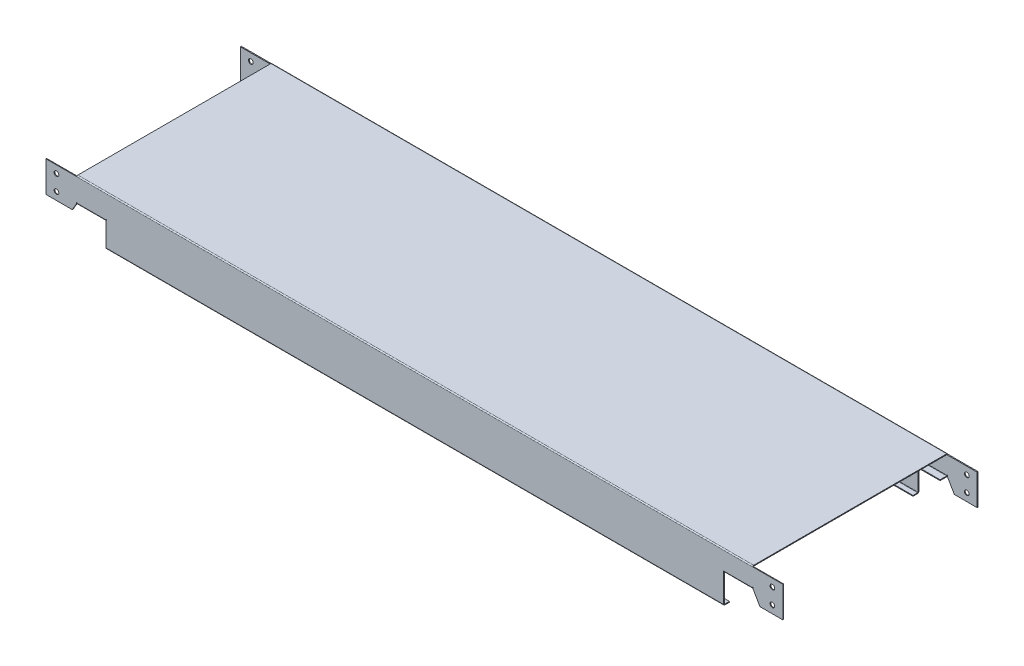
ISO-10303-21;
HEADER;
FILE_DESCRIPTION(('STEP AP214'),'2;1');
FILE_NAME('part.step','',(''),(''),'','','');
FILE_SCHEMA(('AUTOMOTIVE_DESIGN { 1 0 10303 214 1 1 1 1 }'));
ENDSEC;
DATA;
#1=APPLICATION_CONTEXT('core data for automotive mechanical design processes');
#2=APPLICATION_PROTOCOL_DEFINITION('international standard','automotive_design',2000,#1);
#3=PRODUCT_CONTEXT('',#1,'mechanical');
#4=PRODUCT('Part','Part','',(#3));
#5=PRODUCT_RELATED_PRODUCT_CATEGORY('part','',(#4));
#6=PRODUCT_DEFINITION_FORMATION('','',#4);
#7=PRODUCT_DEFINITION_CONTEXT('part definition',#1,'design');
#8=PRODUCT_DEFINITION('design','',#6,#7);
#9=PRODUCT_DEFINITION_SHAPE('','',#8);
#10=(LENGTH_UNIT() NAMED_UNIT(*) SI_UNIT(.MILLI.,.METRE.));
#11=(NAMED_UNIT(*) PLANE_ANGLE_UNIT() SI_UNIT($,.RADIAN.));
#12=(NAMED_UNIT(*) SI_UNIT($,.STERADIAN.) SOLID_ANGLE_UNIT());
#13=UNCERTAINTY_MEASURE_WITH_UNIT(LENGTH_MEASURE(1.E-05),#10,'distance_accuracy_value','');
#14=(GEOMETRIC_REPRESENTATION_CONTEXT(3) GLOBAL_UNCERTAINTY_ASSIGNED_CONTEXT((#13)) GLOBAL_UNIT_ASSIGNED_CONTEXT((#10,
#11,#12)) REPRESENTATION_CONTEXT('',''));
#15=CARTESIAN_POINT('',(0.,0.,0.));
#16=DIRECTION('',(0.,0.,1.));
#17=DIRECTION('',(1.,0.,0.));
#18=AXIS2_PLACEMENT_3D('',#15,#16,#17);
#19=CARTESIAN_POINT('',(950.786847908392,38.84069850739,-2.73659999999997));
#20=DIRECTION('',(1.,0.,0.));
#21=DIRECTION('',(0.,1.,0.));
#22=AXIS2_PLACEMENT_3D('',#19,#20,#21);
#23=CYLINDRICAL_SURFACE('',#22,2.7366);
#24=CARTESIAN_POINT('',(-872.844619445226,38.84069850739,-2.73659999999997));
#25=DIRECTION('',(1.,0.,0.));
#26=DIRECTION('',(0.,1.,0.));
#27=AXIS2_PLACEMENT_3D('',#24,#25,#26);
#28=CIRCLE('',#27,2.7366);
#29=CARTESIAN_POINT('',(-872.844619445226,41.57729850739,-2.73659999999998));
#30=VERTEX_POINT('',#29);
#31=CARTESIAN_POINT('',(-872.844619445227,39.57729850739,-0.100997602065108));
#32=VERTEX_POINT('',#31);
#33=EDGE_CURVE('E11',#30,#32,#28,.T.);
#34=ORIENTED_EDGE('',*,*,#33,.T.);
#35=DIRECTION('',(1.,0.,0.));
#36=VECTOR('',#35,1.);
#37=CARTESIAN_POINT('',(1358.78684790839,39.57729850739,-0.100997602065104));
#38=LINE('',#37,#36);
#39=CARTESIAN_POINT('',(-952.479912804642,39.57729850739,-0.100997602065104));
#40=VERTEX_POINT('',#39);
#41=EDGE_CURVE('E860',#32,#40,#38,.F.);
#42=ORIENTED_EDGE('',*,*,#41,.T.);
#43=CARTESIAN_POINT('',(-952.479912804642,38.84069850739,-2.73659999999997));
#44=DIRECTION('',(1.,0.,0.));
#45=DIRECTION('',(0.,0.,-1.));
#46=AXIS2_PLACEMENT_3D('',#43,#44,#45);
#47=CIRCLE('',#46,2.7366);
#48=CARTESIAN_POINT('',(-952.479912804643,38.84069850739,0.));
#49=VERTEX_POINT('',#48);
#50=EDGE_CURVE('E878',#49,#40,#47,.F.);
#51=ORIENTED_EDGE('',*,*,#50,.F.);
#52=DIRECTION('',(1.,0.,0.));
#53=VECTOR('',#52,1.);
#54=CARTESIAN_POINT('',(950.786847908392,38.84069850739,0.));
#55=LINE('',#54,#53);
#56=CARTESIAN_POINT('',(950.786847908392,38.84069850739,0.));
#57=VERTEX_POINT('',#56);
#58=EDGE_CURVE('E1142',#57,#49,#55,.F.);
#59=ORIENTED_EDGE('',*,*,#58,.F.);
#60=CARTESIAN_POINT('',(950.786847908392,38.84069850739,-2.73659999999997));
#61=DIRECTION('',(1.,0.,0.));
#62=DIRECTION('',(0.,0.,-1.));
#63=AXIS2_PLACEMENT_3D('',#60,#61,#62);
#64=CIRCLE('',#63,2.7366);
#65=CARTESIAN_POINT('',(950.786847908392,39.57729850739,-0.100997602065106));
#66=VERTEX_POINT('',#65);
#67=EDGE_CURVE('E1156',#66,#57,#64,.T.);
#68=ORIENTED_EDGE('',*,*,#67,.F.);
#69=DIRECTION('',(1.,0.,0.));
#70=VECTOR('',#69,1.);
#71=CARTESIAN_POINT('',(-2516.1157682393,39.57729850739,-0.100997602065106));
#72=LINE('',#71,#70);
#73=CARTESIAN_POINT('',(872.844619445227,39.57729850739,-0.100997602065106));
#74=VERTEX_POINT('',#73);
#75=EDGE_CURVE('E1350',#74,#66,#72,.T.);
#76=ORIENTED_EDGE('',*,*,#75,.F.);
#77=CARTESIAN_POINT('',(872.844619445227,38.84069850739,-2.73659999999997));
#78=DIRECTION('',(1.,0.,0.));
#79=DIRECTION('',(0.,0.,-1.));
#80=AXIS2_PLACEMENT_3D('',#77,#78,#79);
#81=CIRCLE('',#80,2.7366);
#82=CARTESIAN_POINT('',(872.844619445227,41.5772985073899,-2.73659999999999));
#83=VERTEX_POINT('',#82);
#84=EDGE_CURVE('E1349',#83,#74,#81,.T.);
#85=ORIENTED_EDGE('',*,*,#84,.F.);
#86=DIRECTION('',(-1.,0.,0.));
#87=VECTOR('',#86,1.);
#88=CARTESIAN_POINT('',(-204.,41.57729850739,-2.73659999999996));
#89=LINE('',#88,#87);
#90=EDGE_CURVE('E1108',#83,#30,#89,.T.);
#91=ORIENTED_EDGE('',*,*,#90,.T.);
#92=EDGE_LOOP('',(#34,#42,#51,#59,#68,#76,#85,#91));
#93=FACE_BOUND('',#92,.T.);
#94=ADVANCED_FACE('F46',(#93),#23,.T.);
#95=CARTESIAN_POINT('',(950.786847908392,38.84069850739,-2.73659999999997));
#96=DIRECTION('',(1.,0.,0.));
#97=DIRECTION('',(0.,1.,0.));
#98=AXIS2_PLACEMENT_3D('',#95,#96,#97);
#99=CYLINDRICAL_SURFACE('',#98,0.736599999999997);
#100=CARTESIAN_POINT('',(-872.844619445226,38.84069850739,-2.73659999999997));
#101=DIRECTION('',(1.,0.,0.));
#102=DIRECTION('',(0.,1.,0.));
#103=AXIS2_PLACEMENT_3D('',#100,#101,#102);
#104=CIRCLE('',#103,0.736599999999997);
#105=CARTESIAN_POINT('',(-872.844619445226,39.57729850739,-2.73659999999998));
#106=VERTEX_POINT('',#105);
#107=CARTESIAN_POINT('',(-872.844619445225,39.0389662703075,-2.02718513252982));
#108=VERTEX_POINT('',#107);
#109=EDGE_CURVE('E55',#106,#108,#104,.T.);
#110=ORIENTED_EDGE('',*,*,#109,.F.);
#111=DIRECTION('',(1.,0.,0.));
#112=VECTOR('',#111,1.);
#113=CARTESIAN_POINT('',(-1360.47991280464,39.57729850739,-2.7366));
#114=LINE('',#113,#112);
#115=CARTESIAN_POINT('',(872.844619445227,39.5772985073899,-2.73659999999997));
#116=VERTEX_POINT('',#115);
#117=EDGE_CURVE('E1356',#106,#116,#114,.T.);
#118=ORIENTED_EDGE('',*,*,#117,.T.);
#119=CARTESIAN_POINT('',(872.844619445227,38.84069850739,-2.73659999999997));
#120=DIRECTION('',(1.,0.,0.));
#121=DIRECTION('',(0.,0.,-1.));
#122=AXIS2_PLACEMENT_3D('',#119,#120,#121);
#123=CIRCLE('',#122,0.736599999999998);
#124=CARTESIAN_POINT('',(872.844619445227,39.0389662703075,-2.02718513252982));
#125=VERTEX_POINT('',#124);
#126=EDGE_CURVE('E1345',#116,#125,#123,.T.);
#127=ORIENTED_EDGE('',*,*,#126,.T.);
#128=DIRECTION('',(1.,0.,0.));
#129=VECTOR('',#128,1.);
#130=CARTESIAN_POINT('',(872.844619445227,39.0389662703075,-2.02718513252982));
#131=LINE('',#130,#129);
#132=CARTESIAN_POINT('',(950.786847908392,39.0389662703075,-2.02718513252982));
#133=VERTEX_POINT('',#132);
#134=EDGE_CURVE('E1330',#125,#133,#131,.T.);
#135=ORIENTED_EDGE('',*,*,#134,.T.);
#136=CARTESIAN_POINT('',(950.786847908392,38.84069850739,-2.73659999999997));
#137=DIRECTION('',(1.,0.,0.));
#138=DIRECTION('',(0.,0.,-1.));
#139=AXIS2_PLACEMENT_3D('',#136,#137,#138);
#140=CIRCLE('',#139,0.736599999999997);
#141=CARTESIAN_POINT('',(950.786847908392,38.84069850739,-1.99999999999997));
#142=VERTEX_POINT('',#141);
#143=EDGE_CURVE('E1326',#133,#142,#140,.T.);
#144=ORIENTED_EDGE('',*,*,#143,.T.);
#145=DIRECTION('',(1.,0.,0.));
#146=VECTOR('',#145,1.);
#147=CARTESIAN_POINT('',(950.786847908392,38.84069850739,-1.99999999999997));
#148=LINE('',#147,#146);
#149=CARTESIAN_POINT('',(-952.479912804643,38.84069850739,-1.99999999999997));
#150=VERTEX_POINT('',#149);
#151=EDGE_CURVE('E1628',#142,#150,#148,.F.);
#152=ORIENTED_EDGE('',*,*,#151,.T.);
#153=CARTESIAN_POINT('',(-952.479912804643,38.84069850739,-2.73659999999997));
#154=DIRECTION('',(1.,0.,0.));
#155=DIRECTION('',(0.,0.,-1.));
#156=AXIS2_PLACEMENT_3D('',#153,#154,#155);
#157=CIRCLE('',#156,0.736599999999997);
#158=CARTESIAN_POINT('',(-952.47991280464,39.0389662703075,-2.02718513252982));
#159=VERTEX_POINT('',#158);
#160=EDGE_CURVE('E874',#150,#159,#157,.F.);
#161=ORIENTED_EDGE('',*,*,#160,.T.);
#162=DIRECTION('',(1.,0.,0.));
#163=VECTOR('',#162,1.);
#164=CARTESIAN_POINT('',(1358.78684790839,39.0389662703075,-2.02718513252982));
#165=LINE('',#164,#163);
#166=EDGE_CURVE('E863',#108,#159,#165,.F.);
#167=ORIENTED_EDGE('',*,*,#166,.F.);
#168=EDGE_LOOP('',(#110,#118,#127,#135,#144,#152,#161,#167));
#169=FACE_BOUND('',#168,.T.);
#170=ADVANCED_FACE('F1698',(#169),#99,.F.);
#171=CARTESIAN_POINT('',(-204.,41.57729850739,1.45392791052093E-13));
#172=DIRECTION('',(0.,-1.,0.));
#173=DIRECTION('',(0.,0.,-1.));
#174=AXIS2_PLACEMENT_3D('',#171,#172,#173);
#175=PLANE('',#174);
#176=DIRECTION('',(-1.,0.,0.));
#177=VECTOR('',#176,1.);
#178=CARTESIAN_POINT('',(-204.,41.5772985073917,-501.2634));
#179=LINE('',#178,#177);
#180=CARTESIAN_POINT('',(872.844619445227,41.5772985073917,-501.2634));
#181=VERTEX_POINT('',#180);
#182=CARTESIAN_POINT('',(-872.844619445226,41.5772985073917,-501.2634));
#183=VERTEX_POINT('',#182);
#184=EDGE_CURVE('E1329',#181,#183,#179,.T.);
#185=ORIENTED_EDGE('',*,*,#184,.T.);
#186=DIRECTION('',(0.,0.,1.));
#187=VECTOR('',#186,1.);
#188=CARTESIAN_POINT('',(-872.844619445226,41.57729850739,2.10665534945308E-13));
#189=LINE('',#188,#187);
#190=EDGE_CURVE('E70',#183,#30,#189,.T.);
#191=ORIENTED_EDGE('',*,*,#190,.T.);
#192=ORIENTED_EDGE('',*,*,#90,.F.);
#193=DIRECTION('',(0.,0.,-1.));
#194=VECTOR('',#193,1.);
#195=CARTESIAN_POINT('',(872.844619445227,41.5772985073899,1.04083408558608E-13));
#196=LINE('',#195,#194);
#197=EDGE_CURVE('E1338',#83,#181,#196,.T.);
#198=ORIENTED_EDGE('',*,*,#197,.T.);
#199=EDGE_LOOP('',(#185,#191,#192,#198));
#200=FACE_BOUND('',#199,.T.);
#201=ADVANCED_FACE('F1728',(#200),#175,.F.);
#202=CARTESIAN_POINT('',(-204.,39.57729850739,1.38409828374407E-13));
#203=DIRECTION('',(0.,-1.,0.));
#204=DIRECTION('',(0.,0.,-1.));
#205=AXIS2_PLACEMENT_3D('',#202,#203,#204);
#206=PLANE('',#205);
#207=ORIENTED_EDGE('',*,*,#117,.F.);
#208=DIRECTION('',(0.,0.,-1.));
#209=VECTOR('',#208,1.);
#210=CARTESIAN_POINT('',(-872.844619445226,39.5772985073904,-126.01390795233));
#211=LINE('',#210,#209);
#212=CARTESIAN_POINT('',(-872.844619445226,39.5772985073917,-501.2634));
#213=VERTEX_POINT('',#212);
#214=EDGE_CURVE('E62',#213,#106,#211,.F.);
#215=ORIENTED_EDGE('',*,*,#214,.F.);
#216=DIRECTION('',(1.,0.,0.));
#217=VECTOR('',#216,1.);
#218=CARTESIAN_POINT('',(-1360.47991280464,39.5772985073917,-501.2634));
#219=LINE('',#218,#217);
#220=CARTESIAN_POINT('',(872.844619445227,39.5772985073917,-501.2634));
#221=VERTEX_POINT('',#220);
#222=EDGE_CURVE('E1341',#213,#221,#219,.T.);
#223=ORIENTED_EDGE('',*,*,#222,.T.);
#224=DIRECTION('',(0.,0.,-1.));
#225=VECTOR('',#224,1.);
#226=CARTESIAN_POINT('',(872.844619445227,39.5772985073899,0.));
#227=LINE('',#226,#225);
#228=EDGE_CURVE('E1314',#116,#221,#227,.T.);
#229=ORIENTED_EDGE('',*,*,#228,.F.);
#230=EDGE_LOOP('',(#207,#215,#223,#229));
#231=FACE_BOUND('',#230,.T.);
#232=ADVANCED_FACE('F1770',(#231),#206,.T.);
#233=CARTESIAN_POINT('',(-204.,0.,-2.));
#234=DIRECTION('',(0.,0.,1.));
#235=DIRECTION('',(1.,0.,0.));
#236=AXIS2_PLACEMENT_3D('',#233,#234,#235);
#237=PLANE('',#236);
#238=CARTESIAN_POINT('',(923.786847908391,19.5806985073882,-2.));
#239=DIRECTION('',(0.,0.,1.));
#240=DIRECTION('',(1.,0.,0.));
#241=AXIS2_PLACEMENT_3D('',#238,#239,#240);
#242=CIRCLE('',#241,5.99999999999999);
#243=CARTESIAN_POINT('',(929.786847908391,19.5806985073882,-2.));
#244=VERTEX_POINT('',#243);
#245=EDGE_CURVE('E3577',#244,#244,#242,.T.);
#246=ORIENTED_EDGE('',*,*,#245,.T.);
#247=EDGE_LOOP('',(#246));
#248=FACE_BOUND('',#247,.T.);
#249=CARTESIAN_POINT('',(923.786847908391,-20.4193014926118,-2.));
#250=DIRECTION('',(0.,0.,1.));
#251=DIRECTION('',(1.,0.,0.));
#252=AXIS2_PLACEMENT_3D('',#249,#250,#251);
#253=CIRCLE('',#252,5.99999999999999);
#254=CARTESIAN_POINT('',(929.786847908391,-20.4193014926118,-2.));
#255=VERTEX_POINT('',#254);
#256=EDGE_CURVE('E3617',#255,#255,#253,.T.);
#257=ORIENTED_EDGE('',*,*,#256,.T.);
#258=EDGE_LOOP('',(#257));
#259=FACE_BOUND('',#258,.T.);
#260=CARTESIAN_POINT('',(-925.479912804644,19.5772985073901,-2.));
#261=DIRECTION('',(0.,0.,1.));
#262=DIRECTION('',(1.,0.,0.));
#263=AXIS2_PLACEMENT_3D('',#260,#261,#262);
#264=CIRCLE('',#263,5.99999999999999);
#265=CARTESIAN_POINT('',(-919.479912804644,19.5772985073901,-2.));
#266=VERTEX_POINT('',#265);
#267=EDGE_CURVE('E618',#266,#266,#264,.T.);
#268=ORIENTED_EDGE('',*,*,#267,.T.);
#269=EDGE_LOOP('',(#268));
#270=FACE_BOUND('',#269,.T.);
#271=CARTESIAN_POINT('',(-925.479912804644,-20.4227014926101,-2.));
#272=DIRECTION('',(0.,0.,1.));
#273=DIRECTION('',(1.,0.,0.));
#274=AXIS2_PLACEMENT_3D('',#271,#272,#273);
#275=CIRCLE('',#274,5.99999999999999);
#276=CARTESIAN_POINT('',(-919.479912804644,-20.4227014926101,-2.));
#277=VERTEX_POINT('',#276);
#278=EDGE_CURVE('E1666',#277,#277,#275,.T.);
#279=ORIENTED_EDGE('',*,*,#278,.T.);
#280=EDGE_LOOP('',(#279));
#281=FACE_BOUND('',#280,.T.);
#282=DIRECTION('',(-1.,0.,0.));
#283=VECTOR('',#282,1.);
#284=CARTESIAN_POINT('',(-1205.84461944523,-82.18610149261,-2.00000000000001));
#285=LINE('',#284,#283);
#286=CARTESIAN_POINT('',(-797.844619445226,-82.18610149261,-2.00000000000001));
#287=VERTEX_POINT('',#286);
#288=CARTESIAN_POINT('',(797.844619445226,-82.18610149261,-2.00000000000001));
#289=VERTEX_POINT('',#288);
#290=EDGE_CURVE('E1301',#287,#289,#285,.F.);
#291=ORIENTED_EDGE('',*,*,#290,.F.);
#292=DIRECTION('',(0.,-1.,0.));
#293=VECTOR('',#292,1.);
#294=CARTESIAN_POINT('',(-797.844619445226,-20.42270149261,-2.));
#295=LINE('',#294,#293);
#296=CARTESIAN_POINT('',(-797.844619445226,-20.42270149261,-2.));
#297=VERTEX_POINT('',#296);
#298=EDGE_CURVE('E1053',#297,#287,#295,.T.);
#299=ORIENTED_EDGE('',*,*,#298,.F.);
#300=DIRECTION('',(-1.,0.,0.));
#301=VECTOR('',#300,1.);
#302=CARTESIAN_POINT('',(-796.844619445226,-20.42270149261,-2.));
#303=LINE('',#302,#301);
#304=CARTESIAN_POINT('',(-796.844619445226,-20.42270149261,-2.));
#305=VERTEX_POINT('',#304);
#306=EDGE_CURVE('E1020',#305,#297,#303,.T.);
#307=ORIENTED_EDGE('',*,*,#306,.F.);
#308=DIRECTION('',(0.,-1.,0.));
#309=VECTOR('',#308,1.);
#310=CARTESIAN_POINT('',(-796.844619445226,-18.68610149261,-2.));
#311=LINE('',#310,#309);
#312=CARTESIAN_POINT('',(-796.844619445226,-18.68610149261,-2.));
#313=VERTEX_POINT('',#312);
#314=EDGE_CURVE('E1015',#313,#305,#311,.T.);
#315=ORIENTED_EDGE('',*,*,#314,.F.);
#316=DIRECTION('',(1.,0.,0.));
#317=VECTOR('',#316,1.);
#318=CARTESIAN_POINT('',(-797.844619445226,-18.68610149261,-2.));
#319=LINE('',#318,#317);
#320=CARTESIAN_POINT('',(-797.844619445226,-18.68610149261,-2.));
#321=VERTEX_POINT('',#320);
#322=EDGE_CURVE('E1010',#321,#313,#319,.T.);
#323=ORIENTED_EDGE('',*,*,#322,.F.);
#324=DIRECTION('',(0.,1.,0.));
#325=VECTOR('',#324,1.);
#326=CARTESIAN_POINT('',(-797.844619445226,-19.68610149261,-2.));
#327=LINE('',#326,#325);
#328=CARTESIAN_POINT('',(-797.844619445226,-19.68610149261,-2.));
#329=VERTEX_POINT('',#328);
#330=EDGE_CURVE('E1006',#329,#321,#327,.T.);
#331=ORIENTED_EDGE('',*,*,#330,.F.);
#332=DIRECTION('',(-1.,0.,0.));
#333=VECTOR('',#332,1.);
#334=CARTESIAN_POINT('',(-872.844619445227,-19.68610149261,-2.));
#335=LINE('',#334,#333);
#336=CARTESIAN_POINT('',(-872.844619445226,-19.68610149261,-2.));
#337=VERTEX_POINT('',#336);
#338=EDGE_CURVE('E976',#337,#329,#335,.F.);
#339=ORIENTED_EDGE('',*,*,#338,.F.);
#340=DIRECTION('',(0.,-1.,0.));
#341=VECTOR('',#340,1.);
#342=CARTESIAN_POINT('',(-872.844619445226,-18.68610149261,-2.));
#343=LINE('',#342,#341);
#344=CARTESIAN_POINT('',(-872.844619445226,-18.68610149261,-2.));
#345=VERTEX_POINT('',#344);
#346=EDGE_CURVE('E1001',#345,#337,#343,.T.);
#347=ORIENTED_EDGE('',*,*,#346,.F.);
#348=DIRECTION('',(1.,0.,0.));
#349=VECTOR('',#348,1.);
#350=CARTESIAN_POINT('',(-873.844619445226,-18.68610149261,-2.));
#351=LINE('',#350,#349);
#352=CARTESIAN_POINT('',(-873.844619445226,-18.68610149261,-2.));
#353=VERTEX_POINT('',#352);
#354=EDGE_CURVE('E996',#353,#345,#351,.T.);
#355=ORIENTED_EDGE('',*,*,#354,.F.);
#356=DIRECTION('',(0.,1.,0.));
#357=VECTOR('',#356,1.);
#358=CARTESIAN_POINT('',(-873.844619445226,-22.1547523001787,-2.));
#359=LINE('',#358,#357);
#360=CARTESIAN_POINT('',(-873.844619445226,-22.1547523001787,-2.));
#361=VERTEX_POINT('',#360);
#362=EDGE_CURVE('E990',#361,#353,#359,.T.);
#363=ORIENTED_EDGE('',*,*,#362,.F.);
#364=DIRECTION('',(0.499999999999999,0.866025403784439,0.));
#365=VECTOR('',#364,1.);
#366=CARTESIAN_POINT('',(-884.391624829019,-40.42270149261,-2.));
#367=LINE('',#366,#365);
#368=CARTESIAN_POINT('',(-884.391624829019,-40.42270149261,-2.));
#369=VERTEX_POINT('',#368);
#370=EDGE_CURVE('E1049',#369,#361,#367,.T.);
#371=ORIENTED_EDGE('',*,*,#370,.F.);
#372=DIRECTION('',(1.,0.,0.));
#373=VECTOR('',#372,1.);
#374=CARTESIAN_POINT('',(-952.479912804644,-40.42270149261,-2.));
#375=LINE('',#374,#373);
#376=CARTESIAN_POINT('',(-952.479912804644,-40.42270149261,-2.));
#377=VERTEX_POINT('',#376);
#378=EDGE_CURVE('E1044',#377,#369,#375,.T.);
#379=ORIENTED_EDGE('',*,*,#378,.F.);
#380=DIRECTION('',(0.,-1.,0.));
#381=VECTOR('',#380,1.);
#382=CARTESIAN_POINT('',(-952.479912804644,39.57729850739,-2.));
#383=LINE('',#382,#381);
#384=EDGE_CURVE('E1041',#150,#377,#383,.T.);
#385=ORIENTED_EDGE('',*,*,#384,.F.);
#386=ORIENTED_EDGE('',*,*,#151,.F.);
#387=DIRECTION('',(0.,1.,0.));
#388=VECTOR('',#387,1.);
#389=CARTESIAN_POINT('',(950.786847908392,39.57729850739,-2.));
#390=LINE('',#389,#388);
#391=CARTESIAN_POINT('',(950.786847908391,-40.421540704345,-2.));
#392=VERTEX_POINT('',#391);
#393=EDGE_CURVE('E1151',#392,#142,#390,.T.);
#394=ORIENTED_EDGE('',*,*,#393,.F.);
#395=DIRECTION('',(1.,0.,0.));
#396=VECTOR('',#395,1.);
#397=CARTESIAN_POINT('',(-204.,-40.421540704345,-2.));
#398=LINE('',#397,#396);
#399=CARTESIAN_POINT('',(891.620050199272,-40.421540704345,-2.));
#400=VERTEX_POINT('',#399);
#401=EDGE_CURVE('E1682',#400,#392,#398,.T.);
#402=ORIENTED_EDGE('',*,*,#401,.F.);
#403=DIRECTION('',(0.5,-0.866025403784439,0.));
#404=VECTOR('',#403,1.);
#405=CARTESIAN_POINT('',(884.391624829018,-27.901540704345,-2.));
#406=LINE('',#405,#404);
#407=CARTESIAN_POINT('',(873.844619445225,-9.63359151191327,-2.));
#408=VERTEX_POINT('',#407);
#409=EDGE_CURVE('E1157',#408,#400,#406,.T.);
#410=ORIENTED_EDGE('',*,*,#409,.F.);
#411=DIRECTION('',(0.,-1.,0.));
#412=VECTOR('',#411,1.);
#413=CARTESIAN_POINT('',(873.844619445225,-6.16494070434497,-2.));
#414=LINE('',#413,#412);
#415=CARTESIAN_POINT('',(873.844619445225,-6.16494070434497,-2.));
#416=VERTEX_POINT('',#415);
#417=EDGE_CURVE('E1195',#416,#408,#414,.T.);
#418=ORIENTED_EDGE('',*,*,#417,.F.);
#419=DIRECTION('',(1.,0.,0.));
#420=VECTOR('',#419,1.);
#421=CARTESIAN_POINT('',(872.844619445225,-6.16494070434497,-2.));
#422=LINE('',#421,#420);
#423=CARTESIAN_POINT('',(872.844619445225,-6.16494070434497,-2.));
#424=VERTEX_POINT('',#423);
#425=EDGE_CURVE('E1189',#424,#416,#422,.T.);
#426=ORIENTED_EDGE('',*,*,#425,.F.);
#427=DIRECTION('',(0.,1.,0.));
#428=VECTOR('',#427,1.);
#429=CARTESIAN_POINT('',(872.844619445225,-7.16494070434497,-2.));
#430=LINE('',#429,#428);
#431=CARTESIAN_POINT('',(872.844619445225,-7.16494070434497,-2.));
#432=VERTEX_POINT('',#431);
#433=EDGE_CURVE('E1190',#432,#424,#430,.T.);
#434=ORIENTED_EDGE('',*,*,#433,.F.);
#435=DIRECTION('',(-1.,0.,0.));
#436=VECTOR('',#435,1.);
#437=CARTESIAN_POINT('',(797.844619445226,-7.16494070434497,-2.));
#438=LINE('',#437,#436);
#439=CARTESIAN_POINT('',(797.844619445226,-7.16494070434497,-2.));
#440=VERTEX_POINT('',#439);
#441=EDGE_CURVE('E1234',#440,#432,#438,.F.);
#442=ORIENTED_EDGE('',*,*,#441,.F.);
#443=DIRECTION('',(0.,-1.,0.));
#444=VECTOR('',#443,1.);
#445=CARTESIAN_POINT('',(797.844619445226,-6.16494070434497,-2.));
#446=LINE('',#445,#444);
#447=CARTESIAN_POINT('',(797.844619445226,-6.16494070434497,-2.));
#448=VERTEX_POINT('',#447);
#449=EDGE_CURVE('E1184',#448,#440,#446,.T.);
#450=ORIENTED_EDGE('',*,*,#449,.F.);
#451=DIRECTION('',(1.,0.,0.));
#452=VECTOR('',#451,1.);
#453=CARTESIAN_POINT('',(796.844619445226,-6.16494070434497,-2.));
#454=LINE('',#453,#452);
#455=CARTESIAN_POINT('',(796.844619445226,-6.16494070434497,-2.));
#456=VERTEX_POINT('',#455);
#457=EDGE_CURVE('E1179',#456,#448,#454,.T.);
#458=ORIENTED_EDGE('',*,*,#457,.F.);
#459=DIRECTION('',(0.,1.,0.));
#460=VECTOR('',#459,1.);
#461=CARTESIAN_POINT('',(796.844619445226,-7.90154070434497,-2.));
#462=LINE('',#461,#460);
#463=CARTESIAN_POINT('',(796.844619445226,-7.90154070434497,-2.));
#464=VERTEX_POINT('',#463);
#465=EDGE_CURVE('E1174',#464,#456,#462,.T.);
#466=ORIENTED_EDGE('',*,*,#465,.F.);
#467=DIRECTION('',(-1.,0.,0.));
#468=VECTOR('',#467,1.);
#469=CARTESIAN_POINT('',(797.844619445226,-7.90154070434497,-2.));
#470=LINE('',#469,#468);
#471=CARTESIAN_POINT('',(797.844619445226,-7.90154070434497,-2.));
#472=VERTEX_POINT('',#471);
#473=EDGE_CURVE('E1136',#472,#464,#470,.T.);
#474=ORIENTED_EDGE('',*,*,#473,.F.);
#475=DIRECTION('',(0.,1.,0.));
#476=VECTOR('',#475,1.);
#477=CARTESIAN_POINT('',(797.844619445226,-7.90154070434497,-2.));
#478=LINE('',#477,#476);
#479=EDGE_CURVE('E1137',#289,#472,#478,.T.);
#480=ORIENTED_EDGE('',*,*,#479,.F.);
#481=EDGE_LOOP('',(#291,#299,#307,#315,#323,#331,#339,#347,#355,#363,#371,#379,#385,#386,#394,
#402,#410,#418,#426,#434,#442,#450,#458,#466,#474,#480));
#482=FACE_BOUND('',#481,.T.);
#483=ADVANCED_FACE('F1711',(#248,#259,#270,#281,#482),#237,.F.);
#484=CARTESIAN_POINT('',(-204.,0.,0.));
#485=DIRECTION('',(0.,0.,1.));
#486=DIRECTION('',(1.,0.,0.));
#487=AXIS2_PLACEMENT_3D('',#484,#485,#486);
#488=PLANE('',#487);
#489=CARTESIAN_POINT('',(923.786847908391,19.5806985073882,0.));
#490=DIRECTION('',(0.,0.,1.));
#491=DIRECTION('',(1.,0.,0.));
#492=AXIS2_PLACEMENT_3D('',#489,#490,#491);
#493=CIRCLE('',#492,5.99999999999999);
#494=CARTESIAN_POINT('',(929.786847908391,19.5806985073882,0.));
#495=VERTEX_POINT('',#494);
#496=EDGE_CURVE('E3574',#495,#495,#493,.T.);
#497=ORIENTED_EDGE('',*,*,#496,.F.);
#498=EDGE_LOOP('',(#497));
#499=FACE_BOUND('',#498,.T.);
#500=CARTESIAN_POINT('',(923.786847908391,-20.4193014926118,0.));
#501=DIRECTION('',(0.,0.,1.));
#502=DIRECTION('',(1.,0.,0.));
#503=AXIS2_PLACEMENT_3D('',#500,#501,#502);
#504=CIRCLE('',#503,5.99999999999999);
#505=CARTESIAN_POINT('',(929.786847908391,-20.4193014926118,0.));
#506=VERTEX_POINT('',#505);
#507=EDGE_CURVE('E3615',#506,#506,#504,.T.);
#508=ORIENTED_EDGE('',*,*,#507,.F.);
#509=EDGE_LOOP('',(#508));
#510=FACE_BOUND('',#509,.T.);
#511=CARTESIAN_POINT('',(-925.479912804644,19.5772985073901,0.));
#512=DIRECTION('',(0.,0.,1.));
#513=DIRECTION('',(1.,0.,0.));
#514=AXIS2_PLACEMENT_3D('',#511,#512,#513);
#515=CIRCLE('',#514,5.99999999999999);
#516=CARTESIAN_POINT('',(-919.479912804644,19.5772985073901,0.));
#517=VERTEX_POINT('',#516);
#518=EDGE_CURVE('E1661',#517,#517,#515,.T.);
#519=ORIENTED_EDGE('',*,*,#518,.F.);
#520=EDGE_LOOP('',(#519));
#521=FACE_BOUND('',#520,.T.);
#522=CARTESIAN_POINT('',(-925.479912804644,-20.4227014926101,0.));
#523=DIRECTION('',(0.,0.,1.));
#524=DIRECTION('',(1.,0.,0.));
#525=AXIS2_PLACEMENT_3D('',#522,#523,#524);
#526=CIRCLE('',#525,5.99999999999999);
#527=CARTESIAN_POINT('',(-919.479912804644,-20.4227014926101,0.));
#528=VERTEX_POINT('',#527);
#529=EDGE_CURVE('E3579',#528,#528,#526,.T.);
#530=ORIENTED_EDGE('',*,*,#529,.F.);
#531=EDGE_LOOP('',(#530));
#532=FACE_BOUND('',#531,.T.);
#533=ORIENTED_EDGE('',*,*,#58,.T.);
#534=DIRECTION('',(0.,-1.,0.));
#535=VECTOR('',#534,1.);
#536=CARTESIAN_POINT('',(-952.479912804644,39.57729850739,0.));
#537=LINE('',#536,#535);
#538=CARTESIAN_POINT('',(-952.479912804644,-40.42270149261,0.));
#539=VERTEX_POINT('',#538);
#540=EDGE_CURVE('E994',#49,#539,#537,.T.);
#541=ORIENTED_EDGE('',*,*,#540,.T.);
#542=DIRECTION('',(1.,0.,0.));
#543=VECTOR('',#542,1.);
#544=CARTESIAN_POINT('',(-952.479912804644,-40.42270149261,0.));
#545=LINE('',#544,#543);
#546=CARTESIAN_POINT('',(-884.391624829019,-40.42270149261,0.));
#547=VERTEX_POINT('',#546);
#548=EDGE_CURVE('E1060',#539,#547,#545,.T.);
#549=ORIENTED_EDGE('',*,*,#548,.T.);
#550=DIRECTION('',(0.499999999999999,0.866025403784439,0.));
#551=VECTOR('',#550,1.);
#552=CARTESIAN_POINT('',(-884.391624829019,-40.42270149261,0.));
#553=LINE('',#552,#551);
#554=CARTESIAN_POINT('',(-873.844619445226,-22.1547523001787,0.));
#555=VERTEX_POINT('',#554);
#556=EDGE_CURVE('E1064',#547,#555,#553,.T.);
#557=ORIENTED_EDGE('',*,*,#556,.T.);
#558=DIRECTION('',(0.,1.,0.));
#559=VECTOR('',#558,1.);
#560=CARTESIAN_POINT('',(-873.844619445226,0.,0.));
#561=LINE('',#560,#559);
#562=CARTESIAN_POINT('',(-873.844619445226,-18.68610149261,0.));
#563=VERTEX_POINT('',#562);
#564=EDGE_CURVE('E1104',#555,#563,#561,.T.);
#565=ORIENTED_EDGE('',*,*,#564,.T.);
#566=DIRECTION('',(1.,0.,0.));
#567=VECTOR('',#566,1.);
#568=CARTESIAN_POINT('',(204.,-18.68610149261,0.));
#569=LINE('',#568,#567);
#570=CARTESIAN_POINT('',(-872.844619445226,-18.68610149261,0.));
#571=VERTEX_POINT('',#570);
#572=EDGE_CURVE('E1100',#563,#571,#569,.T.);
#573=ORIENTED_EDGE('',*,*,#572,.T.);
#574=DIRECTION('',(0.,-1.,0.));
#575=VECTOR('',#574,1.);
#576=CARTESIAN_POINT('',(-872.844619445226,0.,0.));
#577=LINE('',#576,#575);
#578=CARTESIAN_POINT('',(-872.844619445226,-19.68610149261,0.));
#579=VERTEX_POINT('',#578);
#580=EDGE_CURVE('E1096',#571,#579,#577,.T.);
#581=ORIENTED_EDGE('',*,*,#580,.T.);
#582=DIRECTION('',(-1.,0.,0.));
#583=VECTOR('',#582,1.);
#584=CARTESIAN_POINT('',(-872.844619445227,-19.68610149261,0.));
#585=LINE('',#584,#583);
#586=CARTESIAN_POINT('',(-797.844619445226,-19.68610149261,0.));
#587=VERTEX_POINT('',#586);
#588=EDGE_CURVE('E959',#579,#587,#585,.F.);
#589=ORIENTED_EDGE('',*,*,#588,.T.);
#590=DIRECTION('',(0.,1.,0.));
#591=VECTOR('',#590,1.);
#592=CARTESIAN_POINT('',(-797.844619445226,0.,0.));
#593=LINE('',#592,#591);
#594=CARTESIAN_POINT('',(-797.844619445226,-18.68610149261,0.));
#595=VERTEX_POINT('',#594);
#596=EDGE_CURVE('E1092',#587,#595,#593,.T.);
#597=ORIENTED_EDGE('',*,*,#596,.T.);
#598=DIRECTION('',(1.,0.,0.));
#599=VECTOR('',#598,1.);
#600=CARTESIAN_POINT('',(204.,-18.68610149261,0.));
#601=LINE('',#600,#599);
#602=CARTESIAN_POINT('',(-796.844619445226,-18.68610149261,0.));
#603=VERTEX_POINT('',#602);
#604=EDGE_CURVE('E1088',#595,#603,#601,.T.);
#605=ORIENTED_EDGE('',*,*,#604,.T.);
#606=DIRECTION('',(0.,-1.,0.));
#607=VECTOR('',#606,1.);
#608=CARTESIAN_POINT('',(-796.844619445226,0.,0.));
#609=LINE('',#608,#607);
#610=CARTESIAN_POINT('',(-796.844619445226,-20.42270149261,0.));
#611=VERTEX_POINT('',#610);
#612=EDGE_CURVE('E1084',#603,#611,#609,.T.);
#613=ORIENTED_EDGE('',*,*,#612,.T.);
#614=DIRECTION('',(-1.,0.,0.));
#615=VECTOR('',#614,1.);
#616=CARTESIAN_POINT('',(204.,-20.42270149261,0.));
#617=LINE('',#616,#615);
#618=CARTESIAN_POINT('',(-797.844619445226,-20.42270149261,0.));
#619=VERTEX_POINT('',#618);
#620=EDGE_CURVE('E1074',#611,#619,#617,.T.);
#621=ORIENTED_EDGE('',*,*,#620,.T.);
#622=DIRECTION('',(0.,-1.,0.));
#623=VECTOR('',#622,1.);
#624=CARTESIAN_POINT('',(-797.844619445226,-20.42270149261,0.));
#625=LINE('',#624,#623);
#626=CARTESIAN_POINT('',(-797.844619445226,-82.18610149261,0.));
#627=VERTEX_POINT('',#626);
#628=EDGE_CURVE('E1045',#619,#627,#625,.T.);
#629=ORIENTED_EDGE('',*,*,#628,.T.);
#630=DIRECTION('',(-1.,0.,0.));
#631=VECTOR('',#630,1.);
#632=CARTESIAN_POINT('',(-1205.84461944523,-82.18610149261,0.));
#633=LINE('',#632,#631);
#634=CARTESIAN_POINT('',(797.844619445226,-82.18610149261,0.));
#635=VERTEX_POINT('',#634);
#636=EDGE_CURVE('E1150',#627,#635,#633,.F.);
#637=ORIENTED_EDGE('',*,*,#636,.T.);
#638=DIRECTION('',(0.,1.,0.));
#639=VECTOR('',#638,1.);
#640=CARTESIAN_POINT('',(797.844619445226,-7.90154070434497,0.));
#641=LINE('',#640,#639);
#642=CARTESIAN_POINT('',(797.844619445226,-7.90154070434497,0.));
#643=VERTEX_POINT('',#642);
#644=EDGE_CURVE('E1147',#635,#643,#641,.T.);
#645=ORIENTED_EDGE('',*,*,#644,.T.);
#646=DIRECTION('',(-1.,0.,0.));
#647=VECTOR('',#646,1.);
#648=CARTESIAN_POINT('',(-204.,-7.90154070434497,0.));
#649=LINE('',#648,#647);
#650=CARTESIAN_POINT('',(796.844619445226,-7.90154070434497,0.));
#651=VERTEX_POINT('',#650);
#652=EDGE_CURVE('E1114',#643,#651,#649,.T.);
#653=ORIENTED_EDGE('',*,*,#652,.T.);
#654=DIRECTION('',(0.,1.,0.));
#655=VECTOR('',#654,1.);
#656=CARTESIAN_POINT('',(796.844619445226,0.,0.));
#657=LINE('',#656,#655);
#658=CARTESIAN_POINT('',(796.844619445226,-6.16494070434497,0.));
#659=VERTEX_POINT('',#658);
#660=EDGE_CURVE('E1109',#651,#659,#657,.T.);
#661=ORIENTED_EDGE('',*,*,#660,.T.);
#662=DIRECTION('',(1.,0.,0.));
#663=VECTOR('',#662,1.);
#664=CARTESIAN_POINT('',(-204.,-6.16494070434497,0.));
#665=LINE('',#664,#663);
#666=CARTESIAN_POINT('',(797.844619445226,-6.16494070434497,0.));
#667=VERTEX_POINT('',#666);
#668=EDGE_CURVE('E1113',#659,#667,#665,.T.);
#669=ORIENTED_EDGE('',*,*,#668,.T.);
#670=DIRECTION('',(0.,-1.,0.));
#671=VECTOR('',#670,1.);
#672=CARTESIAN_POINT('',(797.844619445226,0.,0.));
#673=LINE('',#672,#671);
#674=CARTESIAN_POINT('',(797.844619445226,-7.16494070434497,0.));
#675=VERTEX_POINT('',#674);
#676=EDGE_CURVE('E1118',#667,#675,#673,.T.);
#677=ORIENTED_EDGE('',*,*,#676,.T.);
#678=DIRECTION('',(-1.,0.,0.));
#679=VECTOR('',#678,1.);
#680=CARTESIAN_POINT('',(797.844619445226,-7.16494070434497,0.));
#681=LINE('',#680,#679);
#682=CARTESIAN_POINT('',(872.844619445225,-7.16494070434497,0.));
#683=VERTEX_POINT('',#682);
#684=EDGE_CURVE('E1122',#675,#683,#681,.F.);
#685=ORIENTED_EDGE('',*,*,#684,.T.);
#686=DIRECTION('',(0.,1.,0.));
#687=VECTOR('',#686,1.);
#688=CARTESIAN_POINT('',(872.844619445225,0.,0.));
#689=LINE('',#688,#687);
#690=CARTESIAN_POINT('',(872.844619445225,-6.16494070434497,0.));
#691=VERTEX_POINT('',#690);
#692=EDGE_CURVE('E1123',#683,#691,#689,.T.);
#693=ORIENTED_EDGE('',*,*,#692,.T.);
#694=DIRECTION('',(1.,0.,0.));
#695=VECTOR('',#694,1.);
#696=CARTESIAN_POINT('',(-204.,-6.16494070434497,0.));
#697=LINE('',#696,#695);
#698=CARTESIAN_POINT('',(873.844619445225,-6.16494070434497,0.));
#699=VERTEX_POINT('',#698);
#700=EDGE_CURVE('E1127',#691,#699,#697,.T.);
#701=ORIENTED_EDGE('',*,*,#700,.T.);
#702=DIRECTION('',(0.,-1.,0.));
#703=VECTOR('',#702,1.);
#704=CARTESIAN_POINT('',(873.844619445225,0.,0.));
#705=LINE('',#704,#703);
#706=CARTESIAN_POINT('',(873.844619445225,-9.63359151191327,0.));
#707=VERTEX_POINT('',#706);
#708=EDGE_CURVE('E1131',#699,#707,#705,.T.);
#709=ORIENTED_EDGE('',*,*,#708,.T.);
#710=DIRECTION('',(0.5,-0.866025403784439,0.));
#711=VECTOR('',#710,1.);
#712=CARTESIAN_POINT('',(884.391624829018,-27.901540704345,0.));
#713=LINE('',#712,#711);
#714=CARTESIAN_POINT('',(891.620050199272,-40.421540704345,0.));
#715=VERTEX_POINT('',#714);
#716=EDGE_CURVE('E1144',#707,#715,#713,.T.);
#717=ORIENTED_EDGE('',*,*,#716,.T.);
#718=DIRECTION('',(1.,0.,0.));
#719=VECTOR('',#718,1.);
#720=CARTESIAN_POINT('',(-204.,-40.421540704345,0.));
#721=LINE('',#720,#719);
#722=CARTESIAN_POINT('',(950.786847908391,-40.421540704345,0.));
#723=VERTEX_POINT('',#722);
#724=EDGE_CURVE('E1143',#715,#723,#721,.T.);
#725=ORIENTED_EDGE('',*,*,#724,.T.);
#726=DIRECTION('',(0.,1.,0.));
#727=VECTOR('',#726,1.);
#728=CARTESIAN_POINT('',(950.786847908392,39.57729850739,0.));
#729=LINE('',#728,#727);
#730=EDGE_CURVE('E1138',#723,#57,#729,.T.);
#731=ORIENTED_EDGE('',*,*,#730,.T.);
#732=EDGE_LOOP('',(#533,#541,#549,#557,#565,#573,#581,#589,#597,#605,#613,#621,#629,#637,#645,
#653,#661,#669,#677,#685,#693,#701,#709,#717,#725,#731));
#733=FACE_BOUND('',#732,.T.);
#734=ADVANCED_FACE('F1720',(#499,#510,#521,#532,#733),#488,.T.);
#735=CARTESIAN_POINT('',(-1205.84461944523,-82.18610149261,-2.73660000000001));
#736=DIRECTION('',(-1.,0.,0.));
#737=DIRECTION('',(0.,-1.,0.));
#738=AXIS2_PLACEMENT_3D('',#735,#736,#737);
#739=CYLINDRICAL_SURFACE('',#738,2.7366);
#740=ORIENTED_EDGE('',*,*,#636,.F.);
#741=CARTESIAN_POINT('',(-797.844619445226,-82.18610149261,-2.73660000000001));
#742=DIRECTION('',(-1.,0.,0.));
#743=DIRECTION('',(0.,0.,1.));
#744=AXIS2_PLACEMENT_3D('',#741,#742,#743);
#745=CIRCLE('',#744,2.7366);
#746=CARTESIAN_POINT('',(-797.844619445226,-84.9227014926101,-2.73660000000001));
#747=VERTEX_POINT('',#746);
#748=EDGE_CURVE('E905',#747,#627,#745,.T.);
#749=ORIENTED_EDGE('',*,*,#748,.F.);
#750=DIRECTION('',(1.,0.,0.));
#751=VECTOR('',#750,1.);
#752=CARTESIAN_POINT('',(-204.,-84.9227014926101,-2.73660000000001));
#753=LINE('',#752,#751);
#754=CARTESIAN_POINT('',(797.844619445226,-84.92270149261,-2.73660000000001));
#755=VERTEX_POINT('',#754);
#756=EDGE_CURVE('E1621',#747,#755,#753,.T.);
#757=ORIENTED_EDGE('',*,*,#756,.T.);
#758=CARTESIAN_POINT('',(797.844619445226,-82.18610149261,-2.73660000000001));
#759=DIRECTION('',(-1.,0.,0.));
#760=DIRECTION('',(0.,0.,1.));
#761=AXIS2_PLACEMENT_3D('',#758,#759,#760);
#762=CIRCLE('',#761,2.7366);
#763=EDGE_CURVE('E1295',#635,#755,#762,.F.);
#764=ORIENTED_EDGE('',*,*,#763,.F.);
#765=EDGE_LOOP('',(#740,#749,#757,#764));
#766=FACE_BOUND('',#765,.T.);
#767=ADVANCED_FACE('F2041',(#766),#739,.T.);
#768=CARTESIAN_POINT('',(-1205.84461944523,-82.18610149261,-2.73660000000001));
#769=DIRECTION('',(-1.,0.,0.));
#770=DIRECTION('',(0.,-1.,0.));
#771=AXIS2_PLACEMENT_3D('',#768,#769,#770);
#772=CYLINDRICAL_SURFACE('',#771,0.736600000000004);
#773=DIRECTION('',(-1.,0.,0.));
#774=VECTOR('',#773,1.);
#775=CARTESIAN_POINT('',(797.844619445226,-82.92270149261,-2.73660000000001));
#776=LINE('',#775,#774);
#777=CARTESIAN_POINT('',(797.844619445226,-82.92270149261,-2.73660000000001));
#778=VERTEX_POINT('',#777);
#779=CARTESIAN_POINT('',(-797.844619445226,-82.92270149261,-2.73660000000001));
#780=VERTEX_POINT('',#779);
#781=EDGE_CURVE('E1616',#778,#780,#776,.T.);
#782=ORIENTED_EDGE('',*,*,#781,.T.);
#783=CARTESIAN_POINT('',(-797.844619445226,-82.18610149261,-2.73660000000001));
#784=DIRECTION('',(-1.,0.,0.));
#785=DIRECTION('',(0.,0.,1.));
#786=AXIS2_PLACEMENT_3D('',#783,#784,#785);
#787=CIRCLE('',#786,0.736600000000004);
#788=EDGE_CURVE('E904',#780,#287,#787,.T.);
#789=ORIENTED_EDGE('',*,*,#788,.T.);
#790=ORIENTED_EDGE('',*,*,#290,.T.);
#791=CARTESIAN_POINT('',(797.844619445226,-82.18610149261,-2.73660000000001));
#792=DIRECTION('',(-1.,0.,0.));
#793=DIRECTION('',(0.,0.,1.));
#794=AXIS2_PLACEMENT_3D('',#791,#792,#793);
#795=CIRCLE('',#794,0.736600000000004);
#796=EDGE_CURVE('E1296',#289,#778,#795,.F.);
#797=ORIENTED_EDGE('',*,*,#796,.T.);
#798=EDGE_LOOP('',(#782,#789,#790,#797));
#799=FACE_BOUND('',#798,.T.);
#800=ADVANCED_FACE('F2037',(#799),#772,.F.);
#801=CARTESIAN_POINT('',(-204.,-84.92270149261,2.7254842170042E-13));
#802=DIRECTION('',(0.,1.,0.));
#803=DIRECTION('',(0.,0.,1.));
#804=AXIS2_PLACEMENT_3D('',#801,#802,#803);
#805=PLANE('',#804);
#806=ORIENTED_EDGE('',*,*,#756,.F.);
#807=DIRECTION('',(0.,0.,-1.));
#808=VECTOR('',#807,1.);
#809=CARTESIAN_POINT('',(-797.844619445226,-84.9227014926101,-15.));
#810=LINE('',#809,#808);
#811=CARTESIAN_POINT('',(-797.844619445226,-84.9227014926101,-15.));
#812=VERTEX_POINT('',#811);
#813=EDGE_CURVE('E894',#747,#812,#810,.T.);
#814=ORIENTED_EDGE('',*,*,#813,.T.);
#815=DIRECTION('',(1.,0.,0.));
#816=VECTOR('',#815,1.);
#817=CARTESIAN_POINT('',(797.844619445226,-84.9227014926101,-15.));
#818=LINE('',#817,#816);
#819=CARTESIAN_POINT('',(797.844619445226,-84.9227014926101,-15.));
#820=VERTEX_POINT('',#819);
#821=EDGE_CURVE('E1300',#812,#820,#818,.T.);
#822=ORIENTED_EDGE('',*,*,#821,.T.);
#823=DIRECTION('',(0.,0.,1.));
#824=VECTOR('',#823,1.);
#825=CARTESIAN_POINT('',(797.844619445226,-84.92270149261,-1.99999999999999));
#826=LINE('',#825,#824);
#827=EDGE_CURVE('E1315',#820,#755,#826,.T.);
#828=ORIENTED_EDGE('',*,*,#827,.T.);
#829=EDGE_LOOP('',(#806,#814,#822,#828));
#830=FACE_BOUND('',#829,.T.);
#831=ADVANCED_FACE('F2033',(#830),#805,.F.);
#832=CARTESIAN_POINT('',(-204.,-82.92270149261,2.65565459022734E-13));
#833=DIRECTION('',(0.,1.,0.));
#834=DIRECTION('',(0.,0.,1.));
#835=AXIS2_PLACEMENT_3D('',#832,#833,#834);
#836=PLANE('',#835);
#837=DIRECTION('',(1.,0.,0.));
#838=VECTOR('',#837,1.);
#839=CARTESIAN_POINT('',(797.844619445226,-82.9227014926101,-15.));
#840=LINE('',#839,#838);
#841=CARTESIAN_POINT('',(-797.844619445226,-82.9227014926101,-15.));
#842=VERTEX_POINT('',#841);
#843=CARTESIAN_POINT('',(797.844619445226,-82.9227014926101,-15.));
#844=VERTEX_POINT('',#843);
#845=EDGE_CURVE('E1319',#842,#844,#840,.T.);
#846=ORIENTED_EDGE('',*,*,#845,.F.);
#847=DIRECTION('',(0.,0.,-1.));
#848=VECTOR('',#847,1.);
#849=CARTESIAN_POINT('',(-797.844619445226,-82.9227014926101,-15.));
#850=LINE('',#849,#848);
#851=EDGE_CURVE('E893',#780,#842,#850,.T.);
#852=ORIENTED_EDGE('',*,*,#851,.F.);
#853=ORIENTED_EDGE('',*,*,#781,.F.);
#854=DIRECTION('',(0.,0.,1.));
#855=VECTOR('',#854,1.);
#856=CARTESIAN_POINT('',(797.844619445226,-82.92270149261,-2.));
#857=LINE('',#856,#855);
#858=EDGE_CURVE('E1310',#844,#778,#857,.T.);
#859=ORIENTED_EDGE('',*,*,#858,.F.);
#860=EDGE_LOOP('',(#846,#852,#853,#859));
#861=FACE_BOUND('',#860,.T.);
#862=ADVANCED_FACE('F2029',(#861),#836,.T.);
#863=CARTESIAN_POINT('',(797.844619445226,-84.9227014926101,-15.));
#864=DIRECTION('',(0.,0.,1.));
#865=DIRECTION('',(0.,-1.,0.));
#866=AXIS2_PLACEMENT_3D('',#863,#864,#865);
#867=PLANE('',#866);
#868=ORIENTED_EDGE('',*,*,#821,.F.);
#869=DIRECTION('',(0.,1.,0.));
#870=VECTOR('',#869,1.);
#871=CARTESIAN_POINT('',(-797.844619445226,-84.9227014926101,-15.));
#872=LINE('',#871,#870);
#873=EDGE_CURVE('E898',#812,#842,#872,.T.);
#874=ORIENTED_EDGE('',*,*,#873,.T.);
#875=ORIENTED_EDGE('',*,*,#845,.T.);
#876=DIRECTION('',(0.,1.,0.));
#877=VECTOR('',#876,1.);
#878=CARTESIAN_POINT('',(797.844619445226,-84.9227014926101,-15.));
#879=LINE('',#878,#877);
#880=EDGE_CURVE('E1306',#820,#844,#879,.T.);
#881=ORIENTED_EDGE('',*,*,#880,.F.);
#882=EDGE_LOOP('',(#868,#874,#875,#881));
#883=FACE_BOUND('',#882,.T.);
#884=ADVANCED_FACE('F2026',(#883),#867,.F.);
#885=CARTESIAN_POINT('',(950.786847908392,38.8406985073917,-501.2634));
#886=DIRECTION('',(1.,0.,0.));
#887=DIRECTION('',(0.,1.,0.));
#888=AXIS2_PLACEMENT_3D('',#885,#886,#887);
#889=CYLINDRICAL_SURFACE('',#888,2.7366);
#890=CARTESIAN_POINT('',(-872.844619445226,38.8406985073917,-501.2634));
#891=DIRECTION('',(1.,0.,0.));
#892=DIRECTION('',(0.,1.,0.));
#893=AXIS2_PLACEMENT_3D('',#890,#891,#892);
#894=CIRCLE('',#893,2.7366);
#895=CARTESIAN_POINT('',(-872.844619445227,39.5772985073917,-503.899002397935));
#896=VERTEX_POINT('',#895);
#897=EDGE_CURVE('E592',#896,#183,#894,.T.);
#898=ORIENTED_EDGE('',*,*,#897,.T.);
#899=ORIENTED_EDGE('',*,*,#184,.F.);
#900=CARTESIAN_POINT('',(872.844619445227,38.8406985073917,-501.2634));
#901=DIRECTION('',(-1.,0.,0.));
#902=DIRECTION('',(0.,0.,1.));
#903=AXIS2_PLACEMENT_3D('',#900,#901,#902);
#904=CIRCLE('',#903,2.7366);
#905=CARTESIAN_POINT('',(872.844619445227,39.5772985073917,-503.899002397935));
#906=VERTEX_POINT('',#905);
#907=EDGE_CURVE('E1599',#181,#906,#904,.T.);
#908=ORIENTED_EDGE('',*,*,#907,.T.);
#909=DIRECTION('',(1.,0.,0.));
#910=VECTOR('',#909,1.);
#911=CARTESIAN_POINT('',(-2516.1157682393,39.5772985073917,-503.899002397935));
#912=LINE('',#911,#910);
#913=CARTESIAN_POINT('',(950.786847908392,39.5772985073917,-503.899002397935));
#914=VERTEX_POINT('',#913);
#915=EDGE_CURVE('E1589',#906,#914,#912,.T.);
#916=ORIENTED_EDGE('',*,*,#915,.T.);
#917=CARTESIAN_POINT('',(950.786847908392,38.8406985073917,-501.2634));
#918=DIRECTION('',(-1.,0.,0.));
#919=DIRECTION('',(0.,0.,1.));
#920=AXIS2_PLACEMENT_3D('',#917,#918,#919);
#921=CIRCLE('',#920,2.7366);
#922=CARTESIAN_POINT('',(950.786847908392,38.8406985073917,-504.));
#923=VERTEX_POINT('',#922);
#924=EDGE_CURVE('E1584',#914,#923,#921,.T.);
#925=ORIENTED_EDGE('',*,*,#924,.T.);
#926=DIRECTION('',(1.,0.,0.));
#927=VECTOR('',#926,1.);
#928=CARTESIAN_POINT('',(950.786847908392,38.8406985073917,-504.));
#929=LINE('',#928,#927);
#930=CARTESIAN_POINT('',(-952.479912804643,38.8406985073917,-504.));
#931=VERTEX_POINT('',#930);
#932=EDGE_CURVE('E1588',#923,#931,#929,.F.);
#933=ORIENTED_EDGE('',*,*,#932,.T.);
#934=CARTESIAN_POINT('',(-952.479912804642,38.8406985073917,-501.2634));
#935=DIRECTION('',(-1.,0.,0.));
#936=DIRECTION('',(0.,0.,1.));
#937=AXIS2_PLACEMENT_3D('',#934,#935,#936);
#938=CIRCLE('',#937,2.7366);
#939=CARTESIAN_POINT('',(-952.479912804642,39.5772985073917,-503.899002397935));
#940=VERTEX_POINT('',#939);
#941=EDGE_CURVE('E616',#931,#940,#938,.F.);
#942=ORIENTED_EDGE('',*,*,#941,.T.);
#943=DIRECTION('',(1.,0.,0.));
#944=VECTOR('',#943,1.);
#945=CARTESIAN_POINT('',(1358.78684790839,39.5772985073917,-503.899002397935));
#946=LINE('',#945,#944);
#947=EDGE_CURVE('E607',#896,#940,#946,.F.);
#948=ORIENTED_EDGE('',*,*,#947,.F.);
#949=EDGE_LOOP('',(#898,#899,#908,#916,#925,#933,#942,#948));
#950=FACE_BOUND('',#949,.T.);
#951=ADVANCED_FACE('F614',(#950),#889,.T.);
#952=CARTESIAN_POINT('',(950.786847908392,38.8406985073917,-501.2634));
#953=DIRECTION('',(1.,0.,0.));
#954=DIRECTION('',(0.,1.,0.));
#955=AXIS2_PLACEMENT_3D('',#952,#953,#954);
#956=CYLINDRICAL_SURFACE('',#955,0.736599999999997);
#957=CARTESIAN_POINT('',(-872.844619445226,38.8406985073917,-501.2634));
#958=DIRECTION('',(1.,0.,0.));
#959=DIRECTION('',(0.,1.,0.));
#960=AXIS2_PLACEMENT_3D('',#957,#958,#959);
#961=CIRCLE('',#960,0.736599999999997);
#962=CARTESIAN_POINT('',(-872.844619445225,39.0389662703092,-501.97281486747));
#963=VERTEX_POINT('',#962);
#964=EDGE_CURVE('E602',#963,#213,#961,.T.);
#965=ORIENTED_EDGE('',*,*,#964,.F.);
#966=DIRECTION('',(1.,0.,0.));
#967=VECTOR('',#966,1.);
#968=CARTESIAN_POINT('',(1358.78684790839,39.0389662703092,-501.97281486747));
#969=LINE('',#968,#967);
#970=CARTESIAN_POINT('',(-952.47991280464,39.0389662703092,-501.97281486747));
#971=VERTEX_POINT('',#970);
#972=EDGE_CURVE('E609',#963,#971,#969,.F.);
#973=ORIENTED_EDGE('',*,*,#972,.T.);
#974=CARTESIAN_POINT('',(-952.479912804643,38.8406985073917,-501.2634));
#975=DIRECTION('',(-1.,0.,0.));
#976=DIRECTION('',(0.,0.,1.));
#977=AXIS2_PLACEMENT_3D('',#974,#975,#976);
#978=CIRCLE('',#977,0.736599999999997);
#979=CARTESIAN_POINT('',(-952.479912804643,38.8406985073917,-502.));
#980=VERTEX_POINT('',#979);
#981=EDGE_CURVE('E630',#980,#971,#978,.F.);
#982=ORIENTED_EDGE('',*,*,#981,.F.);
#983=DIRECTION('',(1.,0.,0.));
#984=VECTOR('',#983,1.);
#985=CARTESIAN_POINT('',(950.786847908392,38.8406985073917,-502.));
#986=LINE('',#985,#984);
#987=CARTESIAN_POINT('',(950.786847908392,38.8406985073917,-502.));
#988=VERTEX_POINT('',#987);
#989=EDGE_CURVE('E1639',#988,#980,#986,.F.);
#990=ORIENTED_EDGE('',*,*,#989,.F.);
#991=CARTESIAN_POINT('',(950.786847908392,38.8406985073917,-501.2634));
#992=DIRECTION('',(-1.,0.,0.));
#993=DIRECTION('',(0.,0.,1.));
#994=AXIS2_PLACEMENT_3D('',#991,#992,#993);
#995=CIRCLE('',#994,0.736599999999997);
#996=CARTESIAN_POINT('',(950.786847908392,39.0389662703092,-501.97281486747));
#997=VERTEX_POINT('',#996);
#998=EDGE_CURVE('E1360',#997,#988,#995,.T.);
#999=ORIENTED_EDGE('',*,*,#998,.F.);
#1000=DIRECTION('',(1.,0.,0.));
#1001=VECTOR('',#1000,1.);
#1002=CARTESIAN_POINT('',(872.844619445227,39.0389662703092,-501.97281486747));
#1003=LINE('',#1002,#1001);
#1004=CARTESIAN_POINT('',(872.844619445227,39.0389662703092,-501.97281486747));
#1005=VERTEX_POINT('',#1004);
#1006=EDGE_CURVE('E1590',#1005,#997,#1003,.T.);
#1007=ORIENTED_EDGE('',*,*,#1006,.F.);
#1008=CARTESIAN_POINT('',(872.844619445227,38.8406985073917,-501.2634));
#1009=DIRECTION('',(-1.,0.,0.));
#1010=DIRECTION('',(0.,0.,1.));
#1011=AXIS2_PLACEMENT_3D('',#1008,#1009,#1010);
#1012=CIRCLE('',#1011,0.736599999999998);
#1013=EDGE_CURVE('E1600',#221,#1005,#1012,.T.);
#1014=ORIENTED_EDGE('',*,*,#1013,.F.);
#1015=ORIENTED_EDGE('',*,*,#222,.F.);
#1016=EDGE_LOOP('',(#965,#973,#982,#990,#999,#1007,#1014,#1015));
#1017=FACE_BOUND('',#1016,.T.);
#1018=ADVANCED_FACE('F1768',(#1017),#956,.F.);
#1019=CARTESIAN_POINT('',(-204.,1.74574066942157E-12,-502.));
#1020=DIRECTION('',(0.,0.,-1.));
#1021=DIRECTION('',(1.,0.,0.));
#1022=AXIS2_PLACEMENT_3D('',#1019,#1020,#1021);
#1023=PLANE('',#1022);
#1024=CARTESIAN_POINT('',(923.786847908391,19.5806985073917,-502.));
#1025=DIRECTION('',(0.,0.,-1.));
#1026=DIRECTION('',(0.,1.,0.));
#1027=AXIS2_PLACEMENT_3D('',#1024,#1025,#1026);
#1028=CIRCLE('',#1027,5.99999999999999);
#1029=CARTESIAN_POINT('',(923.786847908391,25.5806985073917,-502.));
#1030=VERTEX_POINT('',#1029);
#1031=EDGE_CURVE('E3585',#1030,#1030,#1028,.T.);
#1032=ORIENTED_EDGE('',*,*,#1031,.T.);
#1033=EDGE_LOOP('',(#1032));
#1034=FACE_BOUND('',#1033,.T.);
#1035=CARTESIAN_POINT('',(923.786847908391,-20.4193014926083,-502.));
#1036=DIRECTION('',(0.,0.,-1.));
#1037=DIRECTION('',(0.,1.,0.));
#1038=AXIS2_PLACEMENT_3D('',#1035,#1036,#1037);
#1039=CIRCLE('',#1038,5.99999999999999);
#1040=CARTESIAN_POINT('',(923.786847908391,-14.4193014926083,-502.));
#1041=VERTEX_POINT('',#1040);
#1042=EDGE_CURVE('E3618',#1041,#1041,#1039,.T.);
#1043=ORIENTED_EDGE('',*,*,#1042,.T.);
#1044=EDGE_LOOP('',(#1043));
#1045=FACE_BOUND('',#1044,.T.);
#1046=CARTESIAN_POINT('',(-925.479912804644,19.5772985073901,-502.));
#1047=DIRECTION('',(0.,0.,-1.));
#1048=DIRECTION('',(0.,1.,0.));
#1049=AXIS2_PLACEMENT_3D('',#1046,#1047,#1048);
#1050=CIRCLE('',#1049,5.99999999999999);
#1051=CARTESIAN_POINT('',(-925.479912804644,25.57729850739,-502.));
#1052=VERTEX_POINT('',#1051);
#1053=EDGE_CURVE('E626',#1052,#1052,#1050,.T.);
#1054=ORIENTED_EDGE('',*,*,#1053,.T.);
#1055=EDGE_LOOP('',(#1054));
#1056=FACE_BOUND('',#1055,.T.);
#1057=CARTESIAN_POINT('',(-925.479912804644,-20.4227014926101,-502.));
#1058=DIRECTION('',(0.,0.,-1.));
#1059=DIRECTION('',(0.,1.,0.));
#1060=AXIS2_PLACEMENT_3D('',#1057,#1058,#1059);
#1061=CIRCLE('',#1060,5.99999999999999);
#1062=CARTESIAN_POINT('',(-925.479912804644,-14.4227014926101,-502.));
#1063=VERTEX_POINT('',#1062);
#1064=EDGE_CURVE('E1660',#1063,#1063,#1061,.T.);
#1065=ORIENTED_EDGE('',*,*,#1064,.T.);
#1066=EDGE_LOOP('',(#1065));
#1067=FACE_BOUND('',#1066,.T.);
#1068=ORIENTED_EDGE('',*,*,#989,.T.);
#1069=DIRECTION('',(0.,-1.,0.));
#1070=VECTOR('',#1069,1.);
#1071=CARTESIAN_POINT('',(-952.479912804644,39.5772985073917,-502.));
#1072=LINE('',#1071,#1070);
#1073=CARTESIAN_POINT('',(-952.479912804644,-40.4227014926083,-502.000000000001));
#1074=VERTEX_POINT('',#1073);
#1075=EDGE_CURVE('E790',#980,#1074,#1072,.T.);
#1076=ORIENTED_EDGE('',*,*,#1075,.T.);
#1077=DIRECTION('',(1.,0.,0.));
#1078=VECTOR('',#1077,1.);
#1079=CARTESIAN_POINT('',(-952.479912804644,-40.4227014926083,-502.000000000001));
#1080=LINE('',#1079,#1078);
#1081=CARTESIAN_POINT('',(-884.391624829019,-40.4227014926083,-502.000000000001));
#1082=VERTEX_POINT('',#1081);
#1083=EDGE_CURVE('E794',#1074,#1082,#1080,.T.);
#1084=ORIENTED_EDGE('',*,*,#1083,.T.);
#1085=DIRECTION('',(0.499999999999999,0.866025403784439,0.));
#1086=VECTOR('',#1085,1.);
#1087=CARTESIAN_POINT('',(-884.391624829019,-40.4227014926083,-502.000000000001));
#1088=LINE('',#1087,#1086);
#1089=CARTESIAN_POINT('',(-873.844619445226,-22.154752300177,-502.));
#1090=VERTEX_POINT('',#1089);
#1091=EDGE_CURVE('E799',#1082,#1090,#1088,.T.);
#1092=ORIENTED_EDGE('',*,*,#1091,.T.);
#1093=DIRECTION('',(0.,1.,0.));
#1094=VECTOR('',#1093,1.);
#1095=CARTESIAN_POINT('',(-873.844619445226,-22.154752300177,-502.));
#1096=LINE('',#1095,#1094);
#1097=CARTESIAN_POINT('',(-873.844619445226,-18.6861014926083,-502.));
#1098=VERTEX_POINT('',#1097);
#1099=EDGE_CURVE('E744',#1090,#1098,#1096,.T.);
#1100=ORIENTED_EDGE('',*,*,#1099,.T.);
#1101=DIRECTION('',(1.,0.,0.));
#1102=VECTOR('',#1101,1.);
#1103=CARTESIAN_POINT('',(-873.844619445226,-18.6861014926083,-502.));
#1104=LINE('',#1103,#1102);
#1105=CARTESIAN_POINT('',(-872.844619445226,-18.6861014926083,-502.));
#1106=VERTEX_POINT('',#1105);
#1107=EDGE_CURVE('E750',#1098,#1106,#1104,.T.);
#1108=ORIENTED_EDGE('',*,*,#1107,.T.);
#1109=DIRECTION('',(0.,-1.,0.));
#1110=VECTOR('',#1109,1.);
#1111=CARTESIAN_POINT('',(-872.844619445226,-18.6861014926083,-502.));
#1112=LINE('',#1111,#1110);
#1113=CARTESIAN_POINT('',(-872.844619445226,-19.6861014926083,-502.));
#1114=VERTEX_POINT('',#1113);
#1115=EDGE_CURVE('E755',#1106,#1114,#1112,.T.);
#1116=ORIENTED_EDGE('',*,*,#1115,.T.);
#1117=DIRECTION('',(-1.,0.,0.));
#1118=VECTOR('',#1117,1.);
#1119=CARTESIAN_POINT('',(-872.844619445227,-19.6861014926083,-502.));
#1120=LINE('',#1119,#1118);
#1121=CARTESIAN_POINT('',(-797.844619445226,-19.6861014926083,-502.));
#1122=VERTEX_POINT('',#1121);
#1123=EDGE_CURVE('E730',#1114,#1122,#1120,.F.);
#1124=ORIENTED_EDGE('',*,*,#1123,.T.);
#1125=DIRECTION('',(0.,1.,0.));
#1126=VECTOR('',#1125,1.);
#1127=CARTESIAN_POINT('',(-797.844619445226,-19.6861014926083,-502.));
#1128=LINE('',#1127,#1126);
#1129=CARTESIAN_POINT('',(-797.844619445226,-18.6861014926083,-502.));
#1130=VERTEX_POINT('',#1129);
#1131=EDGE_CURVE('E760',#1122,#1130,#1128,.T.);
#1132=ORIENTED_EDGE('',*,*,#1131,.T.);
#1133=DIRECTION('',(1.,0.,0.));
#1134=VECTOR('',#1133,1.);
#1135=CARTESIAN_POINT('',(-797.844619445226,-18.6861014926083,-502.));
#1136=LINE('',#1135,#1134);
#1137=CARTESIAN_POINT('',(-796.844619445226,-18.6861014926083,-502.));
#1138=VERTEX_POINT('',#1137);
#1139=EDGE_CURVE('E764',#1130,#1138,#1136,.T.);
#1140=ORIENTED_EDGE('',*,*,#1139,.T.);
#1141=DIRECTION('',(0.,-1.,0.));
#1142=VECTOR('',#1141,1.);
#1143=CARTESIAN_POINT('',(-796.844619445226,-18.6861014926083,-502.));
#1144=LINE('',#1143,#1142);
#1145=CARTESIAN_POINT('',(-796.844619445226,-20.4227014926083,-502.));
#1146=VERTEX_POINT('',#1145);
#1147=EDGE_CURVE('E769',#1138,#1146,#1144,.T.);
#1148=ORIENTED_EDGE('',*,*,#1147,.T.);
#1149=DIRECTION('',(-1.,0.,0.));
#1150=VECTOR('',#1149,1.);
#1151=CARTESIAN_POINT('',(-796.844619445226,-20.4227014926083,-502.));
#1152=LINE('',#1151,#1150);
#1153=CARTESIAN_POINT('',(-797.844619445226,-20.4227014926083,-502.));
#1154=VERTEX_POINT('',#1153);
#1155=EDGE_CURVE('E774',#1146,#1154,#1152,.T.);
#1156=ORIENTED_EDGE('',*,*,#1155,.T.);
#1157=DIRECTION('',(0.,-1.,0.));
#1158=VECTOR('',#1157,1.);
#1159=CARTESIAN_POINT('',(-797.844619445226,-20.4227014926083,-502.));
#1160=LINE('',#1159,#1158);
#1161=CARTESIAN_POINT('',(-797.844619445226,-82.1861014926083,-502.000000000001));
#1162=VERTEX_POINT('',#1161);
#1163=EDGE_CURVE('E803',#1154,#1162,#1160,.T.);
#1164=ORIENTED_EDGE('',*,*,#1163,.T.);
#1165=DIRECTION('',(-1.,0.,0.));
#1166=VECTOR('',#1165,1.);
#1167=CARTESIAN_POINT('',(-1205.84461944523,-82.1861014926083,-502.000000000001));
#1168=LINE('',#1167,#1166);
#1169=CARTESIAN_POINT('',(797.844619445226,-82.1861014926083,-502.000000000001));
#1170=VERTEX_POINT('',#1169);
#1171=EDGE_CURVE('E1425',#1162,#1170,#1168,.F.);
#1172=ORIENTED_EDGE('',*,*,#1171,.T.);
#1173=DIRECTION('',(0.,1.,0.));
#1174=VECTOR('',#1173,1.);
#1175=CARTESIAN_POINT('',(797.844619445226,-7.90154070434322,-502.));
#1176=LINE('',#1175,#1174);
#1177=CARTESIAN_POINT('',(797.844619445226,-7.90154070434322,-502.));
#1178=VERTEX_POINT('',#1177);
#1179=EDGE_CURVE('E1420',#1170,#1178,#1176,.T.);
#1180=ORIENTED_EDGE('',*,*,#1179,.T.);
#1181=DIRECTION('',(-1.,0.,0.));
#1182=VECTOR('',#1181,1.);
#1183=CARTESIAN_POINT('',(797.844619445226,-7.90154070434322,-502.));
#1184=LINE('',#1183,#1182);
#1185=CARTESIAN_POINT('',(796.844619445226,-7.90154070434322,-502.));
#1186=VERTEX_POINT('',#1185);
#1187=EDGE_CURVE('E1424',#1178,#1186,#1184,.T.);
#1188=ORIENTED_EDGE('',*,*,#1187,.T.);
#1189=DIRECTION('',(0.,1.,0.));
#1190=VECTOR('',#1189,1.);
#1191=CARTESIAN_POINT('',(796.844619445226,-7.90154070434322,-502.));
#1192=LINE('',#1191,#1190);
#1193=CARTESIAN_POINT('',(796.844619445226,-6.16494070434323,-502.));
#1194=VERTEX_POINT('',#1193);
#1195=EDGE_CURVE('E1468',#1186,#1194,#1192,.T.);
#1196=ORIENTED_EDGE('',*,*,#1195,.T.);
#1197=DIRECTION('',(1.,0.,0.));
#1198=VECTOR('',#1197,1.);
#1199=CARTESIAN_POINT('',(796.844619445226,-6.16494070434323,-502.));
#1200=LINE('',#1199,#1198);
#1201=CARTESIAN_POINT('',(797.844619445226,-6.16494070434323,-502.));
#1202=VERTEX_POINT('',#1201);
#1203=EDGE_CURVE('E1464',#1194,#1202,#1200,.T.);
#1204=ORIENTED_EDGE('',*,*,#1203,.T.);
#1205=DIRECTION('',(0.,-1.,0.));
#1206=VECTOR('',#1205,1.);
#1207=CARTESIAN_POINT('',(797.844619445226,-6.16494070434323,-502.));
#1208=LINE('',#1207,#1206);
#1209=CARTESIAN_POINT('',(797.844619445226,-7.16494070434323,-502.));
#1210=VERTEX_POINT('',#1209);
#1211=EDGE_CURVE('E1460',#1202,#1210,#1208,.T.);
#1212=ORIENTED_EDGE('',*,*,#1211,.T.);
#1213=DIRECTION('',(-1.,0.,0.));
#1214=VECTOR('',#1213,1.);
#1215=CARTESIAN_POINT('',(797.844619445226,-7.16494070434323,-502.));
#1216=LINE('',#1215,#1214);
#1217=CARTESIAN_POINT('',(872.844619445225,-7.16494070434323,-502.));
#1218=VERTEX_POINT('',#1217);
#1219=EDGE_CURVE('E1459',#1210,#1218,#1216,.F.);
#1220=ORIENTED_EDGE('',*,*,#1219,.T.);
#1221=DIRECTION('',(0.,1.,0.));
#1222=VECTOR('',#1221,1.);
#1223=CARTESIAN_POINT('',(872.844619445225,-7.16494070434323,-502.));
#1224=LINE('',#1223,#1222);
#1225=CARTESIAN_POINT('',(872.844619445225,-6.16494070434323,-502.));
#1226=VERTEX_POINT('',#1225);
#1227=EDGE_CURVE('E1455',#1218,#1226,#1224,.T.);
#1228=ORIENTED_EDGE('',*,*,#1227,.T.);
#1229=DIRECTION('',(1.,0.,0.));
#1230=VECTOR('',#1229,1.);
#1231=CARTESIAN_POINT('',(872.844619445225,-6.16494070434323,-502.));
#1232=LINE('',#1231,#1230);
#1233=CARTESIAN_POINT('',(873.844619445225,-6.16494070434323,-502.));
#1234=VERTEX_POINT('',#1233);
#1235=EDGE_CURVE('E1451',#1226,#1234,#1232,.T.);
#1236=ORIENTED_EDGE('',*,*,#1235,.T.);
#1237=DIRECTION('',(0.,-1.,0.));
#1238=VECTOR('',#1237,1.);
#1239=CARTESIAN_POINT('',(873.844619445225,-6.16494070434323,-502.));
#1240=LINE('',#1239,#1238);
#1241=CARTESIAN_POINT('',(873.844619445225,-9.63359151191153,-502.));
#1242=VERTEX_POINT('',#1241);
#1243=EDGE_CURVE('E1419',#1234,#1242,#1240,.T.);
#1244=ORIENTED_EDGE('',*,*,#1243,.T.);
#1245=DIRECTION('',(0.5,-0.866025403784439,0.));
#1246=VECTOR('',#1245,1.);
#1247=CARTESIAN_POINT('',(884.391624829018,-27.9015407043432,-502.));
#1248=LINE('',#1247,#1246);
#1249=CARTESIAN_POINT('',(891.620050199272,-40.4215407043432,-502.000000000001));
#1250=VERTEX_POINT('',#1249);
#1251=EDGE_CURVE('E1415',#1242,#1250,#1248,.T.);
#1252=ORIENTED_EDGE('',*,*,#1251,.T.);
#1253=DIRECTION('',(1.,0.,0.));
#1254=VECTOR('',#1253,1.);
#1255=CARTESIAN_POINT('',(950.786847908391,-40.4215407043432,-502.000000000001));
#1256=LINE('',#1255,#1254);
#1257=CARTESIAN_POINT('',(950.786847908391,-40.4215407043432,-502.000000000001));
#1258=VERTEX_POINT('',#1257);
#1259=EDGE_CURVE('E1414',#1250,#1258,#1256,.T.);
#1260=ORIENTED_EDGE('',*,*,#1259,.T.);
#1261=DIRECTION('',(0.,1.,0.));
#1262=VECTOR('',#1261,1.);
#1263=CARTESIAN_POINT('',(950.786847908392,39.5772985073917,-502.));
#1264=LINE('',#1263,#1262);
#1265=EDGE_CURVE('E1410',#1258,#988,#1264,.T.);
#1266=ORIENTED_EDGE('',*,*,#1265,.T.);
#1267=EDGE_LOOP('',(#1068,#1076,#1084,#1092,#1100,#1108,#1116,#1124,#1132,#1140,#1148,#1156,
#1164,#1172,#1180,#1188,#1196,#1204,#1212,#1220,#1228,#1236,#1244,#1252,#1260,#1266));
#1268=FACE_BOUND('',#1267,.T.);
#1269=ADVANCED_FACE('F1980',(#1034,#1045,#1056,#1067,#1268),#1023,.F.);
#1270=CARTESIAN_POINT('',(-204.,1.75970659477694E-12,-504.));
#1271=DIRECTION('',(0.,0.,-1.));
#1272=DIRECTION('',(1.,0.,0.));
#1273=AXIS2_PLACEMENT_3D('',#1270,#1271,#1272);
#1274=PLANE('',#1273);
#1275=CARTESIAN_POINT('',(923.786847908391,19.5806985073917,-504.));
#1276=DIRECTION('',(0.,0.,-1.));
#1277=DIRECTION('',(0.,1.,0.));
#1278=AXIS2_PLACEMENT_3D('',#1275,#1276,#1277);
#1279=CIRCLE('',#1278,5.99999999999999);
#1280=CARTESIAN_POINT('',(923.786847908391,25.5806985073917,-504.));
#1281=VERTEX_POINT('',#1280);
#1282=EDGE_CURVE('E3612',#1281,#1281,#1279,.T.);
#1283=ORIENTED_EDGE('',*,*,#1282,.F.);
#1284=EDGE_LOOP('',(#1283));
#1285=FACE_BOUND('',#1284,.T.);
#1286=CARTESIAN_POINT('',(923.786847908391,-20.4193014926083,-504.));
#1287=DIRECTION('',(0.,0.,-1.));
#1288=DIRECTION('',(0.,1.,0.));
#1289=AXIS2_PLACEMENT_3D('',#1286,#1287,#1288);
#1290=CIRCLE('',#1289,5.99999999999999);
#1291=CARTESIAN_POINT('',(923.786847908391,-14.4193014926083,-504.));
#1292=VERTEX_POINT('',#1291);
#1293=EDGE_CURVE('E3610',#1292,#1292,#1290,.T.);
#1294=ORIENTED_EDGE('',*,*,#1293,.F.);
#1295=EDGE_LOOP('',(#1294));
#1296=FACE_BOUND('',#1295,.T.);
#1297=CARTESIAN_POINT('',(-925.479912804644,19.5772985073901,-504.));
#1298=DIRECTION('',(0.,0.,-1.));
#1299=DIRECTION('',(0.,1.,0.));
#1300=AXIS2_PLACEMENT_3D('',#1297,#1298,#1299);
#1301=CIRCLE('',#1300,5.99999999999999);
#1302=CARTESIAN_POINT('',(-925.479912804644,25.57729850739,-504.));
#1303=VERTEX_POINT('',#1302);
#1304=EDGE_CURVE('E1662',#1303,#1303,#1301,.T.);
#1305=ORIENTED_EDGE('',*,*,#1304,.F.);
#1306=EDGE_LOOP('',(#1305));
#1307=FACE_BOUND('',#1306,.T.);
#1308=CARTESIAN_POINT('',(-925.479912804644,-20.4227014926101,-504.));
#1309=DIRECTION('',(0.,0.,-1.));
#1310=DIRECTION('',(0.,1.,0.));
#1311=AXIS2_PLACEMENT_3D('',#1308,#1309,#1310);
#1312=CIRCLE('',#1311,5.99999999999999);
#1313=CARTESIAN_POINT('',(-925.479912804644,-14.4227014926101,-504.));
#1314=VERTEX_POINT('',#1313);
#1315=EDGE_CURVE('E1656',#1314,#1314,#1312,.T.);
#1316=ORIENTED_EDGE('',*,*,#1315,.F.);
#1317=EDGE_LOOP('',(#1316));
#1318=FACE_BOUND('',#1317,.T.);
#1319=DIRECTION('',(-1.,0.,0.));
#1320=VECTOR('',#1319,1.);
#1321=CARTESIAN_POINT('',(-1205.84461944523,-82.1861014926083,-504.000000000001));
#1322=LINE('',#1321,#1320);
#1323=CARTESIAN_POINT('',(-797.844619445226,-82.1861014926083,-504.000000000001));
#1324=VERTEX_POINT('',#1323);
#1325=CARTESIAN_POINT('',(797.844619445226,-82.1861014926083,-504.000000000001));
#1326=VERTEX_POINT('',#1325);
#1327=EDGE_CURVE('E1413',#1324,#1326,#1322,.F.);
#1328=ORIENTED_EDGE('',*,*,#1327,.F.);
#1329=DIRECTION('',(0.,-1.,0.));
#1330=VECTOR('',#1329,1.);
#1331=CARTESIAN_POINT('',(-797.844619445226,-20.4227014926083,-504.));
#1332=LINE('',#1331,#1330);
#1333=CARTESIAN_POINT('',(-797.844619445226,-20.4227014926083,-504.));
#1334=VERTEX_POINT('',#1333);
#1335=EDGE_CURVE('E795',#1334,#1324,#1332,.T.);
#1336=ORIENTED_EDGE('',*,*,#1335,.F.);
#1337=DIRECTION('',(-1.,0.,0.));
#1338=VECTOR('',#1337,1.);
#1339=CARTESIAN_POINT('',(204.,-20.4227014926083,-504.));
#1340=LINE('',#1339,#1338);
#1341=CARTESIAN_POINT('',(-796.844619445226,-20.4227014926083,-504.));
#1342=VERTEX_POINT('',#1341);
#1343=EDGE_CURVE('E825',#1342,#1334,#1340,.T.);
#1344=ORIENTED_EDGE('',*,*,#1343,.F.);
#1345=DIRECTION('',(0.,-1.,0.));
#1346=VECTOR('',#1345,1.);
#1347=CARTESIAN_POINT('',(-796.844619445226,1.75970659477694E-12,-504.));
#1348=LINE('',#1347,#1346);
#1349=CARTESIAN_POINT('',(-796.844619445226,-18.6861014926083,-504.));
#1350=VERTEX_POINT('',#1349);
#1351=EDGE_CURVE('E834',#1350,#1342,#1348,.T.);
#1352=ORIENTED_EDGE('',*,*,#1351,.F.);
#1353=DIRECTION('',(1.,0.,0.));
#1354=VECTOR('',#1353,1.);
#1355=CARTESIAN_POINT('',(204.,-18.6861014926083,-504.));
#1356=LINE('',#1355,#1354);
#1357=CARTESIAN_POINT('',(-797.844619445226,-18.6861014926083,-504.));
#1358=VERTEX_POINT('',#1357);
#1359=EDGE_CURVE('E838',#1358,#1350,#1356,.T.);
#1360=ORIENTED_EDGE('',*,*,#1359,.F.);
#1361=DIRECTION('',(0.,1.,0.));
#1362=VECTOR('',#1361,1.);
#1363=CARTESIAN_POINT('',(-797.844619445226,1.75970659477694E-12,-504.));
#1364=LINE('',#1363,#1362);
#1365=CARTESIAN_POINT('',(-797.844619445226,-19.6861014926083,-504.));
#1366=VERTEX_POINT('',#1365);
#1367=EDGE_CURVE('E842',#1366,#1358,#1364,.T.);
#1368=ORIENTED_EDGE('',*,*,#1367,.F.);
#1369=DIRECTION('',(-1.,0.,0.));
#1370=VECTOR('',#1369,1.);
#1371=CARTESIAN_POINT('',(-872.844619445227,-19.6861014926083,-504.));
#1372=LINE('',#1371,#1370);
#1373=CARTESIAN_POINT('',(-872.844619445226,-19.6861014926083,-504.));
#1374=VERTEX_POINT('',#1373);
#1375=EDGE_CURVE('E714',#1374,#1366,#1372,.F.);
#1376=ORIENTED_EDGE('',*,*,#1375,.F.);
#1377=DIRECTION('',(0.,-1.,0.));
#1378=VECTOR('',#1377,1.);
#1379=CARTESIAN_POINT('',(-872.844619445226,1.75970659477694E-12,-504.));
#1380=LINE('',#1379,#1378);
#1381=CARTESIAN_POINT('',(-872.844619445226,-18.6861014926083,-504.));
#1382=VERTEX_POINT('',#1381);
#1383=EDGE_CURVE('E846',#1382,#1374,#1380,.T.);
#1384=ORIENTED_EDGE('',*,*,#1383,.F.);
#1385=DIRECTION('',(1.,0.,0.));
#1386=VECTOR('',#1385,1.);
#1387=CARTESIAN_POINT('',(204.,-18.6861014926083,-504.));
#1388=LINE('',#1387,#1386);
#1389=CARTESIAN_POINT('',(-873.844619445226,-18.6861014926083,-504.));
#1390=VERTEX_POINT('',#1389);
#1391=EDGE_CURVE('E850',#1390,#1382,#1388,.T.);
#1392=ORIENTED_EDGE('',*,*,#1391,.F.);
#1393=DIRECTION('',(0.,1.,0.));
#1394=VECTOR('',#1393,1.);
#1395=CARTESIAN_POINT('',(-873.844619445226,1.75970659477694E-12,-504.));
#1396=LINE('',#1395,#1394);
#1397=CARTESIAN_POINT('',(-873.844619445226,-22.154752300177,-504.));
#1398=VERTEX_POINT('',#1397);
#1399=EDGE_CURVE('E854',#1398,#1390,#1396,.T.);
#1400=ORIENTED_EDGE('',*,*,#1399,.F.);
#1401=DIRECTION('',(0.499999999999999,0.866025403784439,0.));
#1402=VECTOR('',#1401,1.);
#1403=CARTESIAN_POINT('',(-884.391624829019,-40.4227014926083,-504.000000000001));
#1404=LINE('',#1403,#1402);
#1405=CARTESIAN_POINT('',(-884.391624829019,-40.4227014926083,-504.000000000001));
#1406=VERTEX_POINT('',#1405);
#1407=EDGE_CURVE('E815',#1406,#1398,#1404,.T.);
#1408=ORIENTED_EDGE('',*,*,#1407,.F.);
#1409=DIRECTION('',(1.,0.,0.));
#1410=VECTOR('',#1409,1.);
#1411=CARTESIAN_POINT('',(-952.479912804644,-40.4227014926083,-504.000000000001));
#1412=LINE('',#1411,#1410);
#1413=CARTESIAN_POINT('',(-952.479912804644,-40.4227014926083,-504.000000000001));
#1414=VERTEX_POINT('',#1413);
#1415=EDGE_CURVE('E811',#1414,#1406,#1412,.T.);
#1416=ORIENTED_EDGE('',*,*,#1415,.F.);
#1417=DIRECTION('',(0.,-1.,0.));
#1418=VECTOR('',#1417,1.);
#1419=CARTESIAN_POINT('',(-952.479912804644,39.5772985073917,-504.));
#1420=LINE('',#1419,#1418);
#1421=EDGE_CURVE('E748',#931,#1414,#1420,.T.);
#1422=ORIENTED_EDGE('',*,*,#1421,.F.);
#1423=ORIENTED_EDGE('',*,*,#932,.F.);
#1424=DIRECTION('',(0.,1.,0.));
#1425=VECTOR('',#1424,1.);
#1426=CARTESIAN_POINT('',(950.786847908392,39.5772985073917,-504.));
#1427=LINE('',#1426,#1425);
#1428=CARTESIAN_POINT('',(950.786847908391,-40.4215407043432,-504.000000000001));
#1429=VERTEX_POINT('',#1428);
#1430=EDGE_CURVE('E1396',#1429,#923,#1427,.T.);
#1431=ORIENTED_EDGE('',*,*,#1430,.F.);
#1432=DIRECTION('',(1.,0.,0.));
#1433=VECTOR('',#1432,1.);
#1434=CARTESIAN_POINT('',(950.786847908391,-40.4215407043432,-504.000000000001));
#1435=LINE('',#1434,#1433);
#1436=CARTESIAN_POINT('',(891.620050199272,-40.4215407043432,-504.000000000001));
#1437=VERTEX_POINT('',#1436);
#1438=EDGE_CURVE('E1447',#1437,#1429,#1435,.T.);
#1439=ORIENTED_EDGE('',*,*,#1438,.F.);
#1440=DIRECTION('',(0.5,-0.866025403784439,0.));
#1441=VECTOR('',#1440,1.);
#1442=CARTESIAN_POINT('',(884.391624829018,-27.9015407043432,-504.));
#1443=LINE('',#1442,#1441);
#1444=CARTESIAN_POINT('',(873.844619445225,-9.63359151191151,-504.));
#1445=VERTEX_POINT('',#1444);
#1446=EDGE_CURVE('E1399',#1445,#1437,#1443,.T.);
#1447=ORIENTED_EDGE('',*,*,#1446,.F.);
#1448=DIRECTION('',(0.,-1.,0.));
#1449=VECTOR('',#1448,1.);
#1450=CARTESIAN_POINT('',(873.844619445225,1.75970659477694E-12,-504.));
#1451=LINE('',#1450,#1449);
#1452=CARTESIAN_POINT('',(873.844619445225,-6.16494070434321,-504.));
#1453=VERTEX_POINT('',#1452);
#1454=EDGE_CURVE('E1426',#1453,#1445,#1451,.T.);
#1455=ORIENTED_EDGE('',*,*,#1454,.F.);
#1456=DIRECTION('',(1.,0.,0.));
#1457=VECTOR('',#1456,1.);
#1458=CARTESIAN_POINT('',(-204.,-6.16494070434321,-504.));
#1459=LINE('',#1458,#1457);
#1460=CARTESIAN_POINT('',(872.844619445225,-6.16494070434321,-504.));
#1461=VERTEX_POINT('',#1460);
#1462=EDGE_CURVE('E1388',#1461,#1453,#1459,.T.);
#1463=ORIENTED_EDGE('',*,*,#1462,.F.);
#1464=DIRECTION('',(0.,1.,0.));
#1465=VECTOR('',#1464,1.);
#1466=CARTESIAN_POINT('',(872.844619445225,1.75970659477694E-12,-504.));
#1467=LINE('',#1466,#1465);
#1468=CARTESIAN_POINT('',(872.844619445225,-7.16494070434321,-504.));
#1469=VERTEX_POINT('',#1468);
#1470=EDGE_CURVE('E1383',#1469,#1461,#1467,.T.);
#1471=ORIENTED_EDGE('',*,*,#1470,.F.);
#1472=DIRECTION('',(-1.,0.,0.));
#1473=VECTOR('',#1472,1.);
#1474=CARTESIAN_POINT('',(797.844619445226,-7.16494070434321,-504.));
#1475=LINE('',#1474,#1473);
#1476=CARTESIAN_POINT('',(797.844619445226,-7.16494070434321,-504.));
#1477=VERTEX_POINT('',#1476);
#1478=EDGE_CURVE('E1478',#1477,#1469,#1475,.F.);
#1479=ORIENTED_EDGE('',*,*,#1478,.F.);
#1480=DIRECTION('',(0.,-1.,0.));
#1481=VECTOR('',#1480,1.);
#1482=CARTESIAN_POINT('',(797.844619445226,1.75970659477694E-12,-504.));
#1483=LINE('',#1482,#1481);
#1484=CARTESIAN_POINT('',(797.844619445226,-6.16494070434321,-504.));
#1485=VERTEX_POINT('',#1484);
#1486=EDGE_CURVE('E1378',#1485,#1477,#1483,.T.);
#1487=ORIENTED_EDGE('',*,*,#1486,.F.);
#1488=DIRECTION('',(1.,0.,0.));
#1489=VECTOR('',#1488,1.);
#1490=CARTESIAN_POINT('',(-204.,-6.16494070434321,-504.));
#1491=LINE('',#1490,#1489);
#1492=CARTESIAN_POINT('',(796.844619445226,-6.16494070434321,-504.));
#1493=VERTEX_POINT('',#1492);
#1494=EDGE_CURVE('E1373',#1493,#1485,#1491,.T.);
#1495=ORIENTED_EDGE('',*,*,#1494,.F.);
#1496=DIRECTION('',(0.,1.,0.));
#1497=VECTOR('',#1496,1.);
#1498=CARTESIAN_POINT('',(796.844619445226,1.75970659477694E-12,-504.));
#1499=LINE('',#1498,#1497);
#1500=CARTESIAN_POINT('',(796.844619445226,-7.90154070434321,-504.));
#1501=VERTEX_POINT('',#1500);
#1502=EDGE_CURVE('E1367',#1501,#1493,#1499,.T.);
#1503=ORIENTED_EDGE('',*,*,#1502,.F.);
#1504=DIRECTION('',(-1.,0.,0.));
#1505=VECTOR('',#1504,1.);
#1506=CARTESIAN_POINT('',(-204.,-7.90154070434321,-504.));
#1507=LINE('',#1506,#1505);
#1508=CARTESIAN_POINT('',(797.844619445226,-7.90154070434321,-504.));
#1509=VERTEX_POINT('',#1508);
#1510=EDGE_CURVE('E1395',#1509,#1501,#1507,.T.);
#1511=ORIENTED_EDGE('',*,*,#1510,.F.);
#1512=DIRECTION('',(0.,1.,0.));
#1513=VECTOR('',#1512,1.);
#1514=CARTESIAN_POINT('',(797.844619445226,-7.90154070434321,-504.));
#1515=LINE('',#1514,#1513);
#1516=EDGE_CURVE('E1405',#1326,#1509,#1515,.T.);
#1517=ORIENTED_EDGE('',*,*,#1516,.F.);
#1518=EDGE_LOOP('',(#1328,#1336,#1344,#1352,#1360,#1368,#1376,#1384,#1392,#1400,#1408,#1416,
#1422,#1423,#1431,#1439,#1447,#1455,#1463,#1471,#1479,#1487,#1495,#1503,#1511,#1517));
#1519=FACE_BOUND('',#1518,.T.);
#1520=ADVANCED_FACE('F1756',(#1285,#1296,#1307,#1318,#1519),#1274,.T.);
#1521=CARTESIAN_POINT('',(-1205.84461944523,-82.1861014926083,-501.263400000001));
#1522=DIRECTION('',(-1.,0.,0.));
#1523=DIRECTION('',(0.,-1.,0.));
#1524=AXIS2_PLACEMENT_3D('',#1521,#1522,#1523);
#1525=CYLINDRICAL_SURFACE('',#1524,2.7366);
#1526=DIRECTION('',(1.,0.,0.));
#1527=VECTOR('',#1526,1.);
#1528=CARTESIAN_POINT('',(-204.,-84.9227014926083,-501.263400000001));
#1529=LINE('',#1528,#1527);
#1530=CARTESIAN_POINT('',(-797.844619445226,-84.9227014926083,-501.263400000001));
#1531=VERTEX_POINT('',#1530);
#1532=CARTESIAN_POINT('',(797.844619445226,-84.9227014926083,-501.263400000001));
#1533=VERTEX_POINT('',#1532);
#1534=EDGE_CURVE('E1559',#1531,#1533,#1529,.T.);
#1535=ORIENTED_EDGE('',*,*,#1534,.F.);
#1536=CARTESIAN_POINT('',(-797.844619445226,-82.1861014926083,-501.263400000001));
#1537=DIRECTION('',(1.,0.,0.));
#1538=DIRECTION('',(0.,0.,-1.));
#1539=AXIS2_PLACEMENT_3D('',#1536,#1537,#1538);
#1540=CIRCLE('',#1539,2.7366);
#1541=EDGE_CURVE('E658',#1531,#1324,#1540,.T.);
#1542=ORIENTED_EDGE('',*,*,#1541,.T.);
#1543=ORIENTED_EDGE('',*,*,#1327,.T.);
#1544=CARTESIAN_POINT('',(797.844619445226,-82.1861014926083,-501.263400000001));
#1545=DIRECTION('',(1.,0.,0.));
#1546=DIRECTION('',(0.,0.,-1.));
#1547=AXIS2_PLACEMENT_3D('',#1544,#1545,#1546);
#1548=CIRCLE('',#1547,2.7366);
#1549=EDGE_CURVE('E1555',#1326,#1533,#1548,.F.);
#1550=ORIENTED_EDGE('',*,*,#1549,.T.);
#1551=EDGE_LOOP('',(#1535,#1542,#1543,#1550));
#1552=FACE_BOUND('',#1551,.T.);
#1553=ADVANCED_FACE('F1921',(#1552),#1525,.T.);
#1554=CARTESIAN_POINT('',(-1205.84461944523,-82.1861014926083,-501.263400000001));
#1555=DIRECTION('',(-1.,0.,0.));
#1556=DIRECTION('',(0.,-1.,0.));
#1557=AXIS2_PLACEMENT_3D('',#1554,#1555,#1556);
#1558=CYLINDRICAL_SURFACE('',#1557,0.736600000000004);
#1559=ORIENTED_EDGE('',*,*,#1171,.F.);
#1560=CARTESIAN_POINT('',(-797.844619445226,-82.1861014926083,-501.263400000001));
#1561=DIRECTION('',(1.,0.,0.));
#1562=DIRECTION('',(0.,0.,-1.));
#1563=AXIS2_PLACEMENT_3D('',#1560,#1561,#1562);
#1564=CIRCLE('',#1563,0.736600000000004);
#1565=CARTESIAN_POINT('',(-797.844619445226,-82.9227014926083,-501.263400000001));
#1566=VERTEX_POINT('',#1565);
#1567=EDGE_CURVE('E657',#1566,#1162,#1564,.T.);
#1568=ORIENTED_EDGE('',*,*,#1567,.F.);
#1569=DIRECTION('',(-1.,0.,0.));
#1570=VECTOR('',#1569,1.);
#1571=CARTESIAN_POINT('',(797.844619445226,-82.9227014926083,-501.263400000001));
#1572=LINE('',#1571,#1570);
#1573=CARTESIAN_POINT('',(797.844619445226,-82.9227014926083,-501.263400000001));
#1574=VERTEX_POINT('',#1573);
#1575=EDGE_CURVE('E1567',#1574,#1566,#1572,.T.);
#1576=ORIENTED_EDGE('',*,*,#1575,.F.);
#1577=CARTESIAN_POINT('',(797.844619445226,-82.1861014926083,-501.263400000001));
#1578=DIRECTION('',(1.,0.,0.));
#1579=DIRECTION('',(0.,0.,-1.));
#1580=AXIS2_PLACEMENT_3D('',#1577,#1578,#1579);
#1581=CIRCLE('',#1580,0.736600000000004);
#1582=EDGE_CURVE('E1550',#1170,#1574,#1581,.F.);
#1583=ORIENTED_EDGE('',*,*,#1582,.F.);
#1584=EDGE_LOOP('',(#1559,#1568,#1576,#1583));
#1585=FACE_BOUND('',#1584,.T.);
#1586=ADVANCED_FACE('F2063',(#1585),#1558,.F.);
#1587=CARTESIAN_POINT('',(-204.,-84.9227014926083,-504.000000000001));
#1588=DIRECTION('',(0.,1.,0.));
#1589=DIRECTION('',(0.,0.,-1.));
#1590=AXIS2_PLACEMENT_3D('',#1587,#1588,#1589);
#1591=PLANE('',#1590);
#1592=DIRECTION('',(1.,0.,0.));
#1593=VECTOR('',#1592,1.);
#1594=CARTESIAN_POINT('',(797.844619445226,-84.9227014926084,-489.000000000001));
#1595=LINE('',#1594,#1593);
#1596=CARTESIAN_POINT('',(-797.844619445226,-84.9227014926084,-489.000000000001));
#1597=VERTEX_POINT('',#1596);
#1598=CARTESIAN_POINT('',(797.844619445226,-84.9227014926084,-489.000000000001));
#1599=VERTEX_POINT('',#1598);
#1600=EDGE_CURVE('E1563',#1597,#1599,#1595,.T.);
#1601=ORIENTED_EDGE('',*,*,#1600,.F.);
#1602=DIRECTION('',(0.,0.,1.));
#1603=VECTOR('',#1602,1.);
#1604=CARTESIAN_POINT('',(-797.844619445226,-84.9227014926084,-489.000000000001));
#1605=LINE('',#1604,#1603);
#1606=EDGE_CURVE('E646',#1531,#1597,#1605,.T.);
#1607=ORIENTED_EDGE('',*,*,#1606,.F.);
#1608=ORIENTED_EDGE('',*,*,#1534,.T.);
#1609=DIRECTION('',(0.,0.,-1.));
#1610=VECTOR('',#1609,1.);
#1611=CARTESIAN_POINT('',(797.844619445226,-84.9227014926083,-502.000000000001));
#1612=LINE('',#1611,#1610);
#1613=EDGE_CURVE('E1554',#1599,#1533,#1612,.T.);
#1614=ORIENTED_EDGE('',*,*,#1613,.F.);
#1615=EDGE_LOOP('',(#1601,#1607,#1608,#1614));
#1616=FACE_BOUND('',#1615,.T.);
#1617=ADVANCED_FACE('F2059',(#1616),#1591,.F.);
#1618=CARTESIAN_POINT('',(-204.,-82.9227014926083,-504.000000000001));
#1619=DIRECTION('',(0.,1.,0.));
#1620=DIRECTION('',(0.,0.,-1.));
#1621=AXIS2_PLACEMENT_3D('',#1618,#1619,#1620);
#1622=PLANE('',#1621);
#1623=ORIENTED_EDGE('',*,*,#1575,.T.);
#1624=DIRECTION('',(0.,0.,1.));
#1625=VECTOR('',#1624,1.);
#1626=CARTESIAN_POINT('',(-797.844619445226,-82.9227014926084,-489.000000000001));
#1627=LINE('',#1626,#1625);
#1628=CARTESIAN_POINT('',(-797.844619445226,-82.9227014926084,-489.000000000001));
#1629=VERTEX_POINT('',#1628);
#1630=EDGE_CURVE('E645',#1566,#1629,#1627,.T.);
#1631=ORIENTED_EDGE('',*,*,#1630,.T.);
#1632=DIRECTION('',(1.,0.,0.));
#1633=VECTOR('',#1632,1.);
#1634=CARTESIAN_POINT('',(797.844619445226,-82.9227014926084,-489.000000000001));
#1635=LINE('',#1634,#1633);
#1636=CARTESIAN_POINT('',(797.844619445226,-82.9227014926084,-489.000000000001));
#1637=VERTEX_POINT('',#1636);
#1638=EDGE_CURVE('E1568',#1629,#1637,#1635,.T.);
#1639=ORIENTED_EDGE('',*,*,#1638,.T.);
#1640=DIRECTION('',(0.,0.,-1.));
#1641=VECTOR('',#1640,1.);
#1642=CARTESIAN_POINT('',(797.844619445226,-82.9227014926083,-502.000000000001));
#1643=LINE('',#1642,#1641);
#1644=EDGE_CURVE('E1564',#1637,#1574,#1643,.T.);
#1645=ORIENTED_EDGE('',*,*,#1644,.T.);
#1646=EDGE_LOOP('',(#1623,#1631,#1639,#1645));
#1647=FACE_BOUND('',#1646,.T.);
#1648=ADVANCED_FACE('F2055',(#1647),#1622,.T.);
#1649=CARTESIAN_POINT('',(797.844619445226,-84.9227014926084,-489.000000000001));
#1650=DIRECTION('',(0.,0.,-1.));
#1651=DIRECTION('',(0.,-1.,0.));
#1652=AXIS2_PLACEMENT_3D('',#1649,#1650,#1651);
#1653=PLANE('',#1652);
#1654=ORIENTED_EDGE('',*,*,#1638,.F.);
#1655=DIRECTION('',(0.,1.,0.));
#1656=VECTOR('',#1655,1.);
#1657=CARTESIAN_POINT('',(-797.844619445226,-84.9227014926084,-489.000000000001));
#1658=LINE('',#1657,#1656);
#1659=EDGE_CURVE('E650',#1597,#1629,#1658,.T.);
#1660=ORIENTED_EDGE('',*,*,#1659,.F.);
#1661=ORIENTED_EDGE('',*,*,#1600,.T.);
#1662=DIRECTION('',(0.,1.,0.));
#1663=VECTOR('',#1662,1.);
#1664=CARTESIAN_POINT('',(797.844619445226,-84.9227014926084,-489.000000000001));
#1665=LINE('',#1664,#1663);
#1666=EDGE_CURVE('E1333',#1599,#1637,#1665,.T.);
#1667=ORIENTED_EDGE('',*,*,#1666,.T.);
#1668=EDGE_LOOP('',(#1654,#1660,#1661,#1667));
#1669=FACE_BOUND('',#1668,.T.);
#1670=ADVANCED_FACE('F2052',(#1669),#1653,.F.);
#1671=CARTESIAN_POINT('',(950.786847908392,38.84069850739,-2.73659999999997));
#1672=DIRECTION('',(-1.,0.,0.));
#1673=DIRECTION('',(0.,0.,1.));
#1674=AXIS2_PLACEMENT_3D('',#1671,#1672,#1673);
#1675=PLANE('',#1674);
#1676=ORIENTED_EDGE('',*,*,#143,.F.);
#1677=DIRECTION('',(0.,-0.269166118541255,-0.963093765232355));
#1678=VECTOR('',#1677,1.);
#1679=CARTESIAN_POINT('',(950.786847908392,39.0389662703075,-2.02718513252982));
#1680=LINE('',#1679,#1678);
#1681=EDGE_CURVE('E1346',#66,#133,#1680,.T.);
#1682=ORIENTED_EDGE('',*,*,#1681,.F.);
#1683=ORIENTED_EDGE('',*,*,#67,.T.);
#1684=DIRECTION('',(0.,0.,1.));
#1685=VECTOR('',#1684,1.);
#1686=CARTESIAN_POINT('',(950.786847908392,38.84069850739,-1.99999999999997));
#1687=LINE('',#1686,#1685);
#1688=EDGE_CURVE('E1155',#142,#57,#1687,.T.);
#1689=ORIENTED_EDGE('',*,*,#1688,.F.);
#1690=EDGE_LOOP('',(#1676,#1682,#1683,#1689));
#1691=FACE_BOUND('',#1690,.T.);
#1692=ADVANCED_FACE('F1781',(#1691),#1675,.F.);
#1693=CARTESIAN_POINT('',(950.786847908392,39.57729850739,-2.));
#1694=DIRECTION('',(1.,0.,0.));
#1695=DIRECTION('',(0.,1.,0.));
#1696=AXIS2_PLACEMENT_3D('',#1693,#1694,#1695);
#1697=PLANE('',#1696);
#1698=ORIENTED_EDGE('',*,*,#393,.T.);
#1699=ORIENTED_EDGE('',*,*,#1688,.T.);
#1700=ORIENTED_EDGE('',*,*,#730,.F.);
#1701=DIRECTION('',(0.,0.,1.));
#1702=VECTOR('',#1701,1.);
#1703=CARTESIAN_POINT('',(950.786847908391,-40.421540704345,-2.));
#1704=LINE('',#1703,#1702);
#1705=EDGE_CURVE('E1163',#392,#723,#1704,.T.);
#1706=ORIENTED_EDGE('',*,*,#1705,.F.);
#1707=EDGE_LOOP('',(#1698,#1699,#1700,#1706));
#1708=FACE_BOUND('',#1707,.T.);
#1709=ADVANCED_FACE('F1783',(#1708),#1697,.T.);
#1710=CARTESIAN_POINT('',(884.391624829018,-27.901540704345,-2.));
#1711=DIRECTION('',(-0.866025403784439,-0.5,0.));
#1712=DIRECTION('',(0.5,-0.866025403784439,0.));
#1713=AXIS2_PLACEMENT_3D('',#1710,#1711,#1712);
#1714=PLANE('',#1713);
#1715=ORIENTED_EDGE('',*,*,#716,.F.);
#1716=DIRECTION('',(0.,0.,1.));
#1717=VECTOR('',#1716,1.);
#1718=CARTESIAN_POINT('',(873.844619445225,-9.63359151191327,-2.));
#1719=LINE('',#1718,#1717);
#1720=EDGE_CURVE('E1196',#408,#707,#1719,.T.);
#1721=ORIENTED_EDGE('',*,*,#1720,.F.);
#1722=ORIENTED_EDGE('',*,*,#409,.T.);
#1723=DIRECTION('',(0.,0.,1.));
#1724=VECTOR('',#1723,1.);
#1725=CARTESIAN_POINT('',(891.620050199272,-40.421540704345,-2.));
#1726=LINE('',#1725,#1724);
#1727=EDGE_CURVE('E1160',#400,#715,#1726,.T.);
#1728=ORIENTED_EDGE('',*,*,#1727,.T.);
#1729=EDGE_LOOP('',(#1715,#1721,#1722,#1728));
#1730=FACE_BOUND('',#1729,.T.);
#1731=ADVANCED_FACE('F1791',(#1730),#1714,.T.);
#1732=CARTESIAN_POINT('',(950.786847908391,-40.421540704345,-2.));
#1733=DIRECTION('',(0.,-1.,0.));
#1734=DIRECTION('',(0.,0.,-1.));
#1735=AXIS2_PLACEMENT_3D('',#1732,#1733,#1734);
#1736=PLANE('',#1735);
#1737=ORIENTED_EDGE('',*,*,#724,.F.);
#1738=ORIENTED_EDGE('',*,*,#1727,.F.);
#1739=ORIENTED_EDGE('',*,*,#401,.T.);
#1740=ORIENTED_EDGE('',*,*,#1705,.T.);
#1741=EDGE_LOOP('',(#1737,#1738,#1739,#1740));
#1742=FACE_BOUND('',#1741,.T.);
#1743=ADVANCED_FACE('F48',(#1742),#1736,.T.);
#1744=CARTESIAN_POINT('',(797.844619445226,-7.90154070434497,-2.));
#1745=DIRECTION('',(1.,0.,0.));
#1746=DIRECTION('',(0.,0.,-1.));
#1747=AXIS2_PLACEMENT_3D('',#1744,#1745,#1746);
#1748=PLANE('',#1747);
#1749=DIRECTION('',(0.,0.,1.));
#1750=VECTOR('',#1749,1.);
#1751=CARTESIAN_POINT('',(797.844619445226,-82.18610149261,-2.00000000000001));
#1752=LINE('',#1751,#1750);
#1753=EDGE_CURVE('E1257',#289,#635,#1752,.T.);
#1754=ORIENTED_EDGE('',*,*,#1753,.F.);
#1755=ORIENTED_EDGE('',*,*,#479,.T.);
#1756=DIRECTION('',(0.,0.,1.));
#1757=VECTOR('',#1756,1.);
#1758=CARTESIAN_POINT('',(797.844619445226,-7.90154070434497,-2.));
#1759=LINE('',#1758,#1757);
#1760=EDGE_CURVE('E1132',#472,#643,#1759,.T.);
#1761=ORIENTED_EDGE('',*,*,#1760,.T.);
#1762=ORIENTED_EDGE('',*,*,#644,.F.);
#1763=EDGE_LOOP('',(#1754,#1755,#1761,#1762));
#1764=FACE_BOUND('',#1763,.T.);
#1765=ADVANCED_FACE('F2157',(#1764),#1748,.T.);
#1766=CARTESIAN_POINT('',(797.844619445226,-7.90154070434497,-2.));
#1767=DIRECTION('',(0.,1.,0.));
#1768=DIRECTION('',(0.,0.,1.));
#1769=AXIS2_PLACEMENT_3D('',#1766,#1767,#1768);
#1770=PLANE('',#1769);
#1771=ORIENTED_EDGE('',*,*,#652,.F.);
#1772=ORIENTED_EDGE('',*,*,#1760,.F.);
#1773=ORIENTED_EDGE('',*,*,#473,.T.);
#1774=DIRECTION('',(0.,0.,1.));
#1775=VECTOR('',#1774,1.);
#1776=CARTESIAN_POINT('',(796.844619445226,-7.90154070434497,-2.));
#1777=LINE('',#1776,#1775);
#1778=EDGE_CURVE('E1170',#464,#651,#1777,.T.);
#1779=ORIENTED_EDGE('',*,*,#1778,.T.);
#1780=EDGE_LOOP('',(#1771,#1772,#1773,#1779));
#1781=FACE_BOUND('',#1780,.T.);
#1782=ADVANCED_FACE('F2162',(#1781),#1770,.T.);
#1783=CARTESIAN_POINT('',(796.844619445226,-7.90154070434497,-2.));
#1784=DIRECTION('',(1.,0.,0.));
#1785=DIRECTION('',(0.,0.,-1.));
#1786=AXIS2_PLACEMENT_3D('',#1783,#1784,#1785);
#1787=PLANE('',#1786);
#1788=ORIENTED_EDGE('',*,*,#660,.F.);
#1789=ORIENTED_EDGE('',*,*,#1778,.F.);
#1790=ORIENTED_EDGE('',*,*,#465,.T.);
#1791=DIRECTION('',(0.,0.,1.));
#1792=VECTOR('',#1791,1.);
#1793=CARTESIAN_POINT('',(796.844619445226,-6.16494070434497,-2.));
#1794=LINE('',#1793,#1792);
#1795=EDGE_CURVE('E1175',#456,#659,#1794,.T.);
#1796=ORIENTED_EDGE('',*,*,#1795,.T.);
#1797=EDGE_LOOP('',(#1788,#1789,#1790,#1796));
#1798=FACE_BOUND('',#1797,.T.);
#1799=ADVANCED_FACE('F2169',(#1798),#1787,.T.);
#1800=CARTESIAN_POINT('',(796.844619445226,-6.16494070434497,-2.));
#1801=DIRECTION('',(0.,-1.,0.));
#1802=DIRECTION('',(0.,0.,-1.));
#1803=AXIS2_PLACEMENT_3D('',#1800,#1801,#1802);
#1804=PLANE('',#1803);
#1805=ORIENTED_EDGE('',*,*,#668,.F.);
#1806=ORIENTED_EDGE('',*,*,#1795,.F.);
#1807=ORIENTED_EDGE('',*,*,#457,.T.);
#1808=DIRECTION('',(0.,0.,1.));
#1809=VECTOR('',#1808,1.);
#1810=CARTESIAN_POINT('',(797.844619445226,-6.16494070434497,-2.));
#1811=LINE('',#1810,#1809);
#1812=EDGE_CURVE('E1180',#448,#667,#1811,.T.);
#1813=ORIENTED_EDGE('',*,*,#1812,.T.);
#1814=EDGE_LOOP('',(#1805,#1806,#1807,#1813));
#1815=FACE_BOUND('',#1814,.T.);
#1816=ADVANCED_FACE('F2176',(#1815),#1804,.T.);
#1817=CARTESIAN_POINT('',(797.844619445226,-6.16494070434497,-2.));
#1818=DIRECTION('',(-1.,0.,0.));
#1819=DIRECTION('',(0.,0.,1.));
#1820=AXIS2_PLACEMENT_3D('',#1817,#1818,#1819);
#1821=PLANE('',#1820);
#1822=ORIENTED_EDGE('',*,*,#676,.F.);
#1823=ORIENTED_EDGE('',*,*,#1812,.F.);
#1824=ORIENTED_EDGE('',*,*,#449,.T.);
#1825=DIRECTION('',(0.,0.,1.));
#1826=VECTOR('',#1825,1.);
#1827=CARTESIAN_POINT('',(797.844619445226,-7.16494070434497,-2.));
#1828=LINE('',#1827,#1826);
#1829=EDGE_CURVE('E1208',#440,#675,#1828,.T.);
#1830=ORIENTED_EDGE('',*,*,#1829,.T.);
#1831=EDGE_LOOP('',(#1822,#1823,#1824,#1830));
#1832=FACE_BOUND('',#1831,.T.);
#1833=ADVANCED_FACE('F2183',(#1832),#1821,.T.);
#1834=CARTESIAN_POINT('',(872.844619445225,-7.16494070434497,-2.));
#1835=DIRECTION('',(1.,0.,0.));
#1836=DIRECTION('',(0.,0.,-1.));
#1837=AXIS2_PLACEMENT_3D('',#1834,#1835,#1836);
#1838=PLANE('',#1837);
#1839=ORIENTED_EDGE('',*,*,#692,.F.);
#1840=DIRECTION('',(0.,0.,1.));
#1841=VECTOR('',#1840,1.);
#1842=CARTESIAN_POINT('',(872.844619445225,-7.16494070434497,-2.));
#1843=LINE('',#1842,#1841);
#1844=EDGE_CURVE('E1199',#432,#683,#1843,.T.);
#1845=ORIENTED_EDGE('',*,*,#1844,.F.);
#1846=ORIENTED_EDGE('',*,*,#433,.T.);
#1847=DIRECTION('',(0.,0.,1.));
#1848=VECTOR('',#1847,1.);
#1849=CARTESIAN_POINT('',(872.844619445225,-6.16494070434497,-2.));
#1850=LINE('',#1849,#1848);
#1851=EDGE_CURVE('E1185',#424,#691,#1850,.T.);
#1852=ORIENTED_EDGE('',*,*,#1851,.T.);
#1853=EDGE_LOOP('',(#1839,#1845,#1846,#1852));
#1854=FACE_BOUND('',#1853,.T.);
#1855=ADVANCED_FACE('F1803',(#1854),#1838,.T.);
#1856=CARTESIAN_POINT('',(872.844619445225,-6.16494070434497,-2.));
#1857=DIRECTION('',(0.,-1.,0.));
#1858=DIRECTION('',(0.,0.,-1.));
#1859=AXIS2_PLACEMENT_3D('',#1856,#1857,#1858);
#1860=PLANE('',#1859);
#1861=ORIENTED_EDGE('',*,*,#700,.F.);
#1862=ORIENTED_EDGE('',*,*,#1851,.F.);
#1863=ORIENTED_EDGE('',*,*,#425,.T.);
#1864=DIRECTION('',(0.,0.,1.));
#1865=VECTOR('',#1864,1.);
#1866=CARTESIAN_POINT('',(873.844619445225,-6.16494070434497,-2.));
#1867=LINE('',#1866,#1865);
#1868=EDGE_CURVE('E1191',#416,#699,#1867,.T.);
#1869=ORIENTED_EDGE('',*,*,#1868,.T.);
#1870=EDGE_LOOP('',(#1861,#1862,#1863,#1869));
#1871=FACE_BOUND('',#1870,.T.);
#1872=ADVANCED_FACE('F1799',(#1871),#1860,.T.);
#1873=CARTESIAN_POINT('',(873.844619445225,-6.16494070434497,-2.));
#1874=DIRECTION('',(-1.,0.,0.));
#1875=DIRECTION('',(0.,0.,1.));
#1876=AXIS2_PLACEMENT_3D('',#1873,#1874,#1875);
#1877=PLANE('',#1876);
#1878=ORIENTED_EDGE('',*,*,#708,.F.);
#1879=ORIENTED_EDGE('',*,*,#1868,.F.);
#1880=ORIENTED_EDGE('',*,*,#417,.T.);
#1881=ORIENTED_EDGE('',*,*,#1720,.T.);
#1882=EDGE_LOOP('',(#1878,#1879,#1880,#1881));
#1883=FACE_BOUND('',#1882,.T.);
#1884=ADVANCED_FACE('F1797',(#1883),#1877,.T.);
#1885=CARTESIAN_POINT('',(872.844619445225,-7.16494070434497,-2.7366));
#1886=DIRECTION('',(1.,0.,0.));
#1887=DIRECTION('',(0.,0.,-1.));
#1888=AXIS2_PLACEMENT_3D('',#1885,#1886,#1887);
#1889=PLANE('',#1888);
#1890=DIRECTION('',(0.,-1.,0.));
#1891=VECTOR('',#1890,1.);
#1892=CARTESIAN_POINT('',(872.844619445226,-7.90154070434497,-2.7366));
#1893=LINE('',#1892,#1891);
#1894=CARTESIAN_POINT('',(872.844619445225,-7.90154070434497,-2.7366));
#1895=VERTEX_POINT('',#1894);
#1896=CARTESIAN_POINT('',(872.844619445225,-9.90154070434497,-2.73659999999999));
#1897=VERTEX_POINT('',#1896);
#1898=EDGE_CURVE('E1264',#1895,#1897,#1893,.T.);
#1899=ORIENTED_EDGE('',*,*,#1898,.F.);
#1900=CARTESIAN_POINT('',(872.844619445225,-7.16494070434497,-2.7366));
#1901=DIRECTION('',(-1.,0.,0.));
#1902=DIRECTION('',(0.,0.,1.));
#1903=AXIS2_PLACEMENT_3D('',#1900,#1901,#1902);
#1904=CIRCLE('',#1903,0.7366);
#1905=EDGE_CURVE('E1237',#432,#1895,#1904,.F.);
#1906=ORIENTED_EDGE('',*,*,#1905,.F.);
#1907=ORIENTED_EDGE('',*,*,#1844,.T.);
#1908=CARTESIAN_POINT('',(872.844619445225,-7.16494070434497,-2.7366));
#1909=DIRECTION('',(-1.,0.,0.));
#1910=DIRECTION('',(0.,0.,1.));
#1911=AXIS2_PLACEMENT_3D('',#1908,#1909,#1910);
#1912=CIRCLE('',#1911,2.7366);
#1913=EDGE_CURVE('E1227',#683,#1897,#1912,.F.);
#1914=ORIENTED_EDGE('',*,*,#1913,.T.);
#1915=EDGE_LOOP('',(#1899,#1906,#1907,#1914));
#1916=FACE_BOUND('',#1915,.T.);
#1917=ADVANCED_FACE('F1813',(#1916),#1889,.T.);
#1918=CARTESIAN_POINT('',(797.844619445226,-7.16494070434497,-2.7366));
#1919=DIRECTION('',(1.,0.,0.));
#1920=DIRECTION('',(0.,0.,-1.));
#1921=AXIS2_PLACEMENT_3D('',#1918,#1919,#1920);
#1922=PLANE('',#1921);
#1923=CARTESIAN_POINT('',(797.844619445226,-7.16494070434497,-2.7366));
#1924=DIRECTION('',(-1.,0.,0.));
#1925=DIRECTION('',(0.,0.,1.));
#1926=AXIS2_PLACEMENT_3D('',#1923,#1924,#1925);
#1927=CIRCLE('',#1926,0.7366);
#1928=CARTESIAN_POINT('',(797.844619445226,-7.90154070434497,-2.7366));
#1929=VERTEX_POINT('',#1928);
#1930=EDGE_CURVE('E1228',#1929,#440,#1927,.T.);
#1931=ORIENTED_EDGE('',*,*,#1930,.F.);
#1932=DIRECTION('',(0.,-1.,0.));
#1933=VECTOR('',#1932,1.);
#1934=CARTESIAN_POINT('',(797.844619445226,-7.90154070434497,-2.7366));
#1935=LINE('',#1934,#1933);
#1936=CARTESIAN_POINT('',(797.844619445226,-9.90154070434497,-2.73659999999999));
#1937=VERTEX_POINT('',#1936);
#1938=EDGE_CURVE('E1246',#1929,#1937,#1935,.T.);
#1939=ORIENTED_EDGE('',*,*,#1938,.T.);
#1940=CARTESIAN_POINT('',(797.844619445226,-7.16494070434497,-2.7366));
#1941=DIRECTION('',(-1.,0.,0.));
#1942=DIRECTION('',(0.,0.,1.));
#1943=AXIS2_PLACEMENT_3D('',#1940,#1941,#1942);
#1944=CIRCLE('',#1943,2.7366);
#1945=EDGE_CURVE('E1242',#1937,#675,#1944,.T.);
#1946=ORIENTED_EDGE('',*,*,#1945,.T.);
#1947=ORIENTED_EDGE('',*,*,#1829,.F.);
#1948=EDGE_LOOP('',(#1931,#1939,#1946,#1947));
#1949=FACE_BOUND('',#1948,.T.);
#1950=ADVANCED_FACE('F1833',(#1949),#1922,.F.);
#1951=CARTESIAN_POINT('',(797.844619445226,-7.16494070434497,-2.7366));
#1952=DIRECTION('',(-1.,0.,0.));
#1953=DIRECTION('',(0.,-1.,0.));
#1954=AXIS2_PLACEMENT_3D('',#1951,#1952,#1953);
#1955=CYLINDRICAL_SURFACE('',#1954,2.7366);
#1956=ORIENTED_EDGE('',*,*,#684,.F.);
#1957=ORIENTED_EDGE('',*,*,#1945,.F.);
#1958=DIRECTION('',(1.,0.,0.));
#1959=VECTOR('',#1958,1.);
#1960=CARTESIAN_POINT('',(-204.,-9.90154070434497,-2.73660000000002));
#1961=LINE('',#1960,#1959);
#1962=EDGE_CURVE('E1238',#1937,#1897,#1961,.T.);
#1963=ORIENTED_EDGE('',*,*,#1962,.T.);
#1964=ORIENTED_EDGE('',*,*,#1913,.F.);
#1965=EDGE_LOOP('',(#1956,#1957,#1963,#1964));
#1966=FACE_BOUND('',#1965,.T.);
#1967=ADVANCED_FACE('F1843',(#1966),#1955,.T.);
#1968=CARTESIAN_POINT('',(797.844619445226,-7.16494070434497,-2.7366));
#1969=DIRECTION('',(-1.,0.,0.));
#1970=DIRECTION('',(0.,-1.,0.));
#1971=AXIS2_PLACEMENT_3D('',#1968,#1969,#1970);
#1972=CYLINDRICAL_SURFACE('',#1971,0.7366);
#1973=ORIENTED_EDGE('',*,*,#441,.T.);
#1974=ORIENTED_EDGE('',*,*,#1905,.T.);
#1975=DIRECTION('',(-1.,0.,0.));
#1976=VECTOR('',#1975,1.);
#1977=CARTESIAN_POINT('',(872.844619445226,-7.90154070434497,-2.7366));
#1978=LINE('',#1977,#1976);
#1979=EDGE_CURVE('E1233',#1895,#1929,#1978,.T.);
#1980=ORIENTED_EDGE('',*,*,#1979,.T.);
#1981=ORIENTED_EDGE('',*,*,#1930,.T.);
#1982=EDGE_LOOP('',(#1973,#1974,#1980,#1981));
#1983=FACE_BOUND('',#1982,.T.);
#1984=ADVANCED_FACE('F1809',(#1983),#1972,.F.);
#1985=CARTESIAN_POINT('',(797.844619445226,-9.90154070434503,-20.));
#1986=DIRECTION('',(1.,0.,0.));
#1987=DIRECTION('',(0.,0.,-1.));
#1988=AXIS2_PLACEMENT_3D('',#1985,#1986,#1987);
#1989=PLANE('',#1988);
#1990=ORIENTED_EDGE('',*,*,#1938,.F.);
#1991=DIRECTION('',(0.,0.,-1.));
#1992=VECTOR('',#1991,1.);
#1993=CARTESIAN_POINT('',(797.844619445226,-7.90154070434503,-20.));
#1994=LINE('',#1993,#1992);
#1995=CARTESIAN_POINT('',(797.844619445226,-7.90154070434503,-20.));
#1996=VERTEX_POINT('',#1995);
#1997=EDGE_CURVE('E1232',#1929,#1996,#1994,.T.);
#1998=ORIENTED_EDGE('',*,*,#1997,.T.);
#1999=DIRECTION('',(0.,1.,0.));
#2000=VECTOR('',#1999,1.);
#2001=CARTESIAN_POINT('',(797.844619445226,-9.90154070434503,-20.));
#2002=LINE('',#2001,#2000);
#2003=CARTESIAN_POINT('',(797.844619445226,-9.90154070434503,-20.));
#2004=VERTEX_POINT('',#2003);
#2005=EDGE_CURVE('E1253',#2004,#1996,#2002,.T.);
#2006=ORIENTED_EDGE('',*,*,#2005,.F.);
#2007=DIRECTION('',(0.,0.,-1.));
#2008=VECTOR('',#2007,1.);
#2009=CARTESIAN_POINT('',(797.844619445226,-9.90154070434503,-20.));
#2010=LINE('',#2009,#2008);
#2011=EDGE_CURVE('E1268',#1937,#2004,#2010,.T.);
#2012=ORIENTED_EDGE('',*,*,#2011,.F.);
#2013=EDGE_LOOP('',(#1990,#1998,#2006,#2012));
#2014=FACE_BOUND('',#2013,.T.);
#2015=ADVANCED_FACE('F1835',(#2014),#1989,.F.);
#2016=CARTESIAN_POINT('',(872.844619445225,-9.90154070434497,-1.99999999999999));
#2017=DIRECTION('',(-1.,0.,0.));
#2018=DIRECTION('',(0.,0.,1.));
#2019=AXIS2_PLACEMENT_3D('',#2016,#2017,#2018);
#2020=PLANE('',#2019);
#2021=ORIENTED_EDGE('',*,*,#1898,.T.);
#2022=DIRECTION('',(0.,0.,1.));
#2023=VECTOR('',#2022,1.);
#2024=CARTESIAN_POINT('',(872.844619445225,-9.90154070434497,-1.99999999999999));
#2025=LINE('',#2024,#2023);
#2026=CARTESIAN_POINT('',(872.844619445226,-9.90154070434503,-20.));
#2027=VERTEX_POINT('',#2026);
#2028=EDGE_CURVE('E1271',#2027,#1897,#2025,.T.);
#2029=ORIENTED_EDGE('',*,*,#2028,.F.);
#2030=DIRECTION('',(0.,1.,0.));
#2031=VECTOR('',#2030,1.);
#2032=CARTESIAN_POINT('',(872.844619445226,-9.90154070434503,-20.));
#2033=LINE('',#2032,#2031);
#2034=CARTESIAN_POINT('',(872.844619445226,-7.90154070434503,-20.));
#2035=VERTEX_POINT('',#2034);
#2036=EDGE_CURVE('E1259',#2027,#2035,#2033,.T.);
#2037=ORIENTED_EDGE('',*,*,#2036,.T.);
#2038=DIRECTION('',(0.,0.,1.));
#2039=VECTOR('',#2038,1.);
#2040=CARTESIAN_POINT('',(872.844619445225,-7.90154070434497,-2.));
#2041=LINE('',#2040,#2039);
#2042=EDGE_CURVE('E1263',#2035,#1895,#2041,.T.);
#2043=ORIENTED_EDGE('',*,*,#2042,.T.);
#2044=EDGE_LOOP('',(#2021,#2029,#2037,#2043));
#2045=FACE_BOUND('',#2044,.T.);
#2046=ADVANCED_FACE('F1816',(#2045),#2020,.F.);
#2047=CARTESIAN_POINT('',(-204.,-9.90154070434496,0.));
#2048=DIRECTION('',(0.,1.,0.));
#2049=DIRECTION('',(0.,0.,1.));
#2050=AXIS2_PLACEMENT_3D('',#2047,#2048,#2049);
#2051=PLANE('',#2050);
#2052=ORIENTED_EDGE('',*,*,#1962,.F.);
#2053=ORIENTED_EDGE('',*,*,#2011,.T.);
#2054=DIRECTION('',(1.,0.,0.));
#2055=VECTOR('',#2054,1.);
#2056=CARTESIAN_POINT('',(872.844619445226,-9.90154070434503,-20.));
#2057=LINE('',#2056,#2055);
#2058=EDGE_CURVE('E1277',#2004,#2027,#2057,.T.);
#2059=ORIENTED_EDGE('',*,*,#2058,.T.);
#2060=ORIENTED_EDGE('',*,*,#2028,.T.);
#2061=EDGE_LOOP('',(#2052,#2053,#2059,#2060));
#2062=FACE_BOUND('',#2061,.T.);
#2063=ADVANCED_FACE('F1820',(#2062),#2051,.F.);
#2064=CARTESIAN_POINT('',(-204.,-7.90154070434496,0.));
#2065=DIRECTION('',(0.,1.,0.));
#2066=DIRECTION('',(0.,0.,1.));
#2067=AXIS2_PLACEMENT_3D('',#2064,#2065,#2066);
#2068=PLANE('',#2067);
#2069=ORIENTED_EDGE('',*,*,#1997,.F.);
#2070=ORIENTED_EDGE('',*,*,#1979,.F.);
#2071=ORIENTED_EDGE('',*,*,#2042,.F.);
#2072=DIRECTION('',(1.,0.,0.));
#2073=VECTOR('',#2072,1.);
#2074=CARTESIAN_POINT('',(872.844619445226,-7.90154070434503,-20.));
#2075=LINE('',#2074,#2073);
#2076=EDGE_CURVE('E1258',#1996,#2035,#2075,.T.);
#2077=ORIENTED_EDGE('',*,*,#2076,.F.);
#2078=EDGE_LOOP('',(#2069,#2070,#2071,#2077));
#2079=FACE_BOUND('',#2078,.T.);
#2080=ADVANCED_FACE('F1830',(#2079),#2068,.T.);
#2081=CARTESIAN_POINT('',(872.844619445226,-9.90154070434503,-20.));
#2082=DIRECTION('',(0.,0.,1.));
#2083=DIRECTION('',(0.,-1.,0.));
#2084=AXIS2_PLACEMENT_3D('',#2081,#2082,#2083);
#2085=PLANE('',#2084);
#2086=ORIENTED_EDGE('',*,*,#2076,.T.);
#2087=ORIENTED_EDGE('',*,*,#2036,.F.);
#2088=ORIENTED_EDGE('',*,*,#2058,.F.);
#2089=ORIENTED_EDGE('',*,*,#2005,.T.);
#2090=EDGE_LOOP('',(#2086,#2087,#2088,#2089));
#2091=FACE_BOUND('',#2090,.T.);
#2092=ADVANCED_FACE('F1826',(#2091),#2085,.F.);
#2093=CARTESIAN_POINT('',(797.844619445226,-82.18610149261,-2.73660000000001));
#2094=DIRECTION('',(1.,0.,0.));
#2095=DIRECTION('',(0.,0.,-1.));
#2096=AXIS2_PLACEMENT_3D('',#2093,#2094,#2095);
#2097=PLANE('',#2096);
#2098=DIRECTION('',(0.,-1.,0.));
#2099=VECTOR('',#2098,1.);
#2100=CARTESIAN_POINT('',(797.844619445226,-82.92270149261,-2.73660000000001));
#2101=LINE('',#2100,#2099);
#2102=EDGE_CURVE('E1305',#778,#755,#2101,.T.);
#2103=ORIENTED_EDGE('',*,*,#2102,.F.);
#2104=ORIENTED_EDGE('',*,*,#796,.F.);
#2105=ORIENTED_EDGE('',*,*,#1753,.T.);
#2106=ORIENTED_EDGE('',*,*,#763,.T.);
#2107=EDGE_LOOP('',(#2103,#2104,#2105,#2106));
#2108=FACE_BOUND('',#2107,.T.);
#2109=ADVANCED_FACE('F2256',(#2108),#2097,.T.);
#2110=CARTESIAN_POINT('',(797.844619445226,-84.92270149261,-1.99999999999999));
#2111=DIRECTION('',(-1.,0.,0.));
#2112=DIRECTION('',(0.,0.,1.));
#2113=AXIS2_PLACEMENT_3D('',#2110,#2111,#2112);
#2114=PLANE('',#2113);
#2115=ORIENTED_EDGE('',*,*,#2102,.T.);
#2116=ORIENTED_EDGE('',*,*,#827,.F.);
#2117=ORIENTED_EDGE('',*,*,#880,.T.);
#2118=ORIENTED_EDGE('',*,*,#858,.T.);
#2119=EDGE_LOOP('',(#2115,#2116,#2117,#2118));
#2120=FACE_BOUND('',#2119,.T.);
#2121=ADVANCED_FACE('F2262',(#2120),#2114,.F.);
#2122=CARTESIAN_POINT('',(872.844619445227,41.5772985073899,1.04083408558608E-13));
#2123=DIRECTION('',(-1.,0.,0.));
#2124=DIRECTION('',(0.,0.,-1.));
#2125=AXIS2_PLACEMENT_3D('',#2122,#2123,#2124);
#2126=PLANE('',#2125);
#2127=ORIENTED_EDGE('',*,*,#228,.T.);
#2128=DIRECTION('',(0.,-1.,0.));
#2129=VECTOR('',#2128,1.);
#2130=CARTESIAN_POINT('',(872.844619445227,41.5772985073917,-501.2634));
#2131=LINE('',#2130,#2129);
#2132=EDGE_CURVE('E1593',#181,#221,#2131,.T.);
#2133=ORIENTED_EDGE('',*,*,#2132,.F.);
#2134=ORIENTED_EDGE('',*,*,#197,.F.);
#2135=DIRECTION('',(0.,-1.,0.));
#2136=VECTOR('',#2135,1.);
#2137=CARTESIAN_POINT('',(872.844619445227,41.5772985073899,-2.73659999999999));
#2138=LINE('',#2137,#2136);
#2139=EDGE_CURVE('E1337',#83,#116,#2138,.T.);
#2140=ORIENTED_EDGE('',*,*,#2139,.T.);
#2141=EDGE_LOOP('',(#2127,#2133,#2134,#2140));
#2142=FACE_BOUND('',#2141,.T.);
#2143=ADVANCED_FACE('F1733',(#2142),#2126,.F.);
#2144=CARTESIAN_POINT('',(911.815733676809,39.0389662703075,-2.02718513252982));
#2145=DIRECTION('',(0.,-0.963093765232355,0.269166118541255));
#2146=DIRECTION('',(1.,0.,0.));
#2147=AXIS2_PLACEMENT_3D('',#2144,#2145,#2146);
#2148=PLANE('',#2147);
#2149=DIRECTION('',(0.,-0.269166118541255,-0.963093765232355));
#2150=VECTOR('',#2149,1.);
#2151=CARTESIAN_POINT('',(872.844619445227,39.0389662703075,-2.02718513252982));
#2152=LINE('',#2151,#2150);
#2153=EDGE_CURVE('E1357',#74,#125,#2152,.T.);
#2154=ORIENTED_EDGE('',*,*,#2153,.F.);
#2155=ORIENTED_EDGE('',*,*,#75,.T.);
#2156=ORIENTED_EDGE('',*,*,#1681,.T.);
#2157=ORIENTED_EDGE('',*,*,#134,.F.);
#2158=EDGE_LOOP('',(#2154,#2155,#2156,#2157));
#2159=FACE_BOUND('',#2158,.T.);
#2160=ADVANCED_FACE('F1776',(#2159),#2148,.F.);
#2161=CARTESIAN_POINT('',(872.844619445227,38.84069850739,-2.73659999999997));
#2162=DIRECTION('',(-1.,0.,0.));
#2163=DIRECTION('',(0.,0.,1.));
#2164=AXIS2_PLACEMENT_3D('',#2161,#2162,#2163);
#2165=PLANE('',#2164);
#2166=ORIENTED_EDGE('',*,*,#2139,.F.);
#2167=ORIENTED_EDGE('',*,*,#84,.T.);
#2168=ORIENTED_EDGE('',*,*,#2153,.T.);
#2169=ORIENTED_EDGE('',*,*,#126,.F.);
#2170=EDGE_LOOP('',(#2166,#2167,#2168,#2169));
#2171=FACE_BOUND('',#2170,.T.);
#2172=ADVANCED_FACE('F1773',(#2171),#2165,.F.);
#2173=CARTESIAN_POINT('',(950.786847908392,38.8406985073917,-501.2634));
#2174=DIRECTION('',(-1.,0.,0.));
#2175=DIRECTION('',(0.,0.,-1.));
#2176=AXIS2_PLACEMENT_3D('',#2173,#2174,#2175);
#2177=PLANE('',#2176);
#2178=ORIENTED_EDGE('',*,*,#998,.T.);
#2179=DIRECTION('',(0.,0.,-1.));
#2180=VECTOR('',#2179,1.);
#2181=CARTESIAN_POINT('',(950.786847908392,38.8406985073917,-502.));
#2182=LINE('',#2181,#2180);
#2183=EDGE_CURVE('E1576',#988,#923,#2182,.T.);
#2184=ORIENTED_EDGE('',*,*,#2183,.T.);
#2185=ORIENTED_EDGE('',*,*,#924,.F.);
#2186=DIRECTION('',(0.,-0.269166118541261,0.963093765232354));
#2187=VECTOR('',#2186,1.);
#2188=CARTESIAN_POINT('',(950.786847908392,39.0389662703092,-501.97281486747));
#2189=LINE('',#2188,#2187);
#2190=EDGE_CURVE('E1580',#914,#997,#2189,.T.);
#2191=ORIENTED_EDGE('',*,*,#2190,.T.);
#2192=EDGE_LOOP('',(#2178,#2184,#2185,#2191));
#2193=FACE_BOUND('',#2192,.T.);
#2194=ADVANCED_FACE('F1746',(#2193),#2177,.F.);
#2195=CARTESIAN_POINT('',(950.786847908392,39.5772985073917,-502.));
#2196=DIRECTION('',(1.,0.,0.));
#2197=DIRECTION('',(0.,1.,0.));
#2198=AXIS2_PLACEMENT_3D('',#2195,#2196,#2197);
#2199=PLANE('',#2198);
#2200=ORIENTED_EDGE('',*,*,#1265,.F.);
#2201=DIRECTION('',(0.,0.,-1.));
#2202=VECTOR('',#2201,1.);
#2203=CARTESIAN_POINT('',(950.786847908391,-40.4215407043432,-502.000000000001));
#2204=LINE('',#2203,#2202);
#2205=EDGE_CURVE('E1400',#1258,#1429,#2204,.T.);
#2206=ORIENTED_EDGE('',*,*,#2205,.T.);
#2207=ORIENTED_EDGE('',*,*,#1430,.T.);
#2208=ORIENTED_EDGE('',*,*,#2183,.F.);
#2209=EDGE_LOOP('',(#2200,#2206,#2207,#2208));
#2210=FACE_BOUND('',#2209,.T.);
#2211=ADVANCED_FACE('F1750',(#2210),#2199,.T.);
#2212=CARTESIAN_POINT('',(884.391624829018,-27.9015407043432,-502.));
#2213=DIRECTION('',(-0.866025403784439,-0.5,0.));
#2214=DIRECTION('',(0.5,-0.866025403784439,0.));
#2215=AXIS2_PLACEMENT_3D('',#2212,#2213,#2214);
#2216=PLANE('',#2215);
#2217=ORIENTED_EDGE('',*,*,#1446,.T.);
#2218=DIRECTION('',(0.,0.,-1.));
#2219=VECTOR('',#2218,1.);
#2220=CARTESIAN_POINT('',(891.620050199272,-40.4215407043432,-502.000000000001));
#2221=LINE('',#2220,#2219);
#2222=EDGE_CURVE('E1549',#1250,#1437,#2221,.T.);
#2223=ORIENTED_EDGE('',*,*,#2222,.F.);
#2224=ORIENTED_EDGE('',*,*,#1251,.F.);
#2225=DIRECTION('',(0.,0.,-1.));
#2226=VECTOR('',#2225,1.);
#2227=CARTESIAN_POINT('',(873.844619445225,-9.63359151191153,-502.));
#2228=LINE('',#2227,#2226);
#2229=EDGE_CURVE('E1404',#1242,#1445,#2228,.T.);
#2230=ORIENTED_EDGE('',*,*,#2229,.T.);
#2231=EDGE_LOOP('',(#2217,#2223,#2224,#2230));
#2232=FACE_BOUND('',#2231,.T.);
#2233=ADVANCED_FACE('F1857',(#2232),#2216,.T.);
#2234=CARTESIAN_POINT('',(950.786847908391,-40.4215407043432,-502.000000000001));
#2235=DIRECTION('',(0.,-1.,0.));
#2236=DIRECTION('',(0.,0.,1.));
#2237=AXIS2_PLACEMENT_3D('',#2234,#2235,#2236);
#2238=PLANE('',#2237);
#2239=ORIENTED_EDGE('',*,*,#1438,.T.);
#2240=ORIENTED_EDGE('',*,*,#2205,.F.);
#2241=ORIENTED_EDGE('',*,*,#1259,.F.);
#2242=ORIENTED_EDGE('',*,*,#2222,.T.);
#2243=EDGE_LOOP('',(#2239,#2240,#2241,#2242));
#2244=FACE_BOUND('',#2243,.T.);
#2245=ADVANCED_FACE('F1854',(#2244),#2238,.T.);
#2246=CARTESIAN_POINT('',(797.844619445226,-7.90154070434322,-502.));
#2247=DIRECTION('',(1.,0.,0.));
#2248=DIRECTION('',(0.,0.,1.));
#2249=AXIS2_PLACEMENT_3D('',#2246,#2247,#2248);
#2250=PLANE('',#2249);
#2251=DIRECTION('',(0.,0.,-1.));
#2252=VECTOR('',#2251,1.);
#2253=CARTESIAN_POINT('',(797.844619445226,-82.1861014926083,-502.000000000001));
#2254=LINE('',#2253,#2252);
#2255=EDGE_CURVE('E1409',#1170,#1326,#2254,.T.);
#2256=ORIENTED_EDGE('',*,*,#2255,.T.);
#2257=ORIENTED_EDGE('',*,*,#1516,.T.);
#2258=DIRECTION('',(0.,0.,-1.));
#2259=VECTOR('',#2258,1.);
#2260=CARTESIAN_POINT('',(797.844619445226,-7.90154070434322,-502.));
#2261=LINE('',#2260,#2259);
#2262=EDGE_CURVE('E1372',#1178,#1509,#2261,.T.);
#2263=ORIENTED_EDGE('',*,*,#2262,.F.);
#2264=ORIENTED_EDGE('',*,*,#1179,.F.);
#2265=EDGE_LOOP('',(#2256,#2257,#2263,#2264));
#2266=FACE_BOUND('',#2265,.T.);
#2267=ADVANCED_FACE('F1856',(#2266),#2250,.T.);
#2268=CARTESIAN_POINT('',(797.844619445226,-7.90154070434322,-502.));
#2269=DIRECTION('',(0.,1.,0.));
#2270=DIRECTION('',(0.,0.,-1.));
#2271=AXIS2_PLACEMENT_3D('',#2268,#2269,#2270);
#2272=PLANE('',#2271);
#2273=ORIENTED_EDGE('',*,*,#1510,.T.);
#2274=DIRECTION('',(0.,0.,-1.));
#2275=VECTOR('',#2274,1.);
#2276=CARTESIAN_POINT('',(796.844619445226,-7.90154070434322,-502.));
#2277=LINE('',#2276,#2275);
#2278=EDGE_CURVE('E1371',#1186,#1501,#2277,.T.);
#2279=ORIENTED_EDGE('',*,*,#2278,.F.);
#2280=ORIENTED_EDGE('',*,*,#1187,.F.);
#2281=ORIENTED_EDGE('',*,*,#2262,.T.);
#2282=EDGE_LOOP('',(#2273,#2279,#2280,#2281));
#2283=FACE_BOUND('',#2282,.T.);
#2284=ADVANCED_FACE('F1863',(#2283),#2272,.T.);
#2285=CARTESIAN_POINT('',(796.844619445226,-7.90154070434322,-502.));
#2286=DIRECTION('',(1.,0.,0.));
#2287=DIRECTION('',(0.,0.,1.));
#2288=AXIS2_PLACEMENT_3D('',#2285,#2286,#2287);
#2289=PLANE('',#2288);
#2290=ORIENTED_EDGE('',*,*,#1502,.T.);
#2291=DIRECTION('',(0.,0.,-1.));
#2292=VECTOR('',#2291,1.);
#2293=CARTESIAN_POINT('',(796.844619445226,-6.16494070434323,-502.));
#2294=LINE('',#2293,#2292);
#2295=EDGE_CURVE('E1377',#1194,#1493,#2294,.T.);
#2296=ORIENTED_EDGE('',*,*,#2295,.F.);
#2297=ORIENTED_EDGE('',*,*,#1195,.F.);
#2298=ORIENTED_EDGE('',*,*,#2278,.T.);
#2299=EDGE_LOOP('',(#2290,#2296,#2297,#2298));
#2300=FACE_BOUND('',#2299,.T.);
#2301=ADVANCED_FACE('F1908',(#2300),#2289,.T.);
#2302=CARTESIAN_POINT('',(796.844619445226,-6.16494070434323,-502.));
#2303=DIRECTION('',(0.,-1.,0.));
#2304=DIRECTION('',(0.,0.,1.));
#2305=AXIS2_PLACEMENT_3D('',#2302,#2303,#2304);
#2306=PLANE('',#2305);
#2307=ORIENTED_EDGE('',*,*,#1494,.T.);
#2308=DIRECTION('',(0.,0.,-1.));
#2309=VECTOR('',#2308,1.);
#2310=CARTESIAN_POINT('',(797.844619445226,-6.16494070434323,-502.));
#2311=LINE('',#2310,#2309);
#2312=EDGE_CURVE('E1382',#1202,#1485,#2311,.T.);
#2313=ORIENTED_EDGE('',*,*,#2312,.F.);
#2314=ORIENTED_EDGE('',*,*,#1203,.F.);
#2315=ORIENTED_EDGE('',*,*,#2295,.T.);
#2316=EDGE_LOOP('',(#2307,#2313,#2314,#2315));
#2317=FACE_BOUND('',#2316,.T.);
#2318=ADVANCED_FACE('F1904',(#2317),#2306,.T.);
#2319=CARTESIAN_POINT('',(797.844619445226,-6.16494070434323,-502.));
#2320=DIRECTION('',(-1.,0.,0.));
#2321=DIRECTION('',(0.,0.,-1.));
#2322=AXIS2_PLACEMENT_3D('',#2319,#2320,#2321);
#2323=PLANE('',#2322);
#2324=ORIENTED_EDGE('',*,*,#1486,.T.);
#2325=DIRECTION('',(0.,0.,-1.));
#2326=VECTOR('',#2325,1.);
#2327=CARTESIAN_POINT('',(797.844619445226,-7.16494070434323,-502.));
#2328=LINE('',#2327,#2326);
#2329=EDGE_CURVE('E1474',#1210,#1477,#2328,.T.);
#2330=ORIENTED_EDGE('',*,*,#2329,.F.);
#2331=ORIENTED_EDGE('',*,*,#1211,.F.);
#2332=ORIENTED_EDGE('',*,*,#2312,.T.);
#2333=EDGE_LOOP('',(#2324,#2330,#2331,#2332));
#2334=FACE_BOUND('',#2333,.T.);
#2335=ADVANCED_FACE('F1899',(#2334),#2323,.T.);
#2336=CARTESIAN_POINT('',(872.844619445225,-7.16494070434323,-502.));
#2337=DIRECTION('',(1.,0.,0.));
#2338=DIRECTION('',(0.,0.,1.));
#2339=AXIS2_PLACEMENT_3D('',#2336,#2337,#2338);
#2340=PLANE('',#2339);
#2341=ORIENTED_EDGE('',*,*,#1470,.T.);
#2342=DIRECTION('',(0.,0.,-1.));
#2343=VECTOR('',#2342,1.);
#2344=CARTESIAN_POINT('',(872.844619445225,-6.16494070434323,-502.));
#2345=LINE('',#2344,#2343);
#2346=EDGE_CURVE('E1392',#1226,#1461,#2345,.T.);
#2347=ORIENTED_EDGE('',*,*,#2346,.F.);
#2348=ORIENTED_EDGE('',*,*,#1227,.F.);
#2349=DIRECTION('',(0.,0.,-1.));
#2350=VECTOR('',#2349,1.);
#2351=CARTESIAN_POINT('',(872.844619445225,-7.16494070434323,-502.));
#2352=LINE('',#2351,#2350);
#2353=EDGE_CURVE('E1387',#1218,#1469,#2352,.T.);
#2354=ORIENTED_EDGE('',*,*,#2353,.T.);
#2355=EDGE_LOOP('',(#2341,#2347,#2348,#2354));
#2356=FACE_BOUND('',#2355,.T.);
#2357=ADVANCED_FACE('F1883',(#2356),#2340,.T.);
#2358=CARTESIAN_POINT('',(872.844619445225,-6.16494070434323,-502.));
#2359=DIRECTION('',(0.,-1.,0.));
#2360=DIRECTION('',(0.,0.,1.));
#2361=AXIS2_PLACEMENT_3D('',#2358,#2359,#2360);
#2362=PLANE('',#2361);
#2363=ORIENTED_EDGE('',*,*,#1462,.T.);
#2364=DIRECTION('',(0.,0.,-1.));
#2365=VECTOR('',#2364,1.);
#2366=CARTESIAN_POINT('',(873.844619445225,-6.16494070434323,-502.));
#2367=LINE('',#2366,#2365);
#2368=EDGE_CURVE('E1430',#1234,#1453,#2367,.T.);
#2369=ORIENTED_EDGE('',*,*,#2368,.F.);
#2370=ORIENTED_EDGE('',*,*,#1235,.F.);
#2371=ORIENTED_EDGE('',*,*,#2346,.T.);
#2372=EDGE_LOOP('',(#2363,#2369,#2370,#2371));
#2373=FACE_BOUND('',#2372,.T.);
#2374=ADVANCED_FACE('F1878',(#2373),#2362,.T.);
#2375=CARTESIAN_POINT('',(873.844619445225,-6.16494070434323,-502.));
#2376=DIRECTION('',(-1.,0.,0.));
#2377=DIRECTION('',(0.,0.,-1.));
#2378=AXIS2_PLACEMENT_3D('',#2375,#2376,#2377);
#2379=PLANE('',#2378);
#2380=ORIENTED_EDGE('',*,*,#1454,.T.);
#2381=ORIENTED_EDGE('',*,*,#2229,.F.);
#2382=ORIENTED_EDGE('',*,*,#1243,.F.);
#2383=ORIENTED_EDGE('',*,*,#2368,.T.);
#2384=EDGE_LOOP('',(#2380,#2381,#2382,#2383));
#2385=FACE_BOUND('',#2384,.T.);
#2386=ADVANCED_FACE('F1875',(#2385),#2379,.T.);
#2387=CARTESIAN_POINT('',(872.844619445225,-7.16494070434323,-501.2634));
#2388=DIRECTION('',(1.,0.,0.));
#2389=DIRECTION('',(0.,0.,1.));
#2390=AXIS2_PLACEMENT_3D('',#2387,#2388,#2389);
#2391=PLANE('',#2390);
#2392=DIRECTION('',(0.,-1.,0.));
#2393=VECTOR('',#2392,1.);
#2394=CARTESIAN_POINT('',(872.844619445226,-7.90154070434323,-501.2634));
#2395=LINE('',#2394,#2393);
#2396=CARTESIAN_POINT('',(872.844619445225,-7.90154070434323,-501.2634));
#2397=VERTEX_POINT('',#2396);
#2398=CARTESIAN_POINT('',(872.844619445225,-9.90154070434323,-501.2634));
#2399=VERTEX_POINT('',#2398);
#2400=EDGE_CURVE('E1444',#2397,#2399,#2395,.T.);
#2401=ORIENTED_EDGE('',*,*,#2400,.T.);
#2402=CARTESIAN_POINT('',(872.844619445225,-7.16494070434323,-501.2634));
#2403=DIRECTION('',(1.,0.,0.));
#2404=DIRECTION('',(0.,0.,-1.));
#2405=AXIS2_PLACEMENT_3D('',#2402,#2403,#2404);
#2406=CIRCLE('',#2405,2.7366);
#2407=EDGE_CURVE('E1496',#1469,#2399,#2406,.F.);
#2408=ORIENTED_EDGE('',*,*,#2407,.F.);
#2409=ORIENTED_EDGE('',*,*,#2353,.F.);
#2410=CARTESIAN_POINT('',(872.844619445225,-7.16494070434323,-501.2634));
#2411=DIRECTION('',(1.,0.,0.));
#2412=DIRECTION('',(0.,0.,-1.));
#2413=AXIS2_PLACEMENT_3D('',#2410,#2411,#2412);
#2414=CIRCLE('',#2413,0.7366);
#2415=EDGE_CURVE('E1485',#1218,#2397,#2414,.F.);
#2416=ORIENTED_EDGE('',*,*,#2415,.T.);
#2417=EDGE_LOOP('',(#2401,#2408,#2409,#2416));
#2418=FACE_BOUND('',#2417,.T.);
#2419=ADVANCED_FACE('F1985',(#2418),#2391,.T.);
#2420=CARTESIAN_POINT('',(797.844619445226,-7.16494070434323,-501.2634));
#2421=DIRECTION('',(1.,0.,0.));
#2422=DIRECTION('',(0.,0.,1.));
#2423=AXIS2_PLACEMENT_3D('',#2420,#2421,#2422);
#2424=PLANE('',#2423);
#2425=CARTESIAN_POINT('',(797.844619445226,-7.16494070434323,-501.2634));
#2426=DIRECTION('',(1.,0.,0.));
#2427=DIRECTION('',(0.,0.,-1.));
#2428=AXIS2_PLACEMENT_3D('',#2425,#2426,#2427);
#2429=CIRCLE('',#2428,0.7366);
#2430=CARTESIAN_POINT('',(797.844619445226,-7.90154070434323,-501.2634));
#2431=VERTEX_POINT('',#2430);
#2432=EDGE_CURVE('E1479',#2431,#1210,#2429,.T.);
#2433=ORIENTED_EDGE('',*,*,#2432,.T.);
#2434=ORIENTED_EDGE('',*,*,#2329,.T.);
#2435=CARTESIAN_POINT('',(797.844619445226,-7.16494070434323,-501.2634));
#2436=DIRECTION('',(1.,0.,0.));
#2437=DIRECTION('',(0.,0.,-1.));
#2438=AXIS2_PLACEMENT_3D('',#2435,#2436,#2437);
#2439=CIRCLE('',#2438,2.7366);
#2440=CARTESIAN_POINT('',(797.844619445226,-9.90154070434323,-501.2634));
#2441=VERTEX_POINT('',#2440);
#2442=EDGE_CURVE('E1492',#2441,#1477,#2439,.T.);
#2443=ORIENTED_EDGE('',*,*,#2442,.F.);
#2444=DIRECTION('',(0.,-1.,0.));
#2445=VECTOR('',#2444,1.);
#2446=CARTESIAN_POINT('',(797.844619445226,-7.90154070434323,-501.2634));
#2447=LINE('',#2446,#2445);
#2448=EDGE_CURVE('E1495',#2431,#2441,#2447,.T.);
#2449=ORIENTED_EDGE('',*,*,#2448,.F.);
#2450=EDGE_LOOP('',(#2433,#2434,#2443,#2449));
#2451=FACE_BOUND('',#2450,.T.);
#2452=ADVANCED_FACE('F1894',(#2451),#2424,.F.);
#2453=CARTESIAN_POINT('',(797.844619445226,-7.16494070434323,-501.2634));
#2454=DIRECTION('',(-1.,0.,0.));
#2455=DIRECTION('',(0.,-1.,0.));
#2456=AXIS2_PLACEMENT_3D('',#2453,#2454,#2455);
#2457=CYLINDRICAL_SURFACE('',#2456,2.7366);
#2458=ORIENTED_EDGE('',*,*,#1478,.T.);
#2459=ORIENTED_EDGE('',*,*,#2407,.T.);
#2460=DIRECTION('',(1.,0.,0.));
#2461=VECTOR('',#2460,1.);
#2462=CARTESIAN_POINT('',(-204.,-9.90154070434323,-501.2634));
#2463=LINE('',#2462,#2461);
#2464=EDGE_CURVE('E1526',#2441,#2399,#2463,.T.);
#2465=ORIENTED_EDGE('',*,*,#2464,.F.);
#2466=ORIENTED_EDGE('',*,*,#2442,.T.);
#2467=EDGE_LOOP('',(#2458,#2459,#2465,#2466));
#2468=FACE_BOUND('',#2467,.T.);
#2469=ADVANCED_FACE('F1888',(#2468),#2457,.T.);
#2470=CARTESIAN_POINT('',(797.844619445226,-7.16494070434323,-501.2634));
#2471=DIRECTION('',(-1.,0.,0.));
#2472=DIRECTION('',(0.,-1.,0.));
#2473=AXIS2_PLACEMENT_3D('',#2470,#2471,#2472);
#2474=CYLINDRICAL_SURFACE('',#2473,0.7366);
#2475=ORIENTED_EDGE('',*,*,#1219,.F.);
#2476=ORIENTED_EDGE('',*,*,#2432,.F.);
#2477=DIRECTION('',(-1.,0.,0.));
#2478=VECTOR('',#2477,1.);
#2479=CARTESIAN_POINT('',(872.844619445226,-7.90154070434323,-501.2634));
#2480=LINE('',#2479,#2478);
#2481=EDGE_CURVE('E1518',#2397,#2431,#2480,.T.);
#2482=ORIENTED_EDGE('',*,*,#2481,.F.);
#2483=ORIENTED_EDGE('',*,*,#2415,.F.);
#2484=EDGE_LOOP('',(#2475,#2476,#2482,#2483));
#2485=FACE_BOUND('',#2484,.T.);
#2486=ADVANCED_FACE('F1982',(#2485),#2474,.F.);
#2487=CARTESIAN_POINT('',(797.844619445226,-9.90154070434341,-484.));
#2488=DIRECTION('',(1.,0.,0.));
#2489=DIRECTION('',(0.,0.,1.));
#2490=AXIS2_PLACEMENT_3D('',#2487,#2488,#2489);
#2491=PLANE('',#2490);
#2492=ORIENTED_EDGE('',*,*,#2448,.T.);
#2493=DIRECTION('',(0.,0.,1.));
#2494=VECTOR('',#2493,1.);
#2495=CARTESIAN_POINT('',(797.844619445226,-9.90154070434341,-484.));
#2496=LINE('',#2495,#2494);
#2497=CARTESIAN_POINT('',(797.844619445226,-9.90154070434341,-484.));
#2498=VERTEX_POINT('',#2497);
#2499=EDGE_CURVE('E1508',#2441,#2498,#2496,.T.);
#2500=ORIENTED_EDGE('',*,*,#2499,.T.);
#2501=DIRECTION('',(0.,1.,0.));
#2502=VECTOR('',#2501,1.);
#2503=CARTESIAN_POINT('',(797.844619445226,-9.90154070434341,-484.));
#2504=LINE('',#2503,#2502);
#2505=CARTESIAN_POINT('',(797.844619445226,-7.90154070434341,-484.));
#2506=VERTEX_POINT('',#2505);
#2507=EDGE_CURVE('E1503',#2498,#2506,#2504,.T.);
#2508=ORIENTED_EDGE('',*,*,#2507,.T.);
#2509=DIRECTION('',(0.,0.,1.));
#2510=VECTOR('',#2509,1.);
#2511=CARTESIAN_POINT('',(797.844619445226,-7.90154070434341,-484.));
#2512=LINE('',#2511,#2510);
#2513=EDGE_CURVE('E1522',#2431,#2506,#2512,.T.);
#2514=ORIENTED_EDGE('',*,*,#2513,.F.);
#2515=EDGE_LOOP('',(#2492,#2500,#2508,#2514));
#2516=FACE_BOUND('',#2515,.T.);
#2517=ADVANCED_FACE('F1995',(#2516),#2491,.F.);
#2518=CARTESIAN_POINT('',(872.844619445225,-9.90154070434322,-502.));
#2519=DIRECTION('',(-1.,0.,0.));
#2520=DIRECTION('',(0.,0.,-1.));
#2521=AXIS2_PLACEMENT_3D('',#2518,#2519,#2520);
#2522=PLANE('',#2521);
#2523=ORIENTED_EDGE('',*,*,#2400,.F.);
#2524=DIRECTION('',(0.,0.,-1.));
#2525=VECTOR('',#2524,1.);
#2526=CARTESIAN_POINT('',(872.844619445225,-7.90154070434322,-502.));
#2527=LINE('',#2526,#2525);
#2528=CARTESIAN_POINT('',(872.844619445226,-7.90154070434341,-484.));
#2529=VERTEX_POINT('',#2528);
#2530=EDGE_CURVE('E1515',#2529,#2397,#2527,.T.);
#2531=ORIENTED_EDGE('',*,*,#2530,.F.);
#2532=DIRECTION('',(0.,1.,0.));
#2533=VECTOR('',#2532,1.);
#2534=CARTESIAN_POINT('',(872.844619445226,-9.90154070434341,-484.));
#2535=LINE('',#2534,#2533);
#2536=CARTESIAN_POINT('',(872.844619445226,-9.90154070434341,-484.));
#2537=VERTEX_POINT('',#2536);
#2538=EDGE_CURVE('E1509',#2537,#2529,#2535,.T.);
#2539=ORIENTED_EDGE('',*,*,#2538,.F.);
#2540=DIRECTION('',(0.,0.,-1.));
#2541=VECTOR('',#2540,1.);
#2542=CARTESIAN_POINT('',(872.844619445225,-9.90154070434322,-502.));
#2543=LINE('',#2542,#2541);
#2544=EDGE_CURVE('E1507',#2537,#2399,#2543,.T.);
#2545=ORIENTED_EDGE('',*,*,#2544,.T.);
#2546=EDGE_LOOP('',(#2523,#2531,#2539,#2545));
#2547=FACE_BOUND('',#2546,.T.);
#2548=ADVANCED_FACE('F1988',(#2547),#2522,.F.);
#2549=CARTESIAN_POINT('',(-204.,-9.9015407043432,-504.));
#2550=DIRECTION('',(0.,1.,0.));
#2551=DIRECTION('',(0.,0.,-1.));
#2552=AXIS2_PLACEMENT_3D('',#2549,#2550,#2551);
#2553=PLANE('',#2552);
#2554=ORIENTED_EDGE('',*,*,#2464,.T.);
#2555=ORIENTED_EDGE('',*,*,#2544,.F.);
#2556=DIRECTION('',(1.,0.,0.));
#2557=VECTOR('',#2556,1.);
#2558=CARTESIAN_POINT('',(872.844619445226,-9.90154070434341,-484.));
#2559=LINE('',#2558,#2557);
#2560=EDGE_CURVE('E1514',#2498,#2537,#2559,.T.);
#2561=ORIENTED_EDGE('',*,*,#2560,.F.);
#2562=ORIENTED_EDGE('',*,*,#2499,.F.);
#2563=EDGE_LOOP('',(#2554,#2555,#2561,#2562));
#2564=FACE_BOUND('',#2563,.T.);
#2565=ADVANCED_FACE('F1992',(#2564),#2553,.F.);
#2566=CARTESIAN_POINT('',(-204.,-7.9015407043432,-504.));
#2567=DIRECTION('',(0.,1.,0.));
#2568=DIRECTION('',(0.,0.,-1.));
#2569=AXIS2_PLACEMENT_3D('',#2566,#2567,#2568);
#2570=PLANE('',#2569);
#2571=ORIENTED_EDGE('',*,*,#2513,.T.);
#2572=DIRECTION('',(1.,0.,0.));
#2573=VECTOR('',#2572,1.);
#2574=CARTESIAN_POINT('',(872.844619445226,-7.90154070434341,-484.));
#2575=LINE('',#2574,#2573);
#2576=EDGE_CURVE('E1519',#2506,#2529,#2575,.T.);
#2577=ORIENTED_EDGE('',*,*,#2576,.T.);
#2578=ORIENTED_EDGE('',*,*,#2530,.T.);
#2579=ORIENTED_EDGE('',*,*,#2481,.T.);
#2580=EDGE_LOOP('',(#2571,#2577,#2578,#2579));
#2581=FACE_BOUND('',#2580,.T.);
#2582=ADVANCED_FACE('F1997',(#2581),#2570,.T.);
#2583=CARTESIAN_POINT('',(872.844619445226,-9.90154070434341,-484.));
#2584=DIRECTION('',(0.,0.,-1.));
#2585=DIRECTION('',(0.,-1.,0.));
#2586=AXIS2_PLACEMENT_3D('',#2583,#2584,#2585);
#2587=PLANE('',#2586);
#2588=ORIENTED_EDGE('',*,*,#2576,.F.);
#2589=ORIENTED_EDGE('',*,*,#2507,.F.);
#2590=ORIENTED_EDGE('',*,*,#2560,.T.);
#2591=ORIENTED_EDGE('',*,*,#2538,.T.);
#2592=EDGE_LOOP('',(#2588,#2589,#2590,#2591));
#2593=FACE_BOUND('',#2592,.T.);
#2594=ADVANCED_FACE('F1999',(#2593),#2587,.F.);
#2595=CARTESIAN_POINT('',(797.844619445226,-82.1861014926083,-501.263400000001));
#2596=DIRECTION('',(1.,0.,0.));
#2597=DIRECTION('',(0.,0.,1.));
#2598=AXIS2_PLACEMENT_3D('',#2595,#2596,#2597);
#2599=PLANE('',#2598);
#2600=DIRECTION('',(0.,-1.,0.));
#2601=VECTOR('',#2600,1.);
#2602=CARTESIAN_POINT('',(797.844619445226,-82.9227014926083,-501.263400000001));
#2603=LINE('',#2602,#2601);
#2604=EDGE_CURVE('E1513',#1574,#1533,#2603,.T.);
#2605=ORIENTED_EDGE('',*,*,#2604,.T.);
#2606=ORIENTED_EDGE('',*,*,#1549,.F.);
#2607=ORIENTED_EDGE('',*,*,#2255,.F.);
#2608=ORIENTED_EDGE('',*,*,#1582,.T.);
#2609=EDGE_LOOP('',(#2605,#2606,#2607,#2608));
#2610=FACE_BOUND('',#2609,.T.);
#2611=ADVANCED_FACE('F1917',(#2610),#2599,.T.);
#2612=CARTESIAN_POINT('',(797.844619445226,-84.9227014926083,-502.000000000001));
#2613=DIRECTION('',(-1.,0.,0.));
#2614=DIRECTION('',(0.,0.,-1.));
#2615=AXIS2_PLACEMENT_3D('',#2612,#2613,#2614);
#2616=PLANE('',#2615);
#2617=ORIENTED_EDGE('',*,*,#2604,.F.);
#2618=ORIENTED_EDGE('',*,*,#1644,.F.);
#2619=ORIENTED_EDGE('',*,*,#1666,.F.);
#2620=ORIENTED_EDGE('',*,*,#1613,.T.);
#2621=EDGE_LOOP('',(#2617,#2618,#2619,#2620));
#2622=FACE_BOUND('',#2621,.T.);
#2623=ADVANCED_FACE('F2006',(#2622),#2616,.F.);
#2624=CARTESIAN_POINT('',(911.815733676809,39.0389662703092,-501.97281486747));
#2625=DIRECTION('',(0.,-0.963093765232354,-0.269166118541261));
#2626=DIRECTION('',(1.,0.,0.));
#2627=AXIS2_PLACEMENT_3D('',#2624,#2625,#2626);
#2628=PLANE('',#2627);
#2629=DIRECTION('',(0.,-0.269166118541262,0.963093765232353));
#2630=VECTOR('',#2629,1.);
#2631=CARTESIAN_POINT('',(872.844619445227,39.0389662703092,-501.97281486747));
#2632=LINE('',#2631,#2630);
#2633=EDGE_CURVE('E1572',#906,#1005,#2632,.T.);
#2634=ORIENTED_EDGE('',*,*,#2633,.T.);
#2635=ORIENTED_EDGE('',*,*,#1006,.T.);
#2636=ORIENTED_EDGE('',*,*,#2190,.F.);
#2637=ORIENTED_EDGE('',*,*,#915,.F.);
#2638=EDGE_LOOP('',(#2634,#2635,#2636,#2637));
#2639=FACE_BOUND('',#2638,.T.);
#2640=ADVANCED_FACE('F1742',(#2639),#2628,.F.);
#2641=CARTESIAN_POINT('',(872.844619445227,38.8406985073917,-501.2634));
#2642=DIRECTION('',(-1.,0.,0.));
#2643=DIRECTION('',(0.,0.,-1.));
#2644=AXIS2_PLACEMENT_3D('',#2641,#2642,#2643);
#2645=PLANE('',#2644);
#2646=ORIENTED_EDGE('',*,*,#2132,.T.);
#2647=ORIENTED_EDGE('',*,*,#1013,.T.);
#2648=ORIENTED_EDGE('',*,*,#2633,.F.);
#2649=ORIENTED_EDGE('',*,*,#907,.F.);
#2650=EDGE_LOOP('',(#2646,#2647,#2648,#2649));
#2651=FACE_BOUND('',#2650,.T.);
#2652=ADVANCED_FACE('F1737',(#2651),#2645,.F.);
#2653=CARTESIAN_POINT('',(-797.844619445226,-22.42270149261,-1.99999999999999));
#2654=DIRECTION('',(-1.,0.,0.));
#2655=DIRECTION('',(0.,-1.,0.));
#2656=AXIS2_PLACEMENT_3D('',#2653,#2654,#2655);
#2657=PLANE('',#2656);
#2658=DIRECTION('',(0.,-1.,0.));
#2659=VECTOR('',#2658,1.);
#2660=CARTESIAN_POINT('',(-797.844619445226,-20.42270149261,-2.7366));
#2661=LINE('',#2660,#2659);
#2662=CARTESIAN_POINT('',(-797.844619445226,-20.42270149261,-2.7366));
#2663=VERTEX_POINT('',#2662);
#2664=CARTESIAN_POINT('',(-797.844619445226,-22.42270149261,-2.73659999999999));
#2665=VERTEX_POINT('',#2664);
#2666=EDGE_CURVE('E916',#2663,#2665,#2661,.T.);
#2667=ORIENTED_EDGE('',*,*,#2666,.T.);
#2668=DIRECTION('',(0.,0.,1.));
#2669=VECTOR('',#2668,1.);
#2670=CARTESIAN_POINT('',(-797.844619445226,-22.42270149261,-1.99999999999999));
#2671=LINE('',#2670,#2669);
#2672=CARTESIAN_POINT('',(-797.844619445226,-22.4227014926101,-20.));
#2673=VERTEX_POINT('',#2672);
#2674=EDGE_CURVE('E938',#2673,#2665,#2671,.T.);
#2675=ORIENTED_EDGE('',*,*,#2674,.F.);
#2676=DIRECTION('',(0.,1.,0.));
#2677=VECTOR('',#2676,1.);
#2678=CARTESIAN_POINT('',(-797.844619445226,-22.4227014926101,-20.));
#2679=LINE('',#2678,#2677);
#2680=CARTESIAN_POINT('',(-797.844619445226,-20.4227014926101,-20.));
#2681=VERTEX_POINT('',#2680);
#2682=EDGE_CURVE('E942',#2673,#2681,#2679,.T.);
#2683=ORIENTED_EDGE('',*,*,#2682,.T.);
#2684=DIRECTION('',(0.,0.,1.));
#2685=VECTOR('',#2684,1.);
#2686=CARTESIAN_POINT('',(-797.844619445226,-20.42270149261,-2.));
#2687=LINE('',#2686,#2685);
#2688=EDGE_CURVE('E935',#2681,#2663,#2687,.T.);
#2689=ORIENTED_EDGE('',*,*,#2688,.T.);
#2690=EDGE_LOOP('',(#2667,#2675,#2683,#2689));
#2691=FACE_BOUND('',#2690,.T.);
#2692=ADVANCED_FACE('F2025',(#2691),#2657,.F.);
#2693=CARTESIAN_POINT('',(-797.844619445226,-22.4227014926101,-20.));
#2694=DIRECTION('',(0.,0.,1.));
#2695=DIRECTION('',(0.,-1.,0.));
#2696=AXIS2_PLACEMENT_3D('',#2693,#2694,#2695);
#2697=PLANE('',#2696);
#2698=DIRECTION('',(1.,0.,0.));
#2699=VECTOR('',#2698,1.);
#2700=CARTESIAN_POINT('',(-797.844619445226,-20.4227014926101,-20.));
#2701=LINE('',#2700,#2699);
#2702=CARTESIAN_POINT('',(-872.844619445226,-20.4227014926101,-20.));
#2703=VERTEX_POINT('',#2702);
#2704=EDGE_CURVE('E945',#2703,#2681,#2701,.T.);
#2705=ORIENTED_EDGE('',*,*,#2704,.T.);
#2706=ORIENTED_EDGE('',*,*,#2682,.F.);
#2707=DIRECTION('',(1.,0.,0.));
#2708=VECTOR('',#2707,1.);
#2709=CARTESIAN_POINT('',(-797.844619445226,-22.4227014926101,-20.));
#2710=LINE('',#2709,#2708);
#2711=CARTESIAN_POINT('',(-872.844619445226,-22.4227014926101,-20.));
#2712=VERTEX_POINT('',#2711);
#2713=EDGE_CURVE('E934',#2712,#2673,#2710,.T.);
#2714=ORIENTED_EDGE('',*,*,#2713,.F.);
#2715=DIRECTION('',(0.,1.,0.));
#2716=VECTOR('',#2715,1.);
#2717=CARTESIAN_POINT('',(-872.844619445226,-22.4227014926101,-20.));
#2718=LINE('',#2717,#2716);
#2719=EDGE_CURVE('E954',#2712,#2703,#2718,.T.);
#2720=ORIENTED_EDGE('',*,*,#2719,.T.);
#2721=EDGE_LOOP('',(#2705,#2706,#2714,#2720));
#2722=FACE_BOUND('',#2721,.T.);
#2723=ADVANCED_FACE('F2469',(#2722),#2697,.F.);
#2724=CARTESIAN_POINT('',(-872.844619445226,-22.4227014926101,-20.));
#2725=DIRECTION('',(1.,0.,0.));
#2726=DIRECTION('',(0.,1.,0.));
#2727=AXIS2_PLACEMENT_3D('',#2724,#2725,#2726);
#2728=PLANE('',#2727);
#2729=DIRECTION('',(0.,-1.,0.));
#2730=VECTOR('',#2729,1.);
#2731=CARTESIAN_POINT('',(-872.844619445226,-20.42270149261,-2.7366));
#2732=LINE('',#2731,#2730);
#2733=CARTESIAN_POINT('',(-872.844619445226,-20.42270149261,-2.7366));
#2734=VERTEX_POINT('',#2733);
#2735=CARTESIAN_POINT('',(-872.844619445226,-22.42270149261,-2.73659999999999));
#2736=VERTEX_POINT('',#2735);
#2737=EDGE_CURVE('E920',#2734,#2736,#2732,.T.);
#2738=ORIENTED_EDGE('',*,*,#2737,.F.);
#2739=DIRECTION('',(0.,0.,-1.));
#2740=VECTOR('',#2739,1.);
#2741=CARTESIAN_POINT('',(-872.844619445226,-20.4227014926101,-20.));
#2742=LINE('',#2741,#2740);
#2743=EDGE_CURVE('E930',#2734,#2703,#2742,.T.);
#2744=ORIENTED_EDGE('',*,*,#2743,.T.);
#2745=ORIENTED_EDGE('',*,*,#2719,.F.);
#2746=DIRECTION('',(0.,0.,-1.));
#2747=VECTOR('',#2746,1.);
#2748=CARTESIAN_POINT('',(-872.844619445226,-22.4227014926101,-20.));
#2749=LINE('',#2748,#2747);
#2750=EDGE_CURVE('E931',#2736,#2712,#2749,.T.);
#2751=ORIENTED_EDGE('',*,*,#2750,.F.);
#2752=EDGE_LOOP('',(#2738,#2744,#2745,#2751));
#2753=FACE_BOUND('',#2752,.T.);
#2754=ADVANCED_FACE('F2477',(#2753),#2728,.F.);
#2755=CARTESIAN_POINT('',(-872.844619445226,-22.4227014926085,-484.));
#2756=DIRECTION('',(1.,0.,0.));
#2757=DIRECTION('',(0.,1.,0.));
#2758=AXIS2_PLACEMENT_3D('',#2755,#2756,#2757);
#2759=PLANE('',#2758);
#2760=DIRECTION('',(0.,-1.,0.));
#2761=VECTOR('',#2760,1.);
#2762=CARTESIAN_POINT('',(-872.844619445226,-20.4227014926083,-501.2634));
#2763=LINE('',#2762,#2761);
#2764=CARTESIAN_POINT('',(-872.844619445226,-20.4227014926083,-501.2634));
#2765=VERTEX_POINT('',#2764);
#2766=CARTESIAN_POINT('',(-872.844619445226,-22.4227014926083,-501.2634));
#2767=VERTEX_POINT('',#2766);
#2768=EDGE_CURVE('E674',#2765,#2767,#2763,.T.);
#2769=ORIENTED_EDGE('',*,*,#2768,.T.);
#2770=DIRECTION('',(0.,0.,1.));
#2771=VECTOR('',#2770,1.);
#2772=CARTESIAN_POINT('',(-872.844619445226,-22.4227014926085,-484.));
#2773=LINE('',#2772,#2771);
#2774=CARTESIAN_POINT('',(-872.844619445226,-22.4227014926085,-484.));
#2775=VERTEX_POINT('',#2774);
#2776=EDGE_CURVE('E686',#2767,#2775,#2773,.T.);
#2777=ORIENTED_EDGE('',*,*,#2776,.T.);
#2778=DIRECTION('',(0.,1.,0.));
#2779=VECTOR('',#2778,1.);
#2780=CARTESIAN_POINT('',(-872.844619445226,-22.4227014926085,-484.));
#2781=LINE('',#2780,#2779);
#2782=CARTESIAN_POINT('',(-872.844619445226,-20.4227014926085,-484.));
#2783=VERTEX_POINT('',#2782);
#2784=EDGE_CURVE('E709',#2775,#2783,#2781,.T.);
#2785=ORIENTED_EDGE('',*,*,#2784,.T.);
#2786=DIRECTION('',(0.,0.,1.));
#2787=VECTOR('',#2786,1.);
#2788=CARTESIAN_POINT('',(-872.844619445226,-20.4227014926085,-484.));
#2789=LINE('',#2788,#2787);
#2790=EDGE_CURVE('E685',#2765,#2783,#2789,.T.);
#2791=ORIENTED_EDGE('',*,*,#2790,.F.);
#2792=EDGE_LOOP('',(#2769,#2777,#2785,#2791));
#2793=FACE_BOUND('',#2792,.T.);
#2794=ADVANCED_FACE('F2485',(#2793),#2759,.F.);
#2795=CARTESIAN_POINT('',(-797.844619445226,-22.4227014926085,-484.));
#2796=DIRECTION('',(0.,0.,-1.));
#2797=DIRECTION('',(0.,-1.,0.));
#2798=AXIS2_PLACEMENT_3D('',#2795,#2796,#2797);
#2799=PLANE('',#2798);
#2800=DIRECTION('',(1.,0.,0.));
#2801=VECTOR('',#2800,1.);
#2802=CARTESIAN_POINT('',(-797.844619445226,-20.4227014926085,-484.));
#2803=LINE('',#2802,#2801);
#2804=CARTESIAN_POINT('',(-797.844619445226,-20.4227014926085,-484.));
#2805=VERTEX_POINT('',#2804);
#2806=EDGE_CURVE('E701',#2783,#2805,#2803,.T.);
#2807=ORIENTED_EDGE('',*,*,#2806,.F.);
#2808=ORIENTED_EDGE('',*,*,#2784,.F.);
#2809=DIRECTION('',(1.,0.,0.));
#2810=VECTOR('',#2809,1.);
#2811=CARTESIAN_POINT('',(-797.844619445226,-22.4227014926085,-484.));
#2812=LINE('',#2811,#2810);
#2813=CARTESIAN_POINT('',(-797.844619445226,-22.4227014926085,-484.));
#2814=VERTEX_POINT('',#2813);
#2815=EDGE_CURVE('E690',#2775,#2814,#2812,.T.);
#2816=ORIENTED_EDGE('',*,*,#2815,.T.);
#2817=DIRECTION('',(0.,1.,0.));
#2818=VECTOR('',#2817,1.);
#2819=CARTESIAN_POINT('',(-797.844619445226,-22.4227014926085,-484.));
#2820=LINE('',#2819,#2818);
#2821=EDGE_CURVE('E697',#2814,#2805,#2820,.T.);
#2822=ORIENTED_EDGE('',*,*,#2821,.T.);
#2823=EDGE_LOOP('',(#2807,#2808,#2816,#2822));
#2824=FACE_BOUND('',#2823,.T.);
#2825=ADVANCED_FACE('F2493',(#2824),#2799,.F.);
#2826=CARTESIAN_POINT('',(-797.844619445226,-22.4227014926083,-502.));
#2827=DIRECTION('',(-1.,0.,0.));
#2828=DIRECTION('',(0.,-1.,0.));
#2829=AXIS2_PLACEMENT_3D('',#2826,#2827,#2828);
#2830=PLANE('',#2829);
#2831=DIRECTION('',(0.,-1.,0.));
#2832=VECTOR('',#2831,1.);
#2833=CARTESIAN_POINT('',(-797.844619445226,-20.4227014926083,-501.2634));
#2834=LINE('',#2833,#2832);
#2835=CARTESIAN_POINT('',(-797.844619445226,-20.4227014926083,-501.2634));
#2836=VERTEX_POINT('',#2835);
#2837=CARTESIAN_POINT('',(-797.844619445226,-22.4227014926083,-501.2634));
#2838=VERTEX_POINT('',#2837);
#2839=EDGE_CURVE('E669',#2836,#2838,#2834,.T.);
#2840=ORIENTED_EDGE('',*,*,#2839,.F.);
#2841=DIRECTION('',(0.,0.,-1.));
#2842=VECTOR('',#2841,1.);
#2843=CARTESIAN_POINT('',(-797.844619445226,-20.4227014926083,-502.));
#2844=LINE('',#2843,#2842);
#2845=EDGE_CURVE('E691',#2805,#2836,#2844,.T.);
#2846=ORIENTED_EDGE('',*,*,#2845,.F.);
#2847=ORIENTED_EDGE('',*,*,#2821,.F.);
#2848=DIRECTION('',(0.,0.,-1.));
#2849=VECTOR('',#2848,1.);
#2850=CARTESIAN_POINT('',(-797.844619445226,-22.4227014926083,-502.));
#2851=LINE('',#2850,#2849);
#2852=EDGE_CURVE('E694',#2814,#2838,#2851,.T.);
#2853=ORIENTED_EDGE('',*,*,#2852,.T.);
#2854=EDGE_LOOP('',(#2840,#2846,#2847,#2853));
#2855=FACE_BOUND('',#2854,.T.);
#2856=ADVANCED_FACE('F2501',(#2855),#2830,.F.);
#2857=CARTESIAN_POINT('',(204.,-20.42270149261,0.));
#2858=DIRECTION('',(0.,1.,0.));
#2859=DIRECTION('',(0.,0.,1.));
#2860=AXIS2_PLACEMENT_3D('',#2857,#2858,#2859);
#2861=PLANE('',#2860);
#2862=ORIENTED_EDGE('',*,*,#2743,.F.);
#2863=DIRECTION('',(-1.,0.,0.));
#2864=VECTOR('',#2863,1.);
#2865=CARTESIAN_POINT('',(-797.844619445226,-20.42270149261,-2.7366));
#2866=LINE('',#2865,#2864);
#2867=EDGE_CURVE('E917',#2663,#2734,#2866,.T.);
#2868=ORIENTED_EDGE('',*,*,#2867,.F.);
#2869=ORIENTED_EDGE('',*,*,#2688,.F.);
#2870=ORIENTED_EDGE('',*,*,#2704,.F.);
#2871=EDGE_LOOP('',(#2862,#2868,#2869,#2870));
#2872=FACE_BOUND('',#2871,.T.);
#2873=ADVANCED_FACE('F2509',(#2872),#2861,.T.);
#2874=CARTESIAN_POINT('',(-797.844619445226,-19.68610149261,-2.7366));
#2875=DIRECTION('',(1.,0.,0.));
#2876=DIRECTION('',(0.,0.,-1.));
#2877=AXIS2_PLACEMENT_3D('',#2874,#2875,#2876);
#2878=PLANE('',#2877);
#2879=ORIENTED_EDGE('',*,*,#2666,.F.);
#2880=CARTESIAN_POINT('',(-797.844619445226,-19.68610149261,-2.7366));
#2881=DIRECTION('',(-1.,0.,0.));
#2882=DIRECTION('',(0.,0.,1.));
#2883=AXIS2_PLACEMENT_3D('',#2880,#2881,#2882);
#2884=CIRCLE('',#2883,0.7366);
#2885=EDGE_CURVE('E972',#329,#2663,#2884,.F.);
#2886=ORIENTED_EDGE('',*,*,#2885,.F.);
#2887=DIRECTION('',(0.,0.,1.));
#2888=VECTOR('',#2887,1.);
#2889=CARTESIAN_POINT('',(-797.844619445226,-19.68610149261,-2.));
#2890=LINE('',#2889,#2888);
#2891=EDGE_CURVE('E982',#329,#587,#2890,.T.);
#2892=ORIENTED_EDGE('',*,*,#2891,.T.);
#2893=CARTESIAN_POINT('',(-797.844619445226,-19.68610149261,-2.7366));
#2894=DIRECTION('',(-1.,0.,0.));
#2895=DIRECTION('',(0.,0.,1.));
#2896=AXIS2_PLACEMENT_3D('',#2893,#2894,#2895);
#2897=CIRCLE('',#2896,2.7366);
#2898=EDGE_CURVE('E963',#587,#2665,#2897,.F.);
#2899=ORIENTED_EDGE('',*,*,#2898,.T.);
#2900=EDGE_LOOP('',(#2879,#2886,#2892,#2899));
#2901=FACE_BOUND('',#2900,.T.);
#2902=ADVANCED_FACE('F2517',(#2901),#2878,.T.);
#2903=CARTESIAN_POINT('',(204.,-22.42270149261,0.));
#2904=DIRECTION('',(0.,1.,0.));
#2905=DIRECTION('',(0.,0.,1.));
#2906=AXIS2_PLACEMENT_3D('',#2903,#2904,#2905);
#2907=PLANE('',#2906);
#2908=DIRECTION('',(1.,0.,0.));
#2909=VECTOR('',#2908,1.);
#2910=CARTESIAN_POINT('',(204.,-22.42270149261,-2.73659999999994));
#2911=LINE('',#2910,#2909);
#2912=EDGE_CURVE('E924',#2736,#2665,#2911,.T.);
#2913=ORIENTED_EDGE('',*,*,#2912,.F.);
#2914=ORIENTED_EDGE('',*,*,#2750,.T.);
#2915=ORIENTED_EDGE('',*,*,#2713,.T.);
#2916=ORIENTED_EDGE('',*,*,#2674,.T.);
#2917=EDGE_LOOP('',(#2913,#2914,#2915,#2916));
#2918=FACE_BOUND('',#2917,.T.);
#2919=ADVANCED_FACE('F2525',(#2918),#2907,.F.);
#2920=CARTESIAN_POINT('',(-872.844619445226,-19.68610149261,-2.7366));
#2921=DIRECTION('',(1.,0.,0.));
#2922=DIRECTION('',(0.,0.,-1.));
#2923=AXIS2_PLACEMENT_3D('',#2920,#2921,#2922);
#2924=PLANE('',#2923);
#2925=CARTESIAN_POINT('',(-872.844619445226,-19.68610149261,-2.7366));
#2926=DIRECTION('',(-1.,0.,0.));
#2927=DIRECTION('',(0.,0.,1.));
#2928=AXIS2_PLACEMENT_3D('',#2925,#2926,#2927);
#2929=CIRCLE('',#2928,0.7366);
#2930=EDGE_CURVE('E958',#2734,#337,#2929,.T.);
#2931=ORIENTED_EDGE('',*,*,#2930,.F.);
#2932=ORIENTED_EDGE('',*,*,#2737,.T.);
#2933=CARTESIAN_POINT('',(-872.844619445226,-19.68610149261,-2.7366));
#2934=DIRECTION('',(-1.,0.,0.));
#2935=DIRECTION('',(0.,0.,1.));
#2936=AXIS2_PLACEMENT_3D('',#2933,#2934,#2935);
#2937=CIRCLE('',#2936,2.7366);
#2938=EDGE_CURVE('E964',#2736,#579,#2937,.T.);
#2939=ORIENTED_EDGE('',*,*,#2938,.T.);
#2940=DIRECTION('',(0.,0.,1.));
#2941=VECTOR('',#2940,1.);
#2942=CARTESIAN_POINT('',(-872.844619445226,-19.68610149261,-2.));
#2943=LINE('',#2942,#2941);
#2944=EDGE_CURVE('E968',#337,#579,#2943,.T.);
#2945=ORIENTED_EDGE('',*,*,#2944,.F.);
#2946=EDGE_LOOP('',(#2931,#2932,#2939,#2945));
#2947=FACE_BOUND('',#2946,.T.);
#2948=ADVANCED_FACE('F2533',(#2947),#2924,.F.);
#2949=CARTESIAN_POINT('',(204.,-20.4227014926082,-504.));
#2950=DIRECTION('',(0.,1.,0.));
#2951=DIRECTION('',(0.,0.,-1.));
#2952=AXIS2_PLACEMENT_3D('',#2949,#2950,#2951);
#2953=PLANE('',#2952);
#2954=ORIENTED_EDGE('',*,*,#2790,.T.);
#2955=ORIENTED_EDGE('',*,*,#2806,.T.);
#2956=ORIENTED_EDGE('',*,*,#2845,.T.);
#2957=DIRECTION('',(-1.,0.,0.));
#2958=VECTOR('',#2957,1.);
#2959=CARTESIAN_POINT('',(-797.844619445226,-20.4227014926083,-501.2634));
#2960=LINE('',#2959,#2958);
#2961=EDGE_CURVE('E670',#2836,#2765,#2960,.T.);
#2962=ORIENTED_EDGE('',*,*,#2961,.T.);
#2963=EDGE_LOOP('',(#2954,#2955,#2956,#2962));
#2964=FACE_BOUND('',#2963,.T.);
#2965=ADVANCED_FACE('F2541',(#2964),#2953,.T.);
#2966=CARTESIAN_POINT('',(-872.844619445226,-19.6861014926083,-501.2634));
#2967=DIRECTION('',(1.,0.,0.));
#2968=DIRECTION('',(0.,0.,1.));
#2969=AXIS2_PLACEMENT_3D('',#2966,#2967,#2968);
#2970=PLANE('',#2969);
#2971=CARTESIAN_POINT('',(-872.844619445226,-19.6861014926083,-501.2634));
#2972=DIRECTION('',(1.,0.,0.));
#2973=DIRECTION('',(0.,0.,-1.));
#2974=AXIS2_PLACEMENT_3D('',#2971,#2972,#2973);
#2975=CIRCLE('',#2974,0.7366);
#2976=EDGE_CURVE('E713',#2765,#1114,#2975,.T.);
#2977=ORIENTED_EDGE('',*,*,#2976,.T.);
#2978=DIRECTION('',(0.,0.,-1.));
#2979=VECTOR('',#2978,1.);
#2980=CARTESIAN_POINT('',(-872.844619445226,-19.6861014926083,-502.));
#2981=LINE('',#2980,#2979);
#2982=EDGE_CURVE('E723',#1114,#1374,#2981,.T.);
#2983=ORIENTED_EDGE('',*,*,#2982,.T.);
#2984=CARTESIAN_POINT('',(-872.844619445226,-19.6861014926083,-501.2634));
#2985=DIRECTION('',(1.,0.,0.));
#2986=DIRECTION('',(0.,0.,-1.));
#2987=AXIS2_PLACEMENT_3D('',#2984,#2985,#2986);
#2988=CIRCLE('',#2987,2.7366);
#2989=EDGE_CURVE('E719',#2767,#1374,#2988,.T.);
#2990=ORIENTED_EDGE('',*,*,#2989,.F.);
#2991=ORIENTED_EDGE('',*,*,#2768,.F.);
#2992=EDGE_LOOP('',(#2977,#2983,#2990,#2991));
#2993=FACE_BOUND('',#2992,.T.);
#2994=ADVANCED_FACE('F1959',(#2993),#2970,.F.);
#2995=CARTESIAN_POINT('',(204.,-22.4227014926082,-504.));
#2996=DIRECTION('',(0.,1.,0.));
#2997=DIRECTION('',(0.,0.,-1.));
#2998=AXIS2_PLACEMENT_3D('',#2995,#2996,#2997);
#2999=PLANE('',#2998);
#3000=DIRECTION('',(1.,0.,0.));
#3001=VECTOR('',#3000,1.);
#3002=CARTESIAN_POINT('',(204.,-22.4227014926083,-501.2634));
#3003=LINE('',#3002,#3001);
#3004=EDGE_CURVE('E678',#2767,#2838,#3003,.T.);
#3005=ORIENTED_EDGE('',*,*,#3004,.T.);
#3006=ORIENTED_EDGE('',*,*,#2852,.F.);
#3007=ORIENTED_EDGE('',*,*,#2815,.F.);
#3008=ORIENTED_EDGE('',*,*,#2776,.F.);
#3009=EDGE_LOOP('',(#3005,#3006,#3007,#3008));
#3010=FACE_BOUND('',#3009,.T.);
#3011=ADVANCED_FACE('F2556',(#3010),#2999,.F.);
#3012=CARTESIAN_POINT('',(-797.844619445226,-19.6861014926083,-501.2634));
#3013=DIRECTION('',(1.,0.,0.));
#3014=DIRECTION('',(0.,0.,1.));
#3015=AXIS2_PLACEMENT_3D('',#3012,#3013,#3014);
#3016=PLANE('',#3015);
#3017=ORIENTED_EDGE('',*,*,#2839,.T.);
#3018=CARTESIAN_POINT('',(-797.844619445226,-19.6861014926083,-501.2634));
#3019=DIRECTION('',(1.,0.,0.));
#3020=DIRECTION('',(0.,0.,-1.));
#3021=AXIS2_PLACEMENT_3D('',#3018,#3019,#3020);
#3022=CIRCLE('',#3021,2.7366);
#3023=EDGE_CURVE('E718',#1366,#2838,#3022,.F.);
#3024=ORIENTED_EDGE('',*,*,#3023,.F.);
#3025=DIRECTION('',(0.,0.,-1.));
#3026=VECTOR('',#3025,1.);
#3027=CARTESIAN_POINT('',(-797.844619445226,-19.6861014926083,-502.));
#3028=LINE('',#3027,#3026);
#3029=EDGE_CURVE('E736',#1122,#1366,#3028,.T.);
#3030=ORIENTED_EDGE('',*,*,#3029,.F.);
#3031=CARTESIAN_POINT('',(-797.844619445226,-19.6861014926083,-501.2634));
#3032=DIRECTION('',(1.,0.,0.));
#3033=DIRECTION('',(0.,0.,-1.));
#3034=AXIS2_PLACEMENT_3D('',#3031,#3032,#3033);
#3035=CIRCLE('',#3034,0.7366);
#3036=EDGE_CURVE('E726',#1122,#2836,#3035,.F.);
#3037=ORIENTED_EDGE('',*,*,#3036,.T.);
#3038=EDGE_LOOP('',(#3017,#3024,#3030,#3037));
#3039=FACE_BOUND('',#3038,.T.);
#3040=ADVANCED_FACE('F2563',(#3039),#3016,.T.);
#3041=CARTESIAN_POINT('',(-912.662266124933,39.57729850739,-0.100997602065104));
#3042=DIRECTION('',(0.,-0.963093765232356,0.269166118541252));
#3043=DIRECTION('',(1.,0.,0.));
#3044=AXIS2_PLACEMENT_3D('',#3041,#3042,#3043);
#3045=PLANE('',#3044);
#3046=DIRECTION('',(-3.24555440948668E-13,0.269166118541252,0.963093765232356));
#3047=VECTOR('',#3046,1.);
#3048=CARTESIAN_POINT('',(-952.479912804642,39.57729850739,-0.100997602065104));
#3049=LINE('',#3048,#3047);
#3050=EDGE_CURVE('E870',#40,#159,#3049,.F.);
#3051=ORIENTED_EDGE('',*,*,#3050,.F.);
#3052=ORIENTED_EDGE('',*,*,#41,.F.);
#3053=DIRECTION('',(-3.24555440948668E-13,0.269166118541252,0.963093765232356));
#3054=VECTOR('',#3053,1.);
#3055=CARTESIAN_POINT('',(-872.844619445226,39.57729850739,-0.100997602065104));
#3056=LINE('',#3055,#3054);
#3057=EDGE_CURVE('E866',#32,#108,#3056,.F.);
#3058=ORIENTED_EDGE('',*,*,#3057,.T.);
#3059=ORIENTED_EDGE('',*,*,#166,.T.);
#3060=EDGE_LOOP('',(#3051,#3052,#3058,#3059));
#3061=FACE_BOUND('',#3060,.T.);
#3062=ADVANCED_FACE('F1697',(#3061),#3045,.F.);
#3063=CARTESIAN_POINT('',(-952.479912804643,38.84069850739,-2.73659999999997));
#3064=DIRECTION('',(-1.,0.,0.));
#3065=DIRECTION('',(0.,0.,1.));
#3066=AXIS2_PLACEMENT_3D('',#3063,#3064,#3065);
#3067=PLANE('',#3066);
#3068=ORIENTED_EDGE('',*,*,#50,.T.);
#3069=ORIENTED_EDGE('',*,*,#3050,.T.);
#3070=ORIENTED_EDGE('',*,*,#160,.F.);
#3071=DIRECTION('',(-1.20578118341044E-12,0.,1.));
#3072=VECTOR('',#3071,1.);
#3073=CARTESIAN_POINT('',(-952.479912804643,38.84069850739,-1.99999999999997));
#3074=LINE('',#3073,#3072);
#3075=EDGE_CURVE('E882',#150,#49,#3074,.T.);
#3076=ORIENTED_EDGE('',*,*,#3075,.T.);
#3077=EDGE_LOOP('',(#3068,#3069,#3070,#3076));
#3078=FACE_BOUND('',#3077,.T.);
#3079=ADVANCED_FACE('F1703',(#3078),#3067,.T.);
#3080=CARTESIAN_POINT('',(-872.844619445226,41.57729850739,2.10665534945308E-13));
#3081=DIRECTION('',(1.,0.,0.));
#3082=DIRECTION('',(0.,0.,1.));
#3083=AXIS2_PLACEMENT_3D('',#3080,#3081,#3082);
#3084=PLANE('',#3083);
#3085=ORIENTED_EDGE('',*,*,#190,.F.);
#3086=ORIENTED_EDGE('',*,*,#897,.F.);
#3087=DIRECTION('',(-3.24555440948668E-13,0.269166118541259,-0.963093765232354));
#3088=VECTOR('',#3087,1.);
#3089=CARTESIAN_POINT('',(-872.844619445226,39.5772985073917,-503.899002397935));
#3090=LINE('',#3089,#3088);
#3091=EDGE_CURVE('E595',#896,#963,#3090,.F.);
#3092=ORIENTED_EDGE('',*,*,#3091,.T.);
#3093=ORIENTED_EDGE('',*,*,#964,.T.);
#3094=ORIENTED_EDGE('',*,*,#214,.T.);
#3095=ORIENTED_EDGE('',*,*,#109,.T.);
#3096=ORIENTED_EDGE('',*,*,#3057,.F.);
#3097=ORIENTED_EDGE('',*,*,#33,.F.);
#3098=EDGE_LOOP('',(#3085,#3086,#3092,#3093,#3094,#3095,#3096,#3097));
#3099=FACE_BOUND('',#3098,.T.);
#3100=ADVANCED_FACE('F594',(#3099),#3084,.F.);
#3101=CARTESIAN_POINT('',(-872.844619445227,-19.68610149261,-2.7366));
#3102=DIRECTION('',(-1.,0.,0.));
#3103=DIRECTION('',(0.,-1.,0.));
#3104=AXIS2_PLACEMENT_3D('',#3101,#3102,#3103);
#3105=CYLINDRICAL_SURFACE('',#3104,0.7366);
#3106=ORIENTED_EDGE('',*,*,#338,.T.);
#3107=ORIENTED_EDGE('',*,*,#2885,.T.);
#3108=ORIENTED_EDGE('',*,*,#2867,.T.);
#3109=ORIENTED_EDGE('',*,*,#2930,.T.);
#3110=EDGE_LOOP('',(#3106,#3107,#3108,#3109));
#3111=FACE_BOUND('',#3110,.T.);
#3112=ADVANCED_FACE('F2590',(#3111),#3105,.F.);
#3113=CARTESIAN_POINT('',(-797.844619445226,-20.42270149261,-2.));
#3114=DIRECTION('',(-1.,0.,0.));
#3115=DIRECTION('',(0.,-1.,0.));
#3116=AXIS2_PLACEMENT_3D('',#3113,#3114,#3115);
#3117=PLANE('',#3116);
#3118=ORIENTED_EDGE('',*,*,#298,.T.);
#3119=DIRECTION('',(0.,0.,1.));
#3120=VECTOR('',#3119,1.);
#3121=CARTESIAN_POINT('',(-797.844619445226,-82.18610149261,-2.00000000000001));
#3122=LINE('',#3121,#3120);
#3123=EDGE_CURVE('E909',#287,#627,#3122,.T.);
#3124=ORIENTED_EDGE('',*,*,#3123,.T.);
#3125=ORIENTED_EDGE('',*,*,#628,.F.);
#3126=DIRECTION('',(0.,0.,1.));
#3127=VECTOR('',#3126,1.);
#3128=CARTESIAN_POINT('',(-797.844619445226,-20.42270149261,-2.));
#3129=LINE('',#3128,#3127);
#3130=EDGE_CURVE('E1071',#297,#619,#3129,.T.);
#3131=ORIENTED_EDGE('',*,*,#3130,.F.);
#3132=EDGE_LOOP('',(#3118,#3124,#3125,#3131));
#3133=FACE_BOUND('',#3132,.T.);
#3134=ADVANCED_FACE('F2597',(#3133),#3117,.T.);
#3135=CARTESIAN_POINT('',(-796.844619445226,-20.42270149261,-2.));
#3136=DIRECTION('',(0.,1.,0.));
#3137=DIRECTION('',(0.,0.,1.));
#3138=AXIS2_PLACEMENT_3D('',#3135,#3136,#3137);
#3139=PLANE('',#3138);
#3140=ORIENTED_EDGE('',*,*,#620,.F.);
#3141=DIRECTION('',(0.,0.,1.));
#3142=VECTOR('',#3141,1.);
#3143=CARTESIAN_POINT('',(-796.844619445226,-20.42270149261,-2.));
#3144=LINE('',#3143,#3142);
#3145=EDGE_CURVE('E986',#305,#611,#3144,.T.);
#3146=ORIENTED_EDGE('',*,*,#3145,.F.);
#3147=ORIENTED_EDGE('',*,*,#306,.T.);
#3148=ORIENTED_EDGE('',*,*,#3130,.T.);
#3149=EDGE_LOOP('',(#3140,#3146,#3147,#3148));
#3150=FACE_BOUND('',#3149,.T.);
#3151=ADVANCED_FACE('F2605',(#3150),#3139,.T.);
#3152=CARTESIAN_POINT('',(-796.844619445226,-18.68610149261,-2.));
#3153=DIRECTION('',(-1.,0.,0.));
#3154=DIRECTION('',(0.,0.,1.));
#3155=AXIS2_PLACEMENT_3D('',#3152,#3153,#3154);
#3156=PLANE('',#3155);
#3157=ORIENTED_EDGE('',*,*,#612,.F.);
#3158=DIRECTION('',(0.,0.,1.));
#3159=VECTOR('',#3158,1.);
#3160=CARTESIAN_POINT('',(-796.844619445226,-18.68610149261,-2.));
#3161=LINE('',#3160,#3159);
#3162=EDGE_CURVE('E1019',#313,#603,#3161,.T.);
#3163=ORIENTED_EDGE('',*,*,#3162,.F.);
#3164=ORIENTED_EDGE('',*,*,#314,.T.);
#3165=ORIENTED_EDGE('',*,*,#3145,.T.);
#3166=EDGE_LOOP('',(#3157,#3163,#3164,#3165));
#3167=FACE_BOUND('',#3166,.T.);
#3168=ADVANCED_FACE('F2613',(#3167),#3156,.T.);
#3169=CARTESIAN_POINT('',(-797.844619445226,-18.68610149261,-2.));
#3170=DIRECTION('',(0.,-1.,0.));
#3171=DIRECTION('',(0.,0.,-1.));
#3172=AXIS2_PLACEMENT_3D('',#3169,#3170,#3171);
#3173=PLANE('',#3172);
#3174=ORIENTED_EDGE('',*,*,#604,.F.);
#3175=DIRECTION('',(0.,0.,1.));
#3176=VECTOR('',#3175,1.);
#3177=CARTESIAN_POINT('',(-797.844619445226,-18.68610149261,-2.));
#3178=LINE('',#3177,#3176);
#3179=EDGE_CURVE('E1014',#321,#595,#3178,.T.);
#3180=ORIENTED_EDGE('',*,*,#3179,.F.);
#3181=ORIENTED_EDGE('',*,*,#322,.T.);
#3182=ORIENTED_EDGE('',*,*,#3162,.T.);
#3183=EDGE_LOOP('',(#3174,#3180,#3181,#3182));
#3184=FACE_BOUND('',#3183,.T.);
#3185=ADVANCED_FACE('F2621',(#3184),#3173,.T.);
#3186=CARTESIAN_POINT('',(-797.844619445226,-19.68610149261,-2.));
#3187=DIRECTION('',(1.,0.,0.));
#3188=DIRECTION('',(0.,0.,-1.));
#3189=AXIS2_PLACEMENT_3D('',#3186,#3187,#3188);
#3190=PLANE('',#3189);
#3191=ORIENTED_EDGE('',*,*,#596,.F.);
#3192=ORIENTED_EDGE('',*,*,#2891,.F.);
#3193=ORIENTED_EDGE('',*,*,#330,.T.);
#3194=ORIENTED_EDGE('',*,*,#3179,.T.);
#3195=EDGE_LOOP('',(#3191,#3192,#3193,#3194));
#3196=FACE_BOUND('',#3195,.T.);
#3197=ADVANCED_FACE('F2629',(#3196),#3190,.T.);
#3198=CARTESIAN_POINT('',(-872.844619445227,-19.68610149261,-2.7366));
#3199=DIRECTION('',(-1.,0.,0.));
#3200=DIRECTION('',(0.,-1.,0.));
#3201=AXIS2_PLACEMENT_3D('',#3198,#3199,#3200);
#3202=CYLINDRICAL_SURFACE('',#3201,2.7366);
#3203=ORIENTED_EDGE('',*,*,#588,.F.);
#3204=ORIENTED_EDGE('',*,*,#2938,.F.);
#3205=ORIENTED_EDGE('',*,*,#2912,.T.);
#3206=ORIENTED_EDGE('',*,*,#2898,.F.);
#3207=EDGE_LOOP('',(#3203,#3204,#3205,#3206));
#3208=FACE_BOUND('',#3207,.T.);
#3209=ADVANCED_FACE('F2637',(#3208),#3202,.T.);
#3210=CARTESIAN_POINT('',(-872.844619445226,-18.68610149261,-2.));
#3211=DIRECTION('',(-1.,0.,0.));
#3212=DIRECTION('',(0.,0.,1.));
#3213=AXIS2_PLACEMENT_3D('',#3210,#3211,#3212);
#3214=PLANE('',#3213);
#3215=ORIENTED_EDGE('',*,*,#580,.F.);
#3216=DIRECTION('',(0.,0.,1.));
#3217=VECTOR('',#3216,1.);
#3218=CARTESIAN_POINT('',(-872.844619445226,-18.68610149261,-2.));
#3219=LINE('',#3218,#3217);
#3220=EDGE_CURVE('E1005',#345,#571,#3219,.T.);
#3221=ORIENTED_EDGE('',*,*,#3220,.F.);
#3222=ORIENTED_EDGE('',*,*,#346,.T.);
#3223=ORIENTED_EDGE('',*,*,#2944,.T.);
#3224=EDGE_LOOP('',(#3215,#3221,#3222,#3223));
#3225=FACE_BOUND('',#3224,.T.);
#3226=ADVANCED_FACE('F2645',(#3225),#3214,.T.);
#3227=CARTESIAN_POINT('',(-873.844619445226,-18.68610149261,-2.));
#3228=DIRECTION('',(0.,-1.,0.));
#3229=DIRECTION('',(0.,0.,-1.));
#3230=AXIS2_PLACEMENT_3D('',#3227,#3228,#3229);
#3231=PLANE('',#3230);
#3232=ORIENTED_EDGE('',*,*,#572,.F.);
#3233=DIRECTION('',(0.,0.,1.));
#3234=VECTOR('',#3233,1.);
#3235=CARTESIAN_POINT('',(-873.844619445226,-18.68610149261,-2.));
#3236=LINE('',#3235,#3234);
#3237=EDGE_CURVE('E1000',#353,#563,#3236,.T.);
#3238=ORIENTED_EDGE('',*,*,#3237,.F.);
#3239=ORIENTED_EDGE('',*,*,#354,.T.);
#3240=ORIENTED_EDGE('',*,*,#3220,.T.);
#3241=EDGE_LOOP('',(#3232,#3238,#3239,#3240));
#3242=FACE_BOUND('',#3241,.T.);
#3243=ADVANCED_FACE('F2653',(#3242),#3231,.T.);
#3244=CARTESIAN_POINT('',(-873.844619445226,-22.1547523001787,-2.));
#3245=DIRECTION('',(1.,0.,0.));
#3246=DIRECTION('',(0.,0.,-1.));
#3247=AXIS2_PLACEMENT_3D('',#3244,#3245,#3246);
#3248=PLANE('',#3247);
#3249=ORIENTED_EDGE('',*,*,#564,.F.);
#3250=DIRECTION('',(0.,0.,1.));
#3251=VECTOR('',#3250,1.);
#3252=CARTESIAN_POINT('',(-873.844619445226,-22.1547523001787,-2.));
#3253=LINE('',#3252,#3251);
#3254=EDGE_CURVE('E995',#361,#555,#3253,.T.);
#3255=ORIENTED_EDGE('',*,*,#3254,.F.);
#3256=ORIENTED_EDGE('',*,*,#362,.T.);
#3257=ORIENTED_EDGE('',*,*,#3237,.T.);
#3258=EDGE_LOOP('',(#3249,#3255,#3256,#3257));
#3259=FACE_BOUND('',#3258,.T.);
#3260=ADVANCED_FACE('F2661',(#3259),#3248,.T.);
#3261=CARTESIAN_POINT('',(-884.391624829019,-40.42270149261,-2.));
#3262=DIRECTION('',(0.866025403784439,-0.499999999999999,0.));
#3263=DIRECTION('',(0.499999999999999,0.866025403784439,0.));
#3264=AXIS2_PLACEMENT_3D('',#3261,#3262,#3263);
#3265=PLANE('',#3264);
#3266=ORIENTED_EDGE('',*,*,#370,.T.);
#3267=ORIENTED_EDGE('',*,*,#3254,.T.);
#3268=ORIENTED_EDGE('',*,*,#556,.F.);
#3269=DIRECTION('',(0.,0.,1.));
#3270=VECTOR('',#3269,1.);
#3271=CARTESIAN_POINT('',(-884.391624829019,-40.42270149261,-2.));
#3272=LINE('',#3271,#3270);
#3273=EDGE_CURVE('E1075',#369,#547,#3272,.T.);
#3274=ORIENTED_EDGE('',*,*,#3273,.F.);
#3275=EDGE_LOOP('',(#3266,#3267,#3268,#3274));
#3276=FACE_BOUND('',#3275,.T.);
#3277=ADVANCED_FACE('F2669',(#3276),#3265,.T.);
#3278=CARTESIAN_POINT('',(-952.479912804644,-40.42270149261,-2.));
#3279=DIRECTION('',(0.,-1.,0.));
#3280=DIRECTION('',(0.,0.,-1.));
#3281=AXIS2_PLACEMENT_3D('',#3278,#3279,#3280);
#3282=PLANE('',#3281);
#3283=ORIENTED_EDGE('',*,*,#548,.F.);
#3284=DIRECTION('',(0.,0.,1.));
#3285=VECTOR('',#3284,1.);
#3286=CARTESIAN_POINT('',(-952.479912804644,-40.42270149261,-2.));
#3287=LINE('',#3286,#3285);
#3288=EDGE_CURVE('E1057',#377,#539,#3287,.T.);
#3289=ORIENTED_EDGE('',*,*,#3288,.F.);
#3290=ORIENTED_EDGE('',*,*,#378,.T.);
#3291=ORIENTED_EDGE('',*,*,#3273,.T.);
#3292=EDGE_LOOP('',(#3283,#3289,#3290,#3291));
#3293=FACE_BOUND('',#3292,.T.);
#3294=ADVANCED_FACE('F1717',(#3293),#3282,.T.);
#3295=CARTESIAN_POINT('',(-952.479912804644,39.57729850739,-2.));
#3296=DIRECTION('',(-1.,0.,0.));
#3297=DIRECTION('',(0.,0.,1.));
#3298=AXIS2_PLACEMENT_3D('',#3295,#3296,#3297);
#3299=PLANE('',#3298);
#3300=ORIENTED_EDGE('',*,*,#3075,.F.);
#3301=ORIENTED_EDGE('',*,*,#384,.T.);
#3302=ORIENTED_EDGE('',*,*,#3288,.T.);
#3303=ORIENTED_EDGE('',*,*,#540,.F.);
#3304=EDGE_LOOP('',(#3300,#3301,#3302,#3303));
#3305=FACE_BOUND('',#3304,.T.);
#3306=ADVANCED_FACE('F1707',(#3305),#3299,.T.);
#3307=CARTESIAN_POINT('',(-797.844619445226,-82.18610149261,-2.73660000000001));
#3308=DIRECTION('',(1.,0.,0.));
#3309=DIRECTION('',(0.,0.,-1.));
#3310=AXIS2_PLACEMENT_3D('',#3307,#3308,#3309);
#3311=PLANE('',#3310);
#3312=ORIENTED_EDGE('',*,*,#788,.F.);
#3313=DIRECTION('',(0.,-1.,0.));
#3314=VECTOR('',#3313,1.);
#3315=CARTESIAN_POINT('',(-797.844619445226,-82.92270149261,-2.73660000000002));
#3316=LINE('',#3315,#3314);
#3317=EDGE_CURVE('E889',#780,#747,#3316,.T.);
#3318=ORIENTED_EDGE('',*,*,#3317,.T.);
#3319=ORIENTED_EDGE('',*,*,#748,.T.);
#3320=ORIENTED_EDGE('',*,*,#3123,.F.);
#3321=EDGE_LOOP('',(#3312,#3318,#3319,#3320));
#3322=FACE_BOUND('',#3321,.T.);
#3323=ADVANCED_FACE('F2690',(#3322),#3311,.F.);
#3324=CARTESIAN_POINT('',(-797.844619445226,-84.9227014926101,-15.));
#3325=DIRECTION('',(1.,0.,0.));
#3326=DIRECTION('',(0.,0.,-1.));
#3327=AXIS2_PLACEMENT_3D('',#3324,#3325,#3326);
#3328=PLANE('',#3327);
#3329=ORIENTED_EDGE('',*,*,#3317,.F.);
#3330=ORIENTED_EDGE('',*,*,#851,.T.);
#3331=ORIENTED_EDGE('',*,*,#873,.F.);
#3332=ORIENTED_EDGE('',*,*,#813,.F.);
#3333=EDGE_LOOP('',(#3329,#3330,#3331,#3332));
#3334=FACE_BOUND('',#3333,.T.);
#3335=ADVANCED_FACE('F2697',(#3334),#3328,.F.);
#3336=CARTESIAN_POINT('',(-952.479912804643,38.8406985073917,-501.2634));
#3337=DIRECTION('',(-1.,0.,0.));
#3338=DIRECTION('',(0.,0.,-1.));
#3339=AXIS2_PLACEMENT_3D('',#3336,#3337,#3338);
#3340=PLANE('',#3339);
#3341=ORIENTED_EDGE('',*,*,#941,.F.);
#3342=DIRECTION('',(-1.20578118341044E-12,0.,-1.));
#3343=VECTOR('',#3342,1.);
#3344=CARTESIAN_POINT('',(-952.479912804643,38.8406985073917,-502.));
#3345=LINE('',#3344,#3343);
#3346=EDGE_CURVE('E634',#980,#931,#3345,.T.);
#3347=ORIENTED_EDGE('',*,*,#3346,.F.);
#3348=ORIENTED_EDGE('',*,*,#981,.T.);
#3349=DIRECTION('',(-3.24555440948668E-13,0.269166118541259,-0.963093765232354));
#3350=VECTOR('',#3349,1.);
#3351=CARTESIAN_POINT('',(-952.479912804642,39.5772985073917,-503.899002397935));
#3352=LINE('',#3351,#3350);
#3353=EDGE_CURVE('E611',#940,#971,#3352,.F.);
#3354=ORIENTED_EDGE('',*,*,#3353,.F.);
#3355=EDGE_LOOP('',(#3341,#3347,#3348,#3354));
#3356=FACE_BOUND('',#3355,.T.);
#3357=ADVANCED_FACE('F1765',(#3356),#3340,.T.);
#3358=CARTESIAN_POINT('',(-912.662266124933,39.5772985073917,-503.899002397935));
#3359=DIRECTION('',(0.,-0.963093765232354,-0.269166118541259));
#3360=DIRECTION('',(1.,0.,0.));
#3361=AXIS2_PLACEMENT_3D('',#3358,#3359,#3360);
#3362=PLANE('',#3361);
#3363=ORIENTED_EDGE('',*,*,#3353,.T.);
#3364=ORIENTED_EDGE('',*,*,#972,.F.);
#3365=ORIENTED_EDGE('',*,*,#3091,.F.);
#3366=ORIENTED_EDGE('',*,*,#947,.T.);
#3367=EDGE_LOOP('',(#3363,#3364,#3365,#3366));
#3368=FACE_BOUND('',#3367,.T.);
#3369=ADVANCED_FACE('F606',(#3368),#3362,.F.);
#3370=CARTESIAN_POINT('',(-872.844619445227,-19.6861014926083,-501.2634));
#3371=DIRECTION('',(-1.,0.,0.));
#3372=DIRECTION('',(0.,-1.,0.));
#3373=AXIS2_PLACEMENT_3D('',#3370,#3371,#3372);
#3374=CYLINDRICAL_SURFACE('',#3373,0.7366);
#3375=ORIENTED_EDGE('',*,*,#1123,.F.);
#3376=ORIENTED_EDGE('',*,*,#2976,.F.);
#3377=ORIENTED_EDGE('',*,*,#2961,.F.);
#3378=ORIENTED_EDGE('',*,*,#3036,.F.);
#3379=EDGE_LOOP('',(#3375,#3376,#3377,#3378));
#3380=FACE_BOUND('',#3379,.T.);
#3381=ADVANCED_FACE('F2718',(#3380),#3374,.F.);
#3382=CARTESIAN_POINT('',(-952.479912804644,39.5772985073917,-502.));
#3383=DIRECTION('',(-1.,0.,0.));
#3384=DIRECTION('',(0.,0.,-1.));
#3385=AXIS2_PLACEMENT_3D('',#3382,#3383,#3384);
#3386=PLANE('',#3385);
#3387=ORIENTED_EDGE('',*,*,#3346,.T.);
#3388=ORIENTED_EDGE('',*,*,#1421,.T.);
#3389=DIRECTION('',(0.,0.,-1.));
#3390=VECTOR('',#3389,1.);
#3391=CARTESIAN_POINT('',(-952.479912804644,-40.4227014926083,-502.000000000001));
#3392=LINE('',#3391,#3390);
#3393=EDGE_CURVE('E807',#1074,#1414,#3392,.T.);
#3394=ORIENTED_EDGE('',*,*,#3393,.F.);
#3395=ORIENTED_EDGE('',*,*,#1075,.F.);
#3396=EDGE_LOOP('',(#3387,#3388,#3394,#3395));
#3397=FACE_BOUND('',#3396,.T.);
#3398=ADVANCED_FACE('F1762',(#3397),#3386,.T.);
#3399=CARTESIAN_POINT('',(-952.479912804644,-40.4227014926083,-502.000000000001));
#3400=DIRECTION('',(0.,-1.,0.));
#3401=DIRECTION('',(0.,0.,1.));
#3402=AXIS2_PLACEMENT_3D('',#3399,#3400,#3401);
#3403=PLANE('',#3402);
#3404=ORIENTED_EDGE('',*,*,#1415,.T.);
#3405=DIRECTION('',(0.,0.,-1.));
#3406=VECTOR('',#3405,1.);
#3407=CARTESIAN_POINT('',(-884.391624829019,-40.4227014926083,-502.000000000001));
#3408=LINE('',#3407,#3406);
#3409=EDGE_CURVE('E826',#1082,#1406,#3408,.T.);
#3410=ORIENTED_EDGE('',*,*,#3409,.F.);
#3411=ORIENTED_EDGE('',*,*,#1083,.F.);
#3412=ORIENTED_EDGE('',*,*,#3393,.T.);
#3413=EDGE_LOOP('',(#3404,#3410,#3411,#3412));
#3414=FACE_BOUND('',#3413,.T.);
#3415=ADVANCED_FACE('F1978',(#3414),#3403,.T.);
#3416=CARTESIAN_POINT('',(-884.391624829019,-40.4227014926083,-502.000000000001));
#3417=DIRECTION('',(0.866025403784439,-0.499999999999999,0.));
#3418=DIRECTION('',(0.499999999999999,0.866025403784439,0.));
#3419=AXIS2_PLACEMENT_3D('',#3416,#3417,#3418);
#3420=PLANE('',#3419);
#3421=ORIENTED_EDGE('',*,*,#1091,.F.);
#3422=ORIENTED_EDGE('',*,*,#3409,.T.);
#3423=ORIENTED_EDGE('',*,*,#1407,.T.);
#3424=DIRECTION('',(0.,0.,-1.));
#3425=VECTOR('',#3424,1.);
#3426=CARTESIAN_POINT('',(-873.844619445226,-22.154752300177,-502.));
#3427=LINE('',#3426,#3425);
#3428=EDGE_CURVE('E749',#1090,#1398,#3427,.T.);
#3429=ORIENTED_EDGE('',*,*,#3428,.F.);
#3430=EDGE_LOOP('',(#3421,#3422,#3423,#3429));
#3431=FACE_BOUND('',#3430,.T.);
#3432=ADVANCED_FACE('F1975',(#3431),#3420,.T.);
#3433=CARTESIAN_POINT('',(-873.844619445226,-22.154752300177,-502.));
#3434=DIRECTION('',(1.,0.,0.));
#3435=DIRECTION('',(0.,0.,1.));
#3436=AXIS2_PLACEMENT_3D('',#3433,#3434,#3435);
#3437=PLANE('',#3436);
#3438=ORIENTED_EDGE('',*,*,#1399,.T.);
#3439=DIRECTION('',(0.,0.,-1.));
#3440=VECTOR('',#3439,1.);
#3441=CARTESIAN_POINT('',(-873.844619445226,-18.6861014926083,-502.));
#3442=LINE('',#3441,#3440);
#3443=EDGE_CURVE('E754',#1098,#1390,#3442,.T.);
#3444=ORIENTED_EDGE('',*,*,#3443,.F.);
#3445=ORIENTED_EDGE('',*,*,#1099,.F.);
#3446=ORIENTED_EDGE('',*,*,#3428,.T.);
#3447=EDGE_LOOP('',(#3438,#3444,#3445,#3446));
#3448=FACE_BOUND('',#3447,.T.);
#3449=ADVANCED_FACE('F1972',(#3448),#3437,.T.);
#3450=CARTESIAN_POINT('',(-873.844619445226,-18.6861014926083,-502.));
#3451=DIRECTION('',(0.,-1.,0.));
#3452=DIRECTION('',(0.,0.,1.));
#3453=AXIS2_PLACEMENT_3D('',#3450,#3451,#3452);
#3454=PLANE('',#3453);
#3455=ORIENTED_EDGE('',*,*,#1391,.T.);
#3456=DIRECTION('',(0.,0.,-1.));
#3457=VECTOR('',#3456,1.);
#3458=CARTESIAN_POINT('',(-872.844619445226,-18.6861014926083,-502.));
#3459=LINE('',#3458,#3457);
#3460=EDGE_CURVE('E759',#1106,#1382,#3459,.T.);
#3461=ORIENTED_EDGE('',*,*,#3460,.F.);
#3462=ORIENTED_EDGE('',*,*,#1107,.F.);
#3463=ORIENTED_EDGE('',*,*,#3443,.T.);
#3464=EDGE_LOOP('',(#3455,#3461,#3462,#3463));
#3465=FACE_BOUND('',#3464,.T.);
#3466=ADVANCED_FACE('F1968',(#3465),#3454,.T.);
#3467=CARTESIAN_POINT('',(-872.844619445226,-18.6861014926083,-502.));
#3468=DIRECTION('',(-1.,0.,0.));
#3469=DIRECTION('',(0.,0.,-1.));
#3470=AXIS2_PLACEMENT_3D('',#3467,#3468,#3469);
#3471=PLANE('',#3470);
#3472=ORIENTED_EDGE('',*,*,#1383,.T.);
#3473=ORIENTED_EDGE('',*,*,#2982,.F.);
#3474=ORIENTED_EDGE('',*,*,#1115,.F.);
#3475=ORIENTED_EDGE('',*,*,#3460,.T.);
#3476=EDGE_LOOP('',(#3472,#3473,#3474,#3475));
#3477=FACE_BOUND('',#3476,.T.);
#3478=ADVANCED_FACE('F1964',(#3477),#3471,.T.);
#3479=CARTESIAN_POINT('',(-872.844619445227,-19.6861014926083,-501.2634));
#3480=DIRECTION('',(-1.,0.,0.));
#3481=DIRECTION('',(0.,-1.,0.));
#3482=AXIS2_PLACEMENT_3D('',#3479,#3480,#3481);
#3483=CYLINDRICAL_SURFACE('',#3482,2.7366);
#3484=ORIENTED_EDGE('',*,*,#1375,.T.);
#3485=ORIENTED_EDGE('',*,*,#3023,.T.);
#3486=ORIENTED_EDGE('',*,*,#3004,.F.);
#3487=ORIENTED_EDGE('',*,*,#2989,.T.);
#3488=EDGE_LOOP('',(#3484,#3485,#3486,#3487));
#3489=FACE_BOUND('',#3488,.T.);
#3490=ADVANCED_FACE('F1953',(#3489),#3483,.T.);
#3491=CARTESIAN_POINT('',(-797.844619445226,-19.6861014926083,-502.));
#3492=DIRECTION('',(1.,0.,0.));
#3493=DIRECTION('',(0.,0.,1.));
#3494=AXIS2_PLACEMENT_3D('',#3491,#3492,#3493);
#3495=PLANE('',#3494);
#3496=ORIENTED_EDGE('',*,*,#1367,.T.);
#3497=DIRECTION('',(0.,0.,-1.));
#3498=VECTOR('',#3497,1.);
#3499=CARTESIAN_POINT('',(-797.844619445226,-18.6861014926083,-502.));
#3500=LINE('',#3499,#3498);
#3501=EDGE_CURVE('E768',#1130,#1358,#3500,.T.);
#3502=ORIENTED_EDGE('',*,*,#3501,.F.);
#3503=ORIENTED_EDGE('',*,*,#1131,.F.);
#3504=ORIENTED_EDGE('',*,*,#3029,.T.);
#3505=EDGE_LOOP('',(#3496,#3502,#3503,#3504));
#3506=FACE_BOUND('',#3505,.T.);
#3507=ADVANCED_FACE('F1948',(#3506),#3495,.T.);
#3508=CARTESIAN_POINT('',(-797.844619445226,-18.6861014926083,-502.));
#3509=DIRECTION('',(0.,-1.,0.));
#3510=DIRECTION('',(0.,0.,1.));
#3511=AXIS2_PLACEMENT_3D('',#3508,#3509,#3510);
#3512=PLANE('',#3511);
#3513=ORIENTED_EDGE('',*,*,#1359,.T.);
#3514=DIRECTION('',(0.,0.,-1.));
#3515=VECTOR('',#3514,1.);
#3516=CARTESIAN_POINT('',(-796.844619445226,-18.6861014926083,-502.));
#3517=LINE('',#3516,#3515);
#3518=EDGE_CURVE('E773',#1138,#1350,#3517,.T.);
#3519=ORIENTED_EDGE('',*,*,#3518,.F.);
#3520=ORIENTED_EDGE('',*,*,#1139,.F.);
#3521=ORIENTED_EDGE('',*,*,#3501,.T.);
#3522=EDGE_LOOP('',(#3513,#3519,#3520,#3521));
#3523=FACE_BOUND('',#3522,.T.);
#3524=ADVANCED_FACE('F1943',(#3523),#3512,.T.);
#3525=CARTESIAN_POINT('',(-796.844619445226,-18.6861014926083,-502.));
#3526=DIRECTION('',(-1.,0.,0.));
#3527=DIRECTION('',(0.,0.,-1.));
#3528=AXIS2_PLACEMENT_3D('',#3525,#3526,#3527);
#3529=PLANE('',#3528);
#3530=ORIENTED_EDGE('',*,*,#1351,.T.);
#3531=DIRECTION('',(0.,0.,-1.));
#3532=VECTOR('',#3531,1.);
#3533=CARTESIAN_POINT('',(-796.844619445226,-20.4227014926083,-502.));
#3534=LINE('',#3533,#3532);
#3535=EDGE_CURVE('E740',#1146,#1342,#3534,.T.);
#3536=ORIENTED_EDGE('',*,*,#3535,.F.);
#3537=ORIENTED_EDGE('',*,*,#1147,.F.);
#3538=ORIENTED_EDGE('',*,*,#3518,.T.);
#3539=EDGE_LOOP('',(#3530,#3536,#3537,#3538));
#3540=FACE_BOUND('',#3539,.T.);
#3541=ADVANCED_FACE('F1940',(#3540),#3529,.T.);
#3542=CARTESIAN_POINT('',(-796.844619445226,-20.4227014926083,-502.));
#3543=DIRECTION('',(0.,1.,0.));
#3544=DIRECTION('',(0.,0.,-1.));
#3545=AXIS2_PLACEMENT_3D('',#3542,#3543,#3544);
#3546=PLANE('',#3545);
#3547=ORIENTED_EDGE('',*,*,#1343,.T.);
#3548=DIRECTION('',(0.,0.,-1.));
#3549=VECTOR('',#3548,1.);
#3550=CARTESIAN_POINT('',(-797.844619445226,-20.4227014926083,-502.));
#3551=LINE('',#3550,#3549);
#3552=EDGE_CURVE('E822',#1154,#1334,#3551,.T.);
#3553=ORIENTED_EDGE('',*,*,#3552,.F.);
#3554=ORIENTED_EDGE('',*,*,#1155,.F.);
#3555=ORIENTED_EDGE('',*,*,#3535,.T.);
#3556=EDGE_LOOP('',(#3547,#3553,#3554,#3555));
#3557=FACE_BOUND('',#3556,.T.);
#3558=ADVANCED_FACE('F1936',(#3557),#3546,.T.);
#3559=CARTESIAN_POINT('',(-797.844619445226,-20.4227014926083,-502.));
#3560=DIRECTION('',(-1.,0.,0.));
#3561=DIRECTION('',(0.,-1.,0.));
#3562=AXIS2_PLACEMENT_3D('',#3559,#3560,#3561);
#3563=PLANE('',#3562);
#3564=ORIENTED_EDGE('',*,*,#1163,.F.);
#3565=ORIENTED_EDGE('',*,*,#3552,.T.);
#3566=ORIENTED_EDGE('',*,*,#1335,.T.);
#3567=DIRECTION('',(0.,0.,-1.));
#3568=VECTOR('',#3567,1.);
#3569=CARTESIAN_POINT('',(-797.844619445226,-82.1861014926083,-502.000000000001));
#3570=LINE('',#3569,#3568);
#3571=EDGE_CURVE('E662',#1162,#1324,#3570,.T.);
#3572=ORIENTED_EDGE('',*,*,#3571,.F.);
#3573=EDGE_LOOP('',(#3564,#3565,#3566,#3572));
#3574=FACE_BOUND('',#3573,.T.);
#3575=ADVANCED_FACE('F1931',(#3574),#3563,.T.);
#3576=CARTESIAN_POINT('',(-797.844619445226,-82.1861014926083,-501.263400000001));
#3577=DIRECTION('',(1.,0.,0.));
#3578=DIRECTION('',(0.,0.,1.));
#3579=AXIS2_PLACEMENT_3D('',#3576,#3577,#3578);
#3580=PLANE('',#3579);
#3581=ORIENTED_EDGE('',*,*,#1567,.T.);
#3582=ORIENTED_EDGE('',*,*,#3571,.T.);
#3583=ORIENTED_EDGE('',*,*,#1541,.F.);
#3584=DIRECTION('',(0.,-1.,0.));
#3585=VECTOR('',#3584,1.);
#3586=CARTESIAN_POINT('',(-797.844619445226,-82.9227014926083,-501.263400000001));
#3587=LINE('',#3586,#3585);
#3588=EDGE_CURVE('E641',#1566,#1531,#3587,.T.);
#3589=ORIENTED_EDGE('',*,*,#3588,.F.);
#3590=EDGE_LOOP('',(#3581,#3582,#3583,#3589));
#3591=FACE_BOUND('',#3590,.T.);
#3592=ADVANCED_FACE('F1927',(#3591),#3580,.F.);
#3593=CARTESIAN_POINT('',(-797.844619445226,-84.9227014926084,-489.000000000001));
#3594=DIRECTION('',(1.,0.,0.));
#3595=DIRECTION('',(0.,0.,1.));
#3596=AXIS2_PLACEMENT_3D('',#3593,#3594,#3595);
#3597=PLANE('',#3596);
#3598=ORIENTED_EDGE('',*,*,#3588,.T.);
#3599=ORIENTED_EDGE('',*,*,#1606,.T.);
#3600=ORIENTED_EDGE('',*,*,#1659,.T.);
#3601=ORIENTED_EDGE('',*,*,#1630,.F.);
#3602=EDGE_LOOP('',(#3598,#3599,#3600,#3601));
#3603=FACE_BOUND('',#3602,.T.);
#3604=ADVANCED_FACE('F2804',(#3603),#3597,.F.);
#3605=CARTESIAN_POINT('',(-925.479912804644,-20.4227014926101,-625.));
#3606=DIRECTION('',(0.,0.,1.));
#3607=DIRECTION('',(1.,0.,0.));
#3608=AXIS2_PLACEMENT_3D('',#3605,#3606,#3607);
#3609=CYLINDRICAL_SURFACE('',#3608,5.99999999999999);
#3610=ORIENTED_EDGE('',*,*,#1315,.T.);
#3611=EDGE_LOOP('',(#3610));
#3612=FACE_BOUND('',#3611,.T.);
#3613=ORIENTED_EDGE('',*,*,#1064,.F.);
#3614=EDGE_LOOP('',(#3613));
#3615=FACE_BOUND('',#3614,.T.);
#3616=ADVANCED_FACE('F2811',(#3612,#3615),#3609,.F.);
#3617=CARTESIAN_POINT('',(-925.479912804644,19.5772985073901,-625.));
#3618=DIRECTION('',(0.,0.,1.));
#3619=DIRECTION('',(1.,0.,0.));
#3620=AXIS2_PLACEMENT_3D('',#3617,#3618,#3619);
#3621=CYLINDRICAL_SURFACE('',#3620,5.99999999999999);
#3622=ORIENTED_EDGE('',*,*,#1304,.T.);
#3623=EDGE_LOOP('',(#3622));
#3624=FACE_BOUND('',#3623,.T.);
#3625=ORIENTED_EDGE('',*,*,#1053,.F.);
#3626=EDGE_LOOP('',(#3625));
#3627=FACE_BOUND('',#3626,.T.);
#3628=ADVANCED_FACE('F2827',(#3624,#3627),#3621,.F.);
#3629=ORIENTED_EDGE('',*,*,#529,.T.);
#3630=EDGE_LOOP('',(#3629));
#3631=FACE_BOUND('',#3630,.T.);
#3632=ORIENTED_EDGE('',*,*,#278,.F.);
#3633=EDGE_LOOP('',(#3632));
#3634=FACE_BOUND('',#3633,.T.);
#3635=ADVANCED_FACE('F2830',(#3631,#3634),#3609,.F.);
#3636=ORIENTED_EDGE('',*,*,#518,.T.);
#3637=EDGE_LOOP('',(#3636));
#3638=FACE_BOUND('',#3637,.T.);
#3639=ORIENTED_EDGE('',*,*,#267,.F.);
#3640=EDGE_LOOP('',(#3639));
#3641=FACE_BOUND('',#3640,.T.);
#3642=ADVANCED_FACE('F2841',(#3638,#3641),#3621,.F.);
#3643=CARTESIAN_POINT('',(923.786847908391,-20.4193014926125,95.9999999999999));
#3644=DIRECTION('',(0.,0.,-1.));
#3645=DIRECTION('',(0.,1.,0.));
#3646=AXIS2_PLACEMENT_3D('',#3643,#3644,#3645);
#3647=CYLINDRICAL_SURFACE('',#3646,5.99999999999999);
#3648=ORIENTED_EDGE('',*,*,#1293,.T.);
#3649=EDGE_LOOP('',(#3648));
#3650=FACE_BOUND('',#3649,.T.);
#3651=ORIENTED_EDGE('',*,*,#1042,.F.);
#3652=EDGE_LOOP('',(#3651));
#3653=FACE_BOUND('',#3652,.T.);
#3654=ADVANCED_FACE('F2859',(#3650,#3653),#3647,.F.);
#3655=CARTESIAN_POINT('',(923.786847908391,19.5806985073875,96.0000000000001));
#3656=DIRECTION('',(0.,0.,-1.));
#3657=DIRECTION('',(0.,1.,0.));
#3658=AXIS2_PLACEMENT_3D('',#3655,#3656,#3657);
#3659=CYLINDRICAL_SURFACE('',#3658,5.99999999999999);
#3660=ORIENTED_EDGE('',*,*,#1282,.T.);
#3661=EDGE_LOOP('',(#3660));
#3662=FACE_BOUND('',#3661,.T.);
#3663=ORIENTED_EDGE('',*,*,#1031,.F.);
#3664=EDGE_LOOP('',(#3663));
#3665=FACE_BOUND('',#3664,.T.);
#3666=ADVANCED_FACE('F2869',(#3662,#3665),#3659,.F.);
#3667=ORIENTED_EDGE('',*,*,#507,.T.);
#3668=EDGE_LOOP('',(#3667));
#3669=FACE_BOUND('',#3668,.T.);
#3670=ORIENTED_EDGE('',*,*,#256,.F.);
#3671=EDGE_LOOP('',(#3670));
#3672=FACE_BOUND('',#3671,.T.);
#3673=ADVANCED_FACE('F2872',(#3669,#3672),#3647,.F.);
#3674=ORIENTED_EDGE('',*,*,#496,.T.);
#3675=EDGE_LOOP('',(#3674));
#3676=FACE_BOUND('',#3675,.T.);
#3677=ORIENTED_EDGE('',*,*,#245,.F.);
#3678=EDGE_LOOP('',(#3677));
#3679=FACE_BOUND('',#3678,.T.);
#3680=ADVANCED_FACE('F2883',(#3676,#3679),#3659,.F.);
#3681=CLOSED_SHELL('',(#94,#170,#201,#232,#483,#734,#767,#800,#831,#862,#884,#951,#1018,#1269,
#1520,#1553,#1586,#1617,#1648,#1670,#1692,#1709,#1731,#1743,#1765,#1782,#1799,#1816,#1833,#1855,
#1872,#1884,#1917,#1950,#1967,#1984,#2015,#2046,#2063,#2080,#2092,#2109,#2121,#2143,#2160,#2172,
#2194,#2211,#2233,#2245,#2267,#2284,#2301,#2318,#2335,#2357,#2374,#2386,#2419,#2452,#2469,#2486,
#2517,#2548,#2565,#2582,#2594,#2611,#2623,#2640,#2652,#2692,#2723,#2754,#2794,#2825,#2856,#2873,
#2902,#2919,#2948,#2965,#2994,#3011,#3040,#3062,#3079,#3100,#3112,#3134,#3151,#3168,#3185,#3197,
#3209,#3226,#3243,#3260,#3277,#3294,#3306,#3323,#3335,#3357,#3369,#3381,#3398,#3415,#3432,#3449,
#3466,#3478,#3490,#3507,#3524,#3541,#3558,#3575,#3592,#3604,#3616,#3628,#3635,#3642,#3654,#3666,
#3673,#3680));
#3682=MANIFOLD_SOLID_BREP('B2',#3681);
#3683=ADVANCED_BREP_SHAPE_REPRESENTATION('',(#18,#3682),#14);
#3684=SHAPE_DEFINITION_REPRESENTATION(#9,#3683);
ENDSEC;
END-ISO-10303-21;
